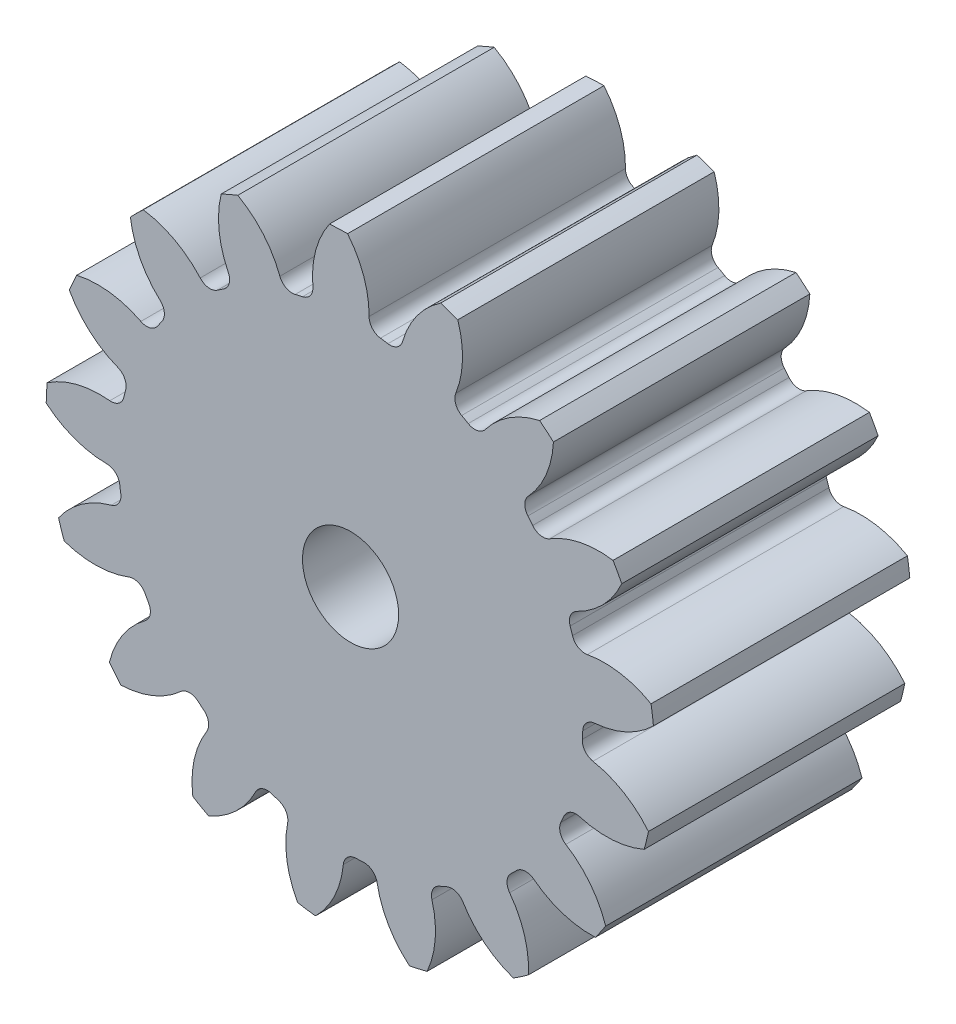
ISO-10303-21;
HEADER;
FILE_DESCRIPTION(('STEP AP214'),'2;1');
FILE_NAME('part.step','',(''),(''),'','','');
FILE_SCHEMA(('AUTOMOTIVE_DESIGN { 1 0 10303 214 1 1 1 1 }'));
ENDSEC;
DATA;
#1=APPLICATION_CONTEXT('core data for automotive mechanical design processes');
#2=APPLICATION_PROTOCOL_DEFINITION('international standard','automotive_design',2000,#1);
#3=PRODUCT_CONTEXT('',#1,'mechanical');
#4=PRODUCT('Part','Part','',(#3));
#5=PRODUCT_RELATED_PRODUCT_CATEGORY('part','',(#4));
#6=PRODUCT_DEFINITION_FORMATION('','',#4);
#7=PRODUCT_DEFINITION_CONTEXT('part definition',#1,'design');
#8=PRODUCT_DEFINITION('design','',#6,#7);
#9=PRODUCT_DEFINITION_SHAPE('','',#8);
#10=(LENGTH_UNIT() NAMED_UNIT(*) SI_UNIT(.MILLI.,.METRE.));
#11=(NAMED_UNIT(*) PLANE_ANGLE_UNIT() SI_UNIT($,.RADIAN.));
#12=(NAMED_UNIT(*) SI_UNIT($,.STERADIAN.) SOLID_ANGLE_UNIT());
#13=UNCERTAINTY_MEASURE_WITH_UNIT(LENGTH_MEASURE(1.E-05),#10,'distance_accuracy_value','');
#14=(GEOMETRIC_REPRESENTATION_CONTEXT(3) GLOBAL_UNCERTAINTY_ASSIGNED_CONTEXT((#13)) GLOBAL_UNIT_ASSIGNED_CONTEXT((#10,
#11,#12)) REPRESENTATION_CONTEXT('',''));
#15=CARTESIAN_POINT('',(0.,0.,0.));
#16=DIRECTION('',(0.,0.,1.));
#17=DIRECTION('',(1.,0.,0.));
#18=AXIS2_PLACEMENT_3D('',#15,#16,#17);
#19=CARTESIAN_POINT('',(0.,0.,101.6));
#20=DIRECTION('',(0.,0.,-1.));
#21=DIRECTION('',(-1.,0.,0.));
#22=AXIS2_PLACEMENT_3D('',#19,#20,#21);
#23=CYLINDRICAL_SURFACE('',#22,120.65);
#24=DIRECTION('',(0.,0.,-1.));
#25=VECTOR('',#24,1.);
#26=CARTESIAN_POINT('',(119.07557887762,19.4275323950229,50.8));
#27=LINE('',#26,#25);
#28=CARTESIAN_POINT('',(119.07557887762,19.4275323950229,101.6));
#29=VERTEX_POINT('',#28);
#30=CARTESIAN_POINT('',(119.07557887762,19.4275323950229,0.));
#31=VERTEX_POINT('',#30);
#32=EDGE_CURVE('E708',#29,#31,#27,.T.);
#33=ORIENTED_EDGE('',*,*,#32,.F.);
#34=CARTESIAN_POINT('',(0.,0.,101.6));
#35=DIRECTION('',(0.,0.,1.));
#36=DIRECTION('',(1.,0.,0.));
#37=AXIS2_PLACEMENT_3D('',#34,#35,#36);
#38=CIRCLE('',#37,120.65);
#39=CARTESIAN_POINT('',(120.020897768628,12.3047388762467,101.6));
#40=VERTEX_POINT('',#39);
#41=EDGE_CURVE('E1315',#40,#29,#38,.T.);
#42=ORIENTED_EDGE('',*,*,#41,.F.);
#43=DIRECTION('',(0.,0.,-1.));
#44=VECTOR('',#43,1.);
#45=CARTESIAN_POINT('',(120.020897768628,12.3047388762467,50.8));
#46=LINE('',#45,#44);
#47=CARTESIAN_POINT('',(120.020897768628,12.3047388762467,0.));
#48=VERTEX_POINT('',#47);
#49=EDGE_CURVE('E1309',#48,#40,#46,.F.);
#50=ORIENTED_EDGE('',*,*,#49,.F.);
#51=CARTESIAN_POINT('',(0.,0.,0.));
#52=DIRECTION('',(0.,0.,1.));
#53=DIRECTION('',(1.,0.,0.));
#54=AXIS2_PLACEMENT_3D('',#51,#52,#53);
#55=CIRCLE('',#54,120.65);
#56=EDGE_CURVE('E1320',#48,#31,#55,.T.);
#57=ORIENTED_EDGE('',*,*,#56,.T.);
#58=EDGE_LOOP('',(#33,#42,#50,#57));
#59=FACE_BOUND('',#58,.T.);
#60=ADVANCED_FACE('F33',(#59),#23,.T.);
#61=DIRECTION('',(0.,0.,-1.));
#62=VECTOR('',#61,1.);
#63=CARTESIAN_POINT('',(107.471169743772,54.8303763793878,50.8));
#64=LINE('',#63,#62);
#65=CARTESIAN_POINT('',(107.471169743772,54.8303763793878,0.));
#66=VERTEX_POINT('',#65);
#67=CARTESIAN_POINT('',(107.471169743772,54.8303763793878,101.6));
#68=VERTEX_POINT('',#67);
#69=EDGE_CURVE('E679',#66,#68,#64,.F.);
#70=ORIENTED_EDGE('',*,*,#69,.F.);
#71=CARTESIAN_POINT('',(104.016636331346,61.1306949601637,0.));
#72=VERTEX_POINT('',#71);
#73=EDGE_CURVE('E1323',#66,#72,#55,.T.);
#74=ORIENTED_EDGE('',*,*,#73,.T.);
#75=DIRECTION('',(0.,0.,-1.));
#76=VECTOR('',#75,1.);
#77=CARTESIAN_POINT('',(104.016636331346,61.1306949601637,50.8));
#78=LINE('',#77,#76);
#79=CARTESIAN_POINT('',(104.016636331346,61.1306949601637,101.6));
#80=VERTEX_POINT('',#79);
#81=EDGE_CURVE('E741',#80,#72,#78,.T.);
#82=ORIENTED_EDGE('',*,*,#81,.F.);
#83=EDGE_CURVE('E1318',#68,#80,#38,.T.);
#84=ORIENTED_EDGE('',*,*,#83,.F.);
#85=EDGE_LOOP('',(#70,#74,#82,#84));
#86=FACE_BOUND('',#85,.T.);
#87=ADVANCED_FACE('F1516',(#86),#23,.T.);
#88=CARTESIAN_POINT('',(0.,0.,101.6));
#89=DIRECTION('',(0.,0.,1.));
#90=DIRECTION('',(1.,0.,0.));
#91=AXIS2_PLACEMENT_3D('',#88,#89,#90);
#92=PLANE('',#91);
#93=CARTESIAN_POINT('',(0.,0.,101.599999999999));
#94=DIRECTION('',(0.,0.,1.));
#95=DIRECTION('',(1.,0.,0.));
#96=AXIS2_PLACEMENT_3D('',#93,#94,#95);
#97=CIRCLE('',#96,19.05);
#98=CARTESIAN_POINT('',(19.05,0.,101.599999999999));
#99=VERTEX_POINT('',#98);
#100=EDGE_CURVE('E696',#99,#99,#97,.T.);
#101=ORIENTED_EDGE('',*,*,#100,.F.);
#102=EDGE_LOOP('',(#101));
#103=FACE_BOUND('',#102,.T.);
#104=ORIENTED_EDGE('',*,*,#41,.T.);
#105=CARTESIAN_POINT('',(100.599482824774,-13.0299967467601,101.6));
#106=DIRECTION('',(0.,0.,-1.));
#107=DIRECTION('',(0.932472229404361,0.361241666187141,0.));
#108=AXIS2_PLACEMENT_3D('',#105,#106,#107);
#109=CIRCLE('',#108,37.3477887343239);
#110=CARTESIAN_POINT('',(93.8247081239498,23.6981906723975,101.6));
#111=VERTEX_POINT('',#110);
#112=EDGE_CURVE('E688',#111,#29,#109,.T.);
#113=ORIENTED_EDGE('',*,*,#112,.F.);
#114=CARTESIAN_POINT('',(92.8870854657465,28.78133841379,101.6));
#115=DIRECTION('',(0.,0.,1.));
#116=DIRECTION('',(-0.932472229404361,-0.361241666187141,0.));
#117=AXIS2_PLACEMENT_3D('',#114,#115,#116);
#118=CIRCLE('',#117,5.16890000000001);
#119=CARTESIAN_POINT('',(87.9497674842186,27.2514958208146,101.6));
#120=VERTEX_POINT('',#119);
#121=EDGE_CURVE('E686',#120,#111,#118,.T.);
#122=ORIENTED_EDGE('',*,*,#121,.F.);
#123=CARTESIAN_POINT('',(0.,0.,101.6));
#124=DIRECTION('',(0.,0.,-1.));
#125=DIRECTION('',(0.932472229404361,0.361241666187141,0.));
#126=AXIS2_PLACEMENT_3D('',#123,#124,#125);
#127=CIRCLE('',#126,92.075);
#128=CARTESIAN_POINT('',(87.0163369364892,30.0992147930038,101.6));
#129=VERTEX_POINT('',#128);
#130=EDGE_CURVE('E671',#129,#120,#127,.T.);
#131=ORIENTED_EDGE('',*,*,#130,.F.);
#132=CARTESIAN_POINT('',(91.9012540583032,31.7889224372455,101.6));
#133=DIRECTION('',(0.,0.,1.));
#134=DIRECTION('',(-0.932472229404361,-0.361241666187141,0.));
#135=AXIS2_PLACEMENT_3D('',#132,#133,#134);
#136=CIRCLE('',#135,5.1689);
#137=CARTESIAN_POINT('',(89.6479118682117,36.4408012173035,101.6));
#138=VERTEX_POINT('',#137);
#139=EDGE_CURVE('E663',#138,#129,#136,.T.);
#140=ORIENTED_EDGE('',*,*,#139,.F.);
#141=CARTESIAN_POINT('',(73.3664306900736,70.0528629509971,101.6));
#142=DIRECTION('',(0.,0.,-1.));
#143=DIRECTION('',(-0.932472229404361,-0.361241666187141,0.));
#144=AXIS2_PLACEMENT_3D('',#141,#142,#143);
#145=CIRCLE('',#144,37.3477887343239);
#146=EDGE_CURVE('E693',#68,#138,#145,.T.);
#147=ORIENTED_EDGE('',*,*,#146,.F.);
#148=ORIENTED_EDGE('',*,*,#83,.T.);
#149=CARTESIAN_POINT('',(98.5132017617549,24.1906146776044,101.6));
#150=DIRECTION('',(0.,0.,-1.));
#151=DIRECTION('',(0.739008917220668,0.673695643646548,0.));
#152=AXIS2_PLACEMENT_3D('',#149,#150,#151);
#153=CIRCLE('',#152,37.3477887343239);
#154=CARTESIAN_POINT('',(78.9281608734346,55.991298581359,101.6));
#155=VERTEX_POINT('',#154);
#156=EDGE_CURVE('E717',#155,#80,#153,.T.);
#157=ORIENTED_EDGE('',*,*,#156,.F.);
#158=CARTESIAN_POINT('',(76.2176090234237,60.3924843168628,101.6));
#159=DIRECTION('',(0.,0.,1.));
#160=DIRECTION('',(-0.739008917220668,-0.673695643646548,0.));
#161=AXIS2_PLACEMENT_3D('',#158,#159,#160);
#162=CIRCLE('',#161,5.16890000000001);
#163=CARTESIAN_POINT('',(72.1663400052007,57.1823836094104,101.6));
#164=VERTEX_POINT('',#163);
#165=EDGE_CURVE('E715',#164,#155,#162,.T.);
#166=ORIENTED_EDGE('',*,*,#165,.F.);
#167=CARTESIAN_POINT('',(0.,0.,101.6));
#168=DIRECTION('',(0.,0.,-1.));
#169=DIRECTION('',(0.739008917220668,0.673695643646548,0.));
#170=AXIS2_PLACEMENT_3D('',#167,#168,#169);
#171=CIRCLE('',#170,92.075);
#172=CARTESIAN_POINT('',(70.267227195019,59.500608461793,101.6));
#173=VERTEX_POINT('',#172);
#174=EDGE_CURVE('E712',#173,#164,#171,.T.);
#175=ORIENTED_EDGE('',*,*,#174,.F.);
#176=CARTESIAN_POINT('',(74.2118839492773,62.8408495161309,101.6));
#177=DIRECTION('',(0.,0.,1.));
#178=DIRECTION('',(-0.739008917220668,-0.673695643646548,0.));
#179=AXIS2_PLACEMENT_3D('',#176,#177,#178);
#180=CIRCLE('',#179,5.1689);
#181=CARTESIAN_POINT('',(70.4302524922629,66.3645962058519,101.6));
#182=VERTEX_POINT('',#181);
#183=EDGE_CURVE('E710',#182,#173,#180,.T.);
#184=ORIENTED_EDGE('',*,*,#183,.F.);
#185=CARTESIAN_POINT('',(43.1061462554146,91.8253609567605,101.6));
#186=DIRECTION('',(0.,0.,-1.));
#187=DIRECTION('',(-0.739008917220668,-0.673695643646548,0.));
#188=AXIS2_PLACEMENT_3D('',#185,#186,#187);
#189=CIRCLE('',#188,37.3477887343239);
#190=CARTESIAN_POINT('',(80.4068647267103,89.9508677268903,101.6));
#191=VERTEX_POINT('',#190);
#192=EDGE_CURVE('E720',#191,#182,#189,.T.);
#193=ORIENTED_EDGE('',*,*,#192,.F.);
#194=CARTESIAN_POINT('',(74.9096706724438,94.57781843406,101.6));
#195=VERTEX_POINT('',#194);
#196=EDGE_CURVE('E1365',#191,#195,#38,.T.);
#197=ORIENTED_EDGE('',*,*,#196,.T.);
#198=CARTESIAN_POINT('',(83.1221669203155,58.1441495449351,101.6));
#199=DIRECTION('',(0.,0.,-1.));
#200=DIRECTION('',(0.445738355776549,0.895163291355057,0.));
#201=AXIS2_PLACEMENT_3D('',#198,#199,#200);
#202=CIRCLE('',#201,37.3477887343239);
#203=CARTESIAN_POINT('',(53.3719281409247,80.722471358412,101.6));
#204=VERTEX_POINT('',#203);
#205=EDGE_CURVE('E752',#204,#195,#202,.T.);
#206=ORIENTED_EDGE('',*,*,#205,.F.);
#207=CARTESIAN_POINT('',(49.2545221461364,83.8472905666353,101.6));
#208=DIRECTION('',(0.,0.,1.));
#209=DIRECTION('',(-0.445738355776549,-0.895163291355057,0.));
#210=AXIS2_PLACEMENT_3D('',#207,#208,#209);
#211=CIRCLE('',#210,5.16890000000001);
#212=CARTESIAN_POINT('',(46.6364484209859,79.3904736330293,101.6));
#213=VERTEX_POINT('',#212);
#214=EDGE_CURVE('E750',#213,#204,#211,.T.);
#215=ORIENTED_EDGE('',*,*,#214,.F.);
#216=CARTESIAN_POINT('',(0.,0.,101.6));
#217=DIRECTION('',(0.,0.,-1.));
#218=DIRECTION('',(0.445738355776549,0.895163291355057,0.));
#219=AXIS2_PLACEMENT_3D('',#216,#217,#218);
#220=CIRCLE('',#219,92.075);
#221=CARTESIAN_POINT('',(44.0281390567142,80.8661152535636,101.6));
#222=VERTEX_POINT('',#221);
#223=EDGE_CURVE('E747',#222,#213,#220,.T.);
#224=ORIENTED_EDGE('',*,*,#223,.F.);
#225=CARTESIAN_POINT('',(46.4997876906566,85.4057716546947,101.6));
#226=DIRECTION('',(0.,0.,1.));
#227=DIRECTION('',(-0.445738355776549,-0.895163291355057,0.));
#228=AXIS2_PLACEMENT_3D('',#225,#226,#227);
#229=CIRCLE('',#228,5.1689);
#230=CARTESIAN_POINT('',(41.7005972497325,87.3254847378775,101.6));
#231=VERTEX_POINT('',#230);
#232=EDGE_CURVE('E745',#231,#222,#229,.T.);
#233=ORIENTED_EDGE('',*,*,#232,.F.);
#234=CARTESIAN_POINT('',(7.02413790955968,101.196335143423,101.6));
#235=DIRECTION('',(0.,0.,-1.));
#236=DIRECTION('',(-0.445738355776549,-0.895163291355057,0.));
#237=AXIS2_PLACEMENT_3D('',#234,#235,#236);
#238=CIRCLE('',#237,37.3477887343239);
#239=CARTESIAN_POINT('',(42.4831670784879,112.922995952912,101.6));
#240=VERTEX_POINT('',#239);
#241=EDGE_CURVE('E755',#240,#231,#238,.T.);
#242=ORIENTED_EDGE('',*,*,#241,.F.);
#243=CARTESIAN_POINT('',(35.6857389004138,115.251683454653,101.6));
#244=VERTEX_POINT('',#243);
#245=EDGE_CURVE('E1498',#240,#244,#38,.T.);
#246=ORIENTED_EDGE('',*,*,#245,.T.);
#247=CARTESIAN_POINT('',(56.5050228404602,84.2449948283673,101.6));
#248=DIRECTION('',(0.,0.,-1.));
#249=DIRECTION('',(0.092268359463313,0.995734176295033,0.));
#250=AXIS2_PLACEMENT_3D('',#247,#248,#249);
#251=CIRCLE('',#250,37.3477887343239);
#252=CARTESIAN_POINT('',(20.6075207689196,94.5516270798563,101.6));
#253=VERTEX_POINT('',#252);
#254=EDGE_CURVE('E790',#253,#244,#251,.T.);
#255=ORIENTED_EDGE('',*,*,#254,.F.);
#256=CARTESIAN_POINT('',(15.6393391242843,95.9780556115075,101.6));
#257=DIRECTION('',(0.,0.,1.));
#258=DIRECTION('',(-0.092268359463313,-0.995734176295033,0.));
#259=AXIS2_PLACEMENT_3D('',#256,#257,#258);
#260=CIRCLE('',#259,5.16890000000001);
#261=CARTESIAN_POINT('',(14.8080460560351,90.8764402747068,101.6));
#262=VERTEX_POINT('',#261);
#263=EDGE_CURVE('E788',#262,#253,#260,.T.);
#264=ORIENTED_EDGE('',*,*,#263,.F.);
#265=CARTESIAN_POINT('',(0.,0.,101.6));
#266=DIRECTION('',(0.,0.,-1.));
#267=DIRECTION('',(0.092268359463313,0.995734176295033,0.));
#268=AXIS2_PLACEMENT_3D('',#265,#266,#267);
#269=CIRCLE('',#268,92.075);
#270=CARTESIAN_POINT('',(11.8428067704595,91.3102050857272,101.6));
#271=VERTEX_POINT('',#270);
#272=EDGE_CURVE('E785',#271,#262,#269,.T.);
#273=ORIENTED_EDGE('',*,*,#272,.F.);
#274=CARTESIAN_POINT('',(12.5076374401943,96.4361710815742,101.6));
#275=DIRECTION('',(0.,0.,1.));
#276=DIRECTION('',(-0.092268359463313,-0.995734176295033,0.));
#277=AXIS2_PLACEMENT_3D('',#274,#275,#276);
#278=CIRCLE('',#277,5.1689);
#279=CARTESIAN_POINT('',(7.33904527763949,96.4925826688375,101.6));
#280=VERTEX_POINT('',#279);
#281=EDGE_CURVE('E783',#280,#271,#278,.T.);
#282=ORIENTED_EDGE('',*,*,#281,.F.);
#283=CARTESIAN_POINT('',(-30.0065191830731,96.9001835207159,101.6));
#284=DIRECTION('',(0.,0.,-1.));
#285=DIRECTION('',(-0.092268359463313,-0.995734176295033,0.));
#286=AXIS2_PLACEMENT_3D('',#283,#284,#285);
#287=CIRCLE('',#286,37.3477887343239);
#288=CARTESIAN_POINT('',(-1.17811769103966,120.644247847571,101.6));
#289=VERTEX_POINT('',#288);
#290=EDGE_CURVE('E793',#289,#280,#287,.T.);
#291=ORIENTED_EDGE('',*,*,#290,.F.);
#292=CARTESIAN_POINT('',(-8.35774965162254,120.36016999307,101.6));
#293=VERTEX_POINT('',#292);
#294=EDGE_CURVE('E1494',#289,#293,#38,.T.);
#295=ORIENTED_EDGE('',*,*,#294,.T.);
#296=CARTESIAN_POINT('',(22.2565623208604,98.9680867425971,101.6));
#297=DIRECTION('',(0.,0.,-1.));
#298=DIRECTION('',(-0.273662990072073,0.961825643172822,0.));
#299=AXIS2_PLACEMENT_3D('',#296,#297,#298);
#300=CIRCLE('',#299,37.3477887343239);
#301=CARTESIAN_POINT('',(-14.9400464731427,95.6110616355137,101.6));
#302=VERTEX_POINT('',#301);
#303=EDGE_CURVE('E828',#302,#293,#300,.T.);
#304=ORIENTED_EDGE('',*,*,#303,.F.);
#305=CARTESIAN_POINT('',(-20.0880233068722,95.1464524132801,101.6));
#306=DIRECTION('',(0.,0.,1.));
#307=DIRECTION('',(0.273662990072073,-0.961825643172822,0.));
#308=AXIS2_PLACEMENT_3D('',#305,#306,#307);
#309=CIRCLE('',#308,5.16890000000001);
#310=CARTESIAN_POINT('',(-19.020264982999,90.0890400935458,101.6));
#311=VERTEX_POINT('',#310);
#312=EDGE_CURVE('E826',#311,#302,#309,.T.);
#313=ORIENTED_EDGE('',*,*,#312,.F.);
#314=CARTESIAN_POINT('',(0.,0.,101.6));
#315=DIRECTION('',(0.,0.,-1.));
#316=DIRECTION('',(-0.273662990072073,0.961825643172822,0.));
#317=AXIS2_PLACEMENT_3D('',#314,#315,#316);
#318=CIRCLE('',#317,92.075);
#319=CARTESIAN_POINT('',(-21.9419621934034,89.4223457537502,101.6));
#320=VERTEX_POINT('',#319);
#321=EDGE_CURVE('E823',#320,#311,#318,.T.);
#322=ORIENTED_EDGE('',*,*,#321,.F.);
#323=CARTESIAN_POINT('',(-23.173738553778,94.442331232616,101.6));
#324=DIRECTION('',(0.,0.,1.));
#325=DIRECTION('',(0.273662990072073,-0.961825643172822,0.));
#326=AXIS2_PLACEMENT_3D('',#323,#324,#325);
#327=CIRCLE('',#326,5.1689);
#328=CARTESIAN_POINT('',(-28.0136854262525,92.6278226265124,101.6));
#329=VERTEX_POINT('',#328);
#330=EDGE_CURVE('E821',#329,#320,#327,.T.);
#331=ORIENTED_EDGE('',*,*,#330,.F.);
#332=CARTESIAN_POINT('',(-62.9846295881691,79.5171251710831,101.6));
#333=DIRECTION('',(0.,0.,-1.));
#334=DIRECTION('',(0.273662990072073,-0.961825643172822,0.));
#335=AXIS2_PLACEMENT_3D('',#332,#333,#334);
#336=CIRCLE('',#335,37.3477887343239);
#337=CARTESIAN_POINT('',(-44.6802911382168,112.07182555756,101.6));
#338=VERTEX_POINT('',#337);
#339=EDGE_CURVE('E831',#338,#329,#336,.T.);
#340=ORIENTED_EDGE('',*,*,#339,.F.);
#341=CARTESIAN_POINT('',(-51.2724778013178,109.213348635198,101.6));
#342=VERTEX_POINT('',#341);
#343=EDGE_CURVE('E1490',#338,#342,#38,.T.);
#344=ORIENTED_EDGE('',*,*,#343,.T.);
#345=CARTESIAN_POINT('',(-14.997770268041,100.324990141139,101.6));
#346=DIRECTION('',(0.,0.,-1.));
#347=DIRECTION('',(-0.602634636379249,0.798017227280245,0.));
#348=AXIS2_PLACEMENT_3D('',#345,#346,#347);
#349=CIRCLE('',#348,37.3477887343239);
#350=CARTESIAN_POINT('',(-48.4698776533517,83.7576925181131,101.6));
#351=VERTEX_POINT('',#350);
#352=EDGE_CURVE('E866',#351,#342,#349,.T.);
#353=ORIENTED_EDGE('',*,*,#352,.F.);
#354=CARTESIAN_POINT('',(-53.1023868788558,81.4647935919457,101.6));
#355=DIRECTION('',(0.,0.,1.));
#356=DIRECTION('',(0.602634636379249,-0.798017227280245,0.));
#357=AXIS2_PLACEMENT_3D('',#354,#355,#356);
#358=CIRCLE('',#357,5.16890000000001);
#359=CARTESIAN_POINT('',(-50.2797838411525,77.1346158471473,101.6));
#360=VERTEX_POINT('',#359);
#361=EDGE_CURVE('E864',#360,#351,#358,.T.);
#362=ORIENTED_EDGE('',*,*,#361,.F.);
#363=CARTESIAN_POINT('',(0.,0.,101.6));
#364=DIRECTION('',(0.,0.,-1.));
#365=DIRECTION('',(-0.602634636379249,0.798017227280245,0.));
#366=AXIS2_PLACEMENT_3D('',#363,#364,#365);
#367=CIRCLE('',#366,92.075);
#368=CARTESIAN_POINT('',(-52.7633475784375,75.4575031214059,101.6));
#369=VERTEX_POINT('',#368);
#370=EDGE_CURVE('E861',#369,#360,#367,.T.);
#371=ORIENTED_EDGE('',*,*,#370,.F.);
#372=CARTESIAN_POINT('',(-55.7253727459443,79.6935312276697,101.6));
#373=DIRECTION('',(0.,0.,1.));
#374=DIRECTION('',(0.602634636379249,-0.798017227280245,0.));
#375=AXIS2_PLACEMENT_3D('',#372,#373,#374);
#376=CIRCLE('',#375,5.1689);
#377=CARTESIAN_POINT('',(-59.5830126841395,76.2531618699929,101.6));
#378=VERTEX_POINT('',#377);
#379=EDGE_CURVE('E859',#378,#369,#376,.T.);
#380=ORIENTED_EDGE('',*,*,#379,.F.);
#381=CARTESIAN_POINT('',(-87.4563167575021,51.3948384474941,101.6));
#382=DIRECTION('',(0.,0.,-1.));
#383=DIRECTION('',(0.602634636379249,-0.798017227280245,0.));
#384=AXIS2_PLACEMENT_3D('',#381,#382,#383);
#385=CIRCLE('',#384,37.3477887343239);
#386=CARTESIAN_POINT('',(-82.1481436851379,88.3634822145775,101.6));
#387=VERTEX_POINT('',#386);
#388=EDGE_CURVE('E869',#387,#378,#385,.T.);
#389=ORIENTED_EDGE('',*,*,#388,.F.);
#390=CARTESIAN_POINT('',(-87.2625737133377,83.3166593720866,101.6));
#391=VERTEX_POINT('',#390);
#392=EDGE_CURVE('E1486',#387,#391,#38,.T.);
#393=ORIENTED_EDGE('',*,*,#392,.T.);
#394=CARTESIAN_POINT('',(-50.2265708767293,88.1324477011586,101.6));
#395=DIRECTION('',(0.,0.,-1.));
#396=DIRECTION('',(-0.85021713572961,0.526432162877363,0.));
#397=AXIS2_PLACEMENT_3D('',#394,#395,#396);
#398=CIRCLE('',#397,37.3477887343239);
#399=CARTESIAN_POINT('',(-75.4535832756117,60.5923829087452,101.6));
#400=VERTEX_POINT('',#399);
#401=EDGE_CURVE('E904',#400,#391,#398,.T.);
#402=ORIENTED_EDGE('',*,*,#401,.F.);
#403=CARTESIAN_POINT('',(-78.9449788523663,56.7808629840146,101.6));
#404=DIRECTION('',(0.,0.,1.));
#405=DIRECTION('',(0.85021713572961,-0.526432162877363,0.));
#406=AXIS2_PLACEMENT_3D('',#403,#404,#405);
#407=CIRCLE('',#406,5.16890000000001);
#408=CARTESIAN_POINT('',(-74.7487392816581,53.7627343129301,101.6));
#409=VERTEX_POINT('',#408);
#410=EDGE_CURVE('E902',#409,#400,#407,.T.);
#411=ORIENTED_EDGE('',*,*,#410,.F.);
#412=CARTESIAN_POINT('',(0.,0.,101.6));
#413=DIRECTION('',(0.,0.,-1.));
#414=DIRECTION('',(-0.85021713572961,0.526432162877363,0.));
#415=AXIS2_PLACEMENT_3D('',#412,#413,#414);
#416=CIRCLE('',#415,92.075);
#417=CARTESIAN_POINT('',(-76.4587505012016,51.3017065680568,101.6));
#418=VERTEX_POINT('',#417);
#419=EDGE_CURVE('E899',#418,#409,#416,.T.);
#420=ORIENTED_EDGE('',*,*,#419,.F.);
#421=CARTESIAN_POINT('',(-80.7509865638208,54.1816782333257,101.6));
#422=DIRECTION('',(0.,0.,1.));
#423=DIRECTION('',(0.85021713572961,-0.526432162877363,0.));
#424=AXIS2_PLACEMENT_3D('',#421,#422,#423);
#425=CIRCLE('',#424,5.1689);
#426=CARTESIAN_POINT('',(-83.1053239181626,49.5800890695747,101.6));
#427=VERTEX_POINT('',#426);
#428=EDGE_CURVE('E897',#427,#418,#425,.T.);
#429=ORIENTED_EDGE('',*,*,#428,.F.);
#430=CARTESIAN_POINT('',(-100.116543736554,16.3313940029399,101.6));
#431=DIRECTION('',(0.,0.,-1.));
#432=DIRECTION('',(0.85021713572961,-0.526432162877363,0.));
#433=AXIS2_PLACEMENT_3D('',#430,#431,#432);
#434=CIRCLE('',#433,37.3477887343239);
#435=CARTESIAN_POINT('',(-108.521434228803,52.7211609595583,101.6));
#436=VERTEX_POINT('',#435);
#437=EDGE_CURVE('E907',#436,#427,#434,.T.);
#438=ORIENTED_EDGE('',*,*,#437,.F.);
#439=CARTESIAN_POINT('',(-111.467375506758,46.1675935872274,101.6));
#440=VERTEX_POINT('',#439);
#441=EDGE_CURVE('E1482',#436,#440,#38,.T.);
#442=ORIENTED_EDGE('',*,*,#441,.T.);
#443=CARTESIAN_POINT('',(-78.6719947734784,64.0371298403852,101.6));
#444=DIRECTION('',(0.,0.,-1.));
#445=DIRECTION('',(-0.9829730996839,0.183749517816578,0.));
#446=AXIS2_PLACEMENT_3D('',#443,#444,#445);
#447=CIRCLE('',#446,37.3477887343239);
#448=CARTESIAN_POINT('',(-92.246864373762,29.2437362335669,101.6));
#449=VERTEX_POINT('',#448);
#450=EDGE_CURVE('E942',#449,#440,#447,.T.);
#451=ORIENTED_EDGE('',*,*,#450,.F.);
#452=CARTESIAN_POINT('',(-94.1256139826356,24.4283621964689,101.6));
#453=DIRECTION('',(0.,0.,1.));
#454=DIRECTION('',(0.9829730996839,-0.183749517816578,0.));
#455=AXIS2_PLACEMENT_3D('',#452,#453,#454);
#456=CIRCLE('',#455,5.16890000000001);
#457=CARTESIAN_POINT('',(-89.1224632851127,23.1298976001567,101.6));
#458=VERTEX_POINT('',#457);
#459=EDGE_CURVE('E940',#458,#449,#456,.T.);
#460=ORIENTED_EDGE('',*,*,#459,.F.);
#461=CARTESIAN_POINT('',(0.,0.,101.6));
#462=DIRECTION('',(0.,0.,-1.));
#463=DIRECTION('',(-0.9829730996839,0.183749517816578,0.));
#464=AXIS2_PLACEMENT_3D('',#461,#462,#463);
#465=CIRCLE('',#464,92.075);
#466=CARTESIAN_POINT('',(-89.8279754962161,20.2173302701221,101.6));
#467=VERTEX_POINT('',#466);
#468=EDGE_CURVE('E937',#467,#458,#465,.T.);
#469=ORIENTED_EDGE('',*,*,#468,.F.);
#470=CARTESIAN_POINT('',(-94.8707321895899,21.3522893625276,101.6));
#471=DIRECTION('',(0.,0.,1.));
#472=DIRECTION('',(0.9829730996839,-0.183749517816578,0.));
#473=AXIS2_PLACEMENT_3D('',#470,#471,#472);
#474=CIRCLE('',#473,5.1689);
#475=CARTESIAN_POINT('',(-95.4038006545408,16.2109505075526,101.6));
#476=VERTEX_POINT('',#475);
#477=EDGE_CURVE('E935',#476,#467,#474,.T.);
#478=ORIENTED_EDGE('',*,*,#477,.F.);
#479=CARTESIAN_POINT('',(-99.2554767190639,-20.9376956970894,101.6));
#480=DIRECTION('',(0.,0.,-1.));
#481=DIRECTION('',(0.9829730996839,-0.183749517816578,0.));
#482=AXIS2_PLACEMENT_3D('',#479,#480,#481);
#483=CIRCLE('',#482,37.3477887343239);
#484=CARTESIAN_POINT('',(-120.238303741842,9.95855477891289,101.6));
#485=VERTEX_POINT('',#484);
#486=EDGE_CURVE('E945',#485,#476,#483,.T.);
#487=ORIENTED_EDGE('',*,*,#486,.F.);
#488=CARTESIAN_POINT('',(-120.61789057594,2.78333846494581,101.6));
#489=VERTEX_POINT('',#488);
#490=EDGE_CURVE('E1478',#485,#489,#38,.T.);
#491=ORIENTED_EDGE('',*,*,#490,.T.);
#492=CARTESIAN_POINT('',(-96.492329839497,31.2932427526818,101.6));
#493=DIRECTION('',(0.,0.,-1.));
#494=DIRECTION('',(-0.982973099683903,-0.183749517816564,0.));
#495=AXIS2_PLACEMENT_3D('',#492,#493,#494);
#496=CIRCLE('',#495,37.3477887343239);
#497=CARTESIAN_POINT('',(-96.5816952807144,-6.05443906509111,101.6));
#498=VERTEX_POINT('',#497);
#499=EDGE_CURVE('E980',#498,#489,#496,.T.);
#500=ORIENTED_EDGE('',*,*,#499,.F.);
#501=CARTESIAN_POINT('',(-96.5940633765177,-11.2233242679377,101.6));
#502=DIRECTION('',(0.,0.,1.));
#503=DIRECTION('',(0.982973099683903,0.183749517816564,0.));
#504=AXIS2_PLACEMENT_3D('',#501,#502,#503);
#505=CIRCLE('',#504,5.16890000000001);
#506=CARTESIAN_POINT('',(-91.4597047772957,-10.626759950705,101.6));
#507=VERTEX_POINT('',#506);
#508=EDGE_CURVE('E978',#507,#498,#505,.T.);
#509=ORIENTED_EDGE('',*,*,#508,.F.);
#510=CARTESIAN_POINT('',(0.,0.,101.6));
#511=DIRECTION('',(0.,0.,-1.));
#512=DIRECTION('',(-0.982973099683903,-0.183749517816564,0.));
#513=AXIS2_PLACEMENT_3D('',#510,#511,#512);
#514=CIRCLE('',#513,92.075);
#515=CARTESIAN_POINT('',(-91.0654346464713,-13.597508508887,101.6));
#516=VERTEX_POINT('',#515);
#517=EDGE_CURVE('E975',#516,#507,#514,.T.);
#518=ORIENTED_EDGE('',*,*,#517,.F.);
#519=CARTESIAN_POINT('',(-96.1776597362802,-14.3608445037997,101.6));
#520=DIRECTION('',(0.,0.,1.));
#521=DIRECTION('',(0.982973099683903,0.183749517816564,0.));
#522=AXIS2_PLACEMENT_3D('',#519,#520,#521);
#523=CIRCLE('',#522,5.1689);
#524=CARTESIAN_POINT('',(-94.8174654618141,-19.3475667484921,101.6));
#525=VERTEX_POINT('',#524);
#526=EDGE_CURVE('E973',#525,#516,#523,.T.);
#527=ORIENTED_EDGE('',*,*,#526,.F.);
#528=CARTESIAN_POINT('',(-84.9894075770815,-55.3790335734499,101.6));
#529=DIRECTION('',(0.,0.,-1.));
#530=DIRECTION('',(0.982973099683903,0.183749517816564,0.));
#531=AXIS2_PLACEMENT_3D('',#528,#529,#530);
#532=CIRCLE('',#531,37.3477887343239);
#533=CARTESIAN_POINT('',(-115.716324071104,-34.1490094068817,101.6));
#534=VERTEX_POINT('',#533);
#535=EDGE_CURVE('E983',#534,#525,#532,.T.);
#536=ORIENTED_EDGE('',*,*,#535,.F.);
#537=CARTESIAN_POINT('',(-113.478291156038,-40.9768219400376,101.6));
#538=VERTEX_POINT('',#537);
#539=EDGE_CURVE('E1474',#534,#538,#38,.T.);
#540=ORIENTED_EDGE('',*,*,#539,.T.);
#541=CARTESIAN_POINT('',(-101.280841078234,-5.67697017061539,101.6));
#542=DIRECTION('',(0.,0.,-1.));
#543=DIRECTION('',(-0.850217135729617,-0.526432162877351,0.));
#544=AXIS2_PLACEMENT_3D('',#541,#542,#543);
#545=CIRCLE('',#544,37.3477887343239);
#546=CARTESIAN_POINT('',(-87.8726330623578,-40.5349288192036,101.6));
#547=VERTEX_POINT('',#546);
#548=EDGE_CURVE('E1018',#547,#538,#545,.T.);
#549=ORIENTED_EDGE('',*,*,#548,.F.);
#550=CARTESIAN_POINT('',(-86.0169492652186,-45.3592385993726,101.6));
#551=DIRECTION('',(0.,0.,1.));
#552=DIRECTION('',(0.850217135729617,0.526432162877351,0.));
#553=AXIS2_PLACEMENT_3D('',#550,#551,#552);
#554=CIRCLE('',#553,5.16890000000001);
#555=CARTESIAN_POINT('',(-81.4448063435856,-42.9482146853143,101.6));
#556=VERTEX_POINT('',#555);
#557=EDGE_CURVE('E1016',#556,#547,#554,.T.);
#558=ORIENTED_EDGE('',*,*,#557,.F.);
#559=CARTESIAN_POINT('',(0.,0.,101.6));
#560=DIRECTION('',(0.,0.,-1.));
#561=DIRECTION('',(-0.850217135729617,-0.526432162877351,0.));
#562=AXIS2_PLACEMENT_3D('',#559,#560,#561);
#563=CIRCLE('',#562,92.075);
#564=CARTESIAN_POINT('',(-80.0040022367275,-45.5759284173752,101.6));
#565=VERTEX_POINT('',#564);
#566=EDGE_CURVE('E1013',#565,#556,#563,.T.);
#567=ORIENTED_EDGE('',*,*,#566,.F.);
#568=CARTESIAN_POINT('',(-84.4952613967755,-48.1344667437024,101.6));
#569=DIRECTION('',(0.,0.,1.));
#570=DIRECTION('',(0.850217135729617,0.526432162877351,0.));
#571=AXIS2_PLACEMENT_3D('',#568,#569,#570);
#572=CIRCLE('',#571,5.1689);
#573=CARTESIAN_POINT('',(-81.4255061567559,-52.2930879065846,101.6));
#574=VERTEX_POINT('',#573);
#575=EDGE_CURVE('E1011',#574,#565,#572,.T.);
#576=ORIENTED_EDGE('',*,*,#575,.F.);
#577=CARTESIAN_POINT('',(-59.2450479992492,-82.3411260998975,101.6));
#578=DIRECTION('',(0.,0.,-1.));
#579=DIRECTION('',(0.850217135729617,0.526432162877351,0.));
#580=AXIS2_PLACEMENT_3D('',#577,#578,#579);
#581=CIRCLE('',#580,37.3477887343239);
#582=CARTESIAN_POINT('',(-95.5662136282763,-73.6445606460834,101.6));
#583=VERTEX_POINT('',#582);
#584=EDGE_CURVE('E1021',#583,#574,#581,.T.);
#585=ORIENTED_EDGE('',*,*,#584,.F.);
#586=CARTESIAN_POINT('',(-91.0128197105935,-79.2028354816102,101.6));
#587=VERTEX_POINT('',#586);
#588=EDGE_CURVE('E1470',#583,#587,#38,.T.);
#589=ORIENTED_EDGE('',*,*,#588,.T.);
#590=CARTESIAN_POINT('',(-92.3908135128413,-41.8804768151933,101.6));
#591=DIRECTION('',(0.,0.,-1.));
#592=DIRECTION('',(-0.602634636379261,-0.798017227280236,0.));
#593=AXIS2_PLACEMENT_3D('',#590,#591,#592);
#594=CIRCLE('',#593,37.3477887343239);
#595=CARTESIAN_POINT('',(-67.2958848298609,-69.5409518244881,101.6));
#596=VERTEX_POINT('',#595);
#597=EDGE_CURVE('E1056',#596,#587,#594,.T.);
#598=ORIENTED_EDGE('',*,*,#597,.F.);
#599=CARTESIAN_POINT('',(-63.8227695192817,-73.3691364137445,101.6));
#600=DIRECTION('',(0.,0.,1.));
#601=DIRECTION('',(0.602634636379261,0.798017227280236,0.));
#602=AXIS2_PLACEMENT_3D('',#599,#600,#601);
#603=CIRCLE('',#602,5.16890000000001);
#604=CARTESIAN_POINT('',(-60.4303355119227,-69.4692750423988,101.6));
#605=VERTEX_POINT('',#604);
#606=EDGE_CURVE('E1054',#605,#596,#603,.T.);
#607=ORIENTED_EDGE('',*,*,#606,.F.);
#608=CARTESIAN_POINT('',(0.,0.,101.6));
#609=DIRECTION('',(0.,0.,-1.));
#610=DIRECTION('',(-0.602634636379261,-0.798017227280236,0.));
#611=AXIS2_PLACEMENT_3D('',#608,#609,#610);
#612=CIRCLE('',#611,92.075);
#613=CARTESIAN_POINT('',(-58.1375860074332,-71.3990666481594,101.6));
#614=VERTEX_POINT('',#613);
#615=EDGE_CURVE('E1051',#614,#605,#612,.T.);
#616=ORIENTED_EDGE('',*,*,#615,.F.);
#617=CARTESIAN_POINT('',(-61.4013098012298,-75.4072625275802,101.6));
#618=DIRECTION('',(0.,0.,1.));
#619=DIRECTION('',(0.602634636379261,0.798017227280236,0.));
#620=AXIS2_PLACEMENT_3D('',#617,#618,#619);
#621=CIRCLE('',#620,5.1689);
#622=CARTESIAN_POINT('',(-57.0365810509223,-78.1761377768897,101.6));
#623=VERTEX_POINT('',#622);
#624=EDGE_CURVE('E1049',#623,#614,#621,.T.);
#625=ORIENTED_EDGE('',*,*,#624,.F.);
#626=CARTESIAN_POINT('',(-25.4993164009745,-98.1825932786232,101.6));
#627=DIRECTION('',(0.,0.,-1.));
#628=DIRECTION('',(0.602634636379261,0.798017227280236,0.));
#629=AXIS2_PLACEMENT_3D('',#626,#627,#628);
#630=CIRCLE('',#629,37.3477887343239);
#631=CARTESIAN_POINT('',(-62.5093564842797,-103.194005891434,101.6));
#632=VERTEX_POINT('',#631);
#633=EDGE_CURVE('E1059',#632,#623,#630,.T.);
#634=ORIENTED_EDGE('',*,*,#633,.F.);
#635=CARTESIAN_POINT('',(-56.2555626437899,-106.732067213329,101.6));
#636=VERTEX_POINT('',#635);
#637=EDGE_CURVE('E1466',#632,#636,#38,.T.);
#638=ORIENTED_EDGE('',*,*,#637,.T.);
#639=CARTESIAN_POINT('',(-71.0228946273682,-72.4277929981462,101.6));
#640=DIRECTION('',(0.,0.,-1.));
#641=DIRECTION('',(-0.273662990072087,-0.961825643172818,0.));
#642=AXIS2_PLACEMENT_3D('',#639,#640,#641);
#643=CIRCLE('',#642,37.3477887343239);
#644=CARTESIAN_POINT('',(-37.6304544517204,-89.1550839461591,101.6));
#645=VERTEX_POINT('',#644);
#646=EDGE_CURVE('E1094',#645,#636,#643,.T.);
#647=ORIENTED_EDGE('',*,*,#646,.F.);
#648=CARTESIAN_POINT('',(-33.0089710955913,-91.4701258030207,101.6));
#649=DIRECTION('',(0.,0.,1.));
#650=DIRECTION('',(0.273662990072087,0.961825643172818,0.));
#651=AXIS2_PLACEMENT_3D('',#648,#649,#650);
#652=CIRCLE('',#651,5.16890000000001);
#653=CARTESIAN_POINT('',(-31.2544130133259,-86.6081248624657,101.6));
#654=VERTEX_POINT('',#653);
#655=EDGE_CURVE('E1092',#654,#645,#652,.T.);
#656=ORIENTED_EDGE('',*,*,#655,.F.);
#657=CARTESIAN_POINT('',(0.,0.,101.6));
#658=DIRECTION('',(0.,0.,-1.));
#659=DIRECTION('',(-0.273662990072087,-0.961825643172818,0.));
#660=AXIS2_PLACEMENT_3D('',#657,#658,#659);
#661=CIRCLE('',#660,92.075);
#662=CARTESIAN_POINT('',(-28.41936663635,-87.5793652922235,101.6));
#663=VERTEX_POINT('',#662);
#664=EDGE_CURVE('E1089',#663,#654,#661,.T.);
#665=ORIENTED_EDGE('',*,*,#664,.F.);
#666=CARTESIAN_POINT('',(-30.0147710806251,-92.4958896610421,101.6));
#667=DIRECTION('',(0.,0.,1.));
#668=DIRECTION('',(0.273662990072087,0.961825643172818,0.));
#669=AXIS2_PLACEMENT_3D('',#666,#667,#668);
#670=CIRCLE('',#669,5.1689);
#671=CARTESIAN_POINT('',(-24.9445496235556,-93.5010670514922,101.6));
#672=VERTEX_POINT('',#671);
#673=EDGE_CURVE('E1087',#672,#663,#670,.T.);
#674=ORIENTED_EDGE('',*,*,#673,.F.);
#675=CARTESIAN_POINT('',(11.6902391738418,-100.76395718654,101.6));
#676=DIRECTION('',(0.,0.,-1.));
#677=DIRECTION('',(0.273662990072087,0.961825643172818,0.));
#678=AXIS2_PLACEMENT_3D('',#675,#676,#677);
#679=CIRCLE('',#678,37.3477887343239);
#680=CARTESIAN_POINT('',(-21.0102643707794,-118.806528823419,101.6));
#681=VERTEX_POINT('',#680);
#682=EDGE_CURVE('E1097',#681,#672,#679,.T.);
#683=ORIENTED_EDGE('',*,*,#682,.F.);
#684=CARTESIAN_POINT('',(-13.9006801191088,-119.846541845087,101.6));
#685=VERTEX_POINT('',#684);
#686=EDGE_CURVE('E1462',#681,#685,#38,.T.);
#687=ORIENTED_EDGE('',*,*,#686,.T.);
#688=CARTESIAN_POINT('',(-40.0629402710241,-93.1933344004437,101.6));
#689=DIRECTION('',(0.,0.,-1.));
#690=DIRECTION('',(0.0922683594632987,-0.995734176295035,0.));
#691=AXIS2_PLACEMENT_3D('',#688,#689,#690);
#692=CIRCLE('',#691,37.3477887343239);
#693=CARTESIAN_POINT('',(-2.88282268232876,-96.7283279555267,101.6));
#694=VERTEX_POINT('',#693);
#695=EDGE_CURVE('E1132',#694,#685,#692,.T.);
#696=ORIENTED_EDGE('',*,*,#695,.F.);
#697=CARTESIAN_POINT('',(2.26287178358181,-97.2175678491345,101.6));
#698=DIRECTION('',(0.,0.,1.));
#699=DIRECTION('',(-0.0922683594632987,0.995734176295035,0.));
#700=AXIS2_PLACEMENT_3D('',#697,#698,#699);
#701=CIRCLE('',#700,5.16890000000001);
#702=CARTESIAN_POINT('',(2.14259114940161,-92.0500675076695,101.6));
#703=VERTEX_POINT('',#702);
#704=EDGE_CURVE('E1130',#703,#694,#701,.T.);
#705=ORIENTED_EDGE('',*,*,#704,.F.);
#706=CARTESIAN_POINT('',(0.,0.,101.6));
#707=DIRECTION('',(0.,0.,-1.));
#708=DIRECTION('',(0.0922683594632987,-0.995734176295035,0.));
#709=AXIS2_PLACEMENT_3D('',#706,#707,#708);
#710=CIRCLE('',#709,92.075);
#711=CARTESIAN_POINT('',(5.13704567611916,-91.9315853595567,101.6));
#712=VERTEX_POINT('',#711);
#713=EDGE_CURVE('E1127',#712,#703,#710,.T.);
#714=ORIENTED_EDGE('',*,*,#713,.F.);
#715=CARTESIAN_POINT('',(5.42542879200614,-97.0924343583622,101.6));
#716=DIRECTION('',(0.,0.,1.));
#717=DIRECTION('',(-0.0922683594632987,0.995734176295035,0.));
#718=AXIS2_PLACEMENT_3D('',#715,#716,#717);
#719=CIRCLE('',#718,5.1689);
#720=CARTESIAN_POINT('',(10.5163814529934,-96.1981591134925,101.6));
#721=VERTEX_POINT('',#720);
#722=EDGE_CURVE('E1125',#721,#712,#719,.T.);
#723=ORIENTED_EDGE('',*,*,#722,.F.);
#724=CARTESIAN_POINT('',(47.3009631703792,-89.7365903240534,101.6));
#725=DIRECTION('',(0.,0.,-1.));
#726=DIRECTION('',(-0.0922683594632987,0.995734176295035,0.));
#727=AXIS2_PLACEMENT_3D('',#724,#725,#726);
#728=CIRCLE('',#727,37.3477887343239);
#729=CARTESIAN_POINT('',(23.3263803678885,-118.3735717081,101.6));
#730=VERTEX_POINT('',#729);
#731=EDGE_CURVE('E1135',#730,#721,#728,.T.);
#732=ORIENTED_EDGE('',*,*,#731,.F.);
#733=CARTESIAN_POINT('',(30.3315662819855,-116.775076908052,101.6));
#734=VERTEX_POINT('',#733);
#735=EDGE_CURVE('E1458',#730,#734,#38,.T.);
#736=ORIENTED_EDGE('',*,*,#735,.T.);
#737=CARTESIAN_POINT('',(-3.69226383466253,-101.372599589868,101.6));
#738=DIRECTION('',(0.,0.,-1.));
#739=DIRECTION('',(0.445738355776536,-0.895163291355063,0.));
#740=AXIS2_PLACEMENT_3D('',#737,#738,#739);
#741=CIRCLE('',#740,37.3477887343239);
#742=CARTESIAN_POINT('',(32.2541502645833,-91.2378752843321,101.6));
#743=VERTEX_POINT('',#742);
#744=EDGE_CURVE('E1170',#743,#734,#741,.T.);
#745=ORIENTED_EDGE('',*,*,#744,.F.);
#746=CARTESIAN_POINT('',(37.2291012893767,-89.8352386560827,101.6));
#747=DIRECTION('',(0.,0.,1.));
#748=DIRECTION('',(-0.445738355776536,0.895163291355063,0.));
#749=AXIS2_PLACEMENT_3D('',#746,#747,#748);
#750=CIRCLE('',#749,5.16890000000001);
#751=CARTESIAN_POINT('',(35.2502265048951,-85.0601384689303,101.6));
#752=VERTEX_POINT('',#751);
#753=EDGE_CURVE('E1168',#752,#743,#750,.T.);
#754=ORIENTED_EDGE('',*,*,#753,.F.);
#755=CARTESIAN_POINT('',(0.,0.,101.6));
#756=DIRECTION('',(0.,0.,-1.));
#757=DIRECTION('',(0.445738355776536,-0.895163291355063,0.));
#758=AXIS2_PLACEMENT_3D('',#755,#756,#757);
#759=CIRCLE('',#758,92.075);
#760=CARTESIAN_POINT('',(37.9996715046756,-83.8679354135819,101.6));
#761=VERTEX_POINT('',#760);
#762=EDGE_CURVE('E1165',#761,#752,#759,.T.);
#763=ORIENTED_EDGE('',*,*,#762,.F.);
#764=CARTESIAN_POINT('',(40.1328944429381,-88.576107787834,101.6));
#765=DIRECTION('',(0.,0.,1.));
#766=DIRECTION('',(-0.445738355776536,0.895163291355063,0.));
#767=AXIS2_PLACEMENT_3D('',#764,#765,#766);
#768=CIRCLE('',#767,5.1689);
#769=CARTESIAN_POINT('',(44.5570169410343,-85.9031567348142,101.6));
#770=VERTEX_POINT('',#769);
#771=EDGE_CURVE('E1163',#770,#761,#768,.T.);
#772=ORIENTED_EDGE('',*,*,#771,.F.);
#773=CARTESIAN_POINT('',(76.5234299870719,-66.5897996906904,101.6));
#774=DIRECTION('',(0.,0.,-1.));
#775=DIRECTION('',(-0.445738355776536,0.895163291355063,0.));
#776=AXIS2_PLACEMENT_3D('',#773,#774,#775);
#777=CIRCLE('',#776,37.3477887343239);
#778=CARTESIAN_POINT('',(64.5126681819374,-101.953607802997,101.6));
#779=VERTEX_POINT('',#778);
#780=EDGE_CURVE('E1173',#779,#770,#777,.T.);
#781=ORIENTED_EDGE('',*,*,#780,.F.);
#782=CARTESIAN_POINT('',(70.4673665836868,-97.932490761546,101.6));
#783=VERTEX_POINT('',#782);
#784=EDGE_CURVE('E1454',#779,#783,#38,.T.);
#785=ORIENTED_EDGE('',*,*,#784,.T.);
#786=CARTESIAN_POINT('',(33.1770732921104,-95.8609334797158,101.6));
#787=DIRECTION('',(0.,0.,-1.));
#788=DIRECTION('',(0.739008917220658,-0.673695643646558,0.));
#789=AXIS2_PLACEMENT_3D('',#786,#787,#788);
#790=CIRCLE('',#789,37.3477887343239);
#791=CARTESIAN_POINT('',(63.035021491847,-73.4252419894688,101.6));
#792=VERTEX_POINT('',#791);
#793=EDGE_CURVE('E1208',#792,#783,#790,.T.);
#794=ORIENTED_EDGE('',*,*,#793,.F.);
#795=CARTESIAN_POINT('',(67.1673343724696,-70.320162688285,101.6));
#796=DIRECTION('',(0.,0.,1.));
#797=DIRECTION('',(-0.739008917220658,0.673695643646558,0.));
#798=AXIS2_PLACEMENT_3D('',#795,#796,#797);
#799=CIRCLE('',#798,5.16890000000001);
#800=CARTESIAN_POINT('',(63.5971234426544,-66.5823663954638,101.6));
#801=VERTEX_POINT('',#800);
#802=EDGE_CURVE('E1206',#801,#792,#799,.T.);
#803=ORIENTED_EDGE('',*,*,#802,.F.);
#804=CARTESIAN_POINT('',(0.,0.,101.6));
#805=DIRECTION('',(0.,0.,-1.));
#806=DIRECTION('',(0.739008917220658,-0.673695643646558,0.));
#807=AXIS2_PLACEMENT_3D('',#804,#805,#806);
#808=CIRCLE('',#807,92.075);
#809=CARTESIAN_POINT('',(65.730231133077,-64.4774560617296,101.6));
#810=VERTEX_POINT('',#809);
#811=EDGE_CURVE('E1203',#810,#801,#808,.T.);
#812=ORIENTED_EDGE('',*,*,#811,.F.);
#813=CARTESIAN_POINT('',(69.4201903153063,-68.0970870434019,101.6));
#814=DIRECTION('',(0.,0.,1.));
#815=DIRECTION('',(-0.739008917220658,0.673695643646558,0.));
#816=AXIS2_PLACEMENT_3D('',#813,#814,#815);
#817=CIRCLE('',#816,5.1689);
#818=CARTESIAN_POINT('',(72.5799803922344,-64.0064570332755,101.6));
#819=VERTEX_POINT('',#818);
#820=EDGE_CURVE('E1201',#819,#810,#817,.T.);
#821=ORIENTED_EDGE('',*,*,#820,.F.);
#822=CARTESIAN_POINT('',(95.4109835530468,-34.4496876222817,101.6));
#823=DIRECTION('',(0.,0.,-1.));
#824=DIRECTION('',(-0.739008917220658,0.673695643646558,0.));
#825=AXIS2_PLACEMENT_3D('',#822,#823,#824);
#826=CIRCLE('',#825,37.3477887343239);
#827=CARTESIAN_POINT('',(96.9861626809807,-71.7642442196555,101.6));
#828=VERTEX_POINT('',#827);
#829=EDGE_CURVE('E1211',#828,#819,#826,.T.);
#830=ORIENTED_EDGE('',*,*,#829,.F.);
#831=CARTESIAN_POINT('',(101.086158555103,-65.8635790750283,101.6));
#832=VERTEX_POINT('',#831);
#833=EDGE_CURVE('E1453',#828,#832,#38,.T.);
#834=ORIENTED_EDGE('',*,*,#833,.T.);
#835=CARTESIAN_POINT('',(65.5656628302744,-77.4027171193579,101.6));
#836=DIRECTION('',(0.,0.,-1.));
#837=DIRECTION('',(0.932472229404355,-0.361241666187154,0.));
#838=AXIS2_PLACEMENT_3D('',#835,#836,#837);
#839=CIRCLE('',#838,37.3477887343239);
#840=CARTESIAN_POINT('',(85.3026637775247,-45.6961229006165,101.6));
#841=VERTEX_POINT('',#840);
#842=EDGE_CURVE('E1246',#841,#832,#839,.T.);
#843=ORIENTED_EDGE('',*,*,#842,.F.);
#844=CARTESIAN_POINT('',(88.0342467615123,-41.3079590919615,101.6));
#845=DIRECTION('',(0.,0.,1.));
#846=DIRECTION('',(-0.932472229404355,0.361241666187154,0.));
#847=AXIS2_PLACEMENT_3D('',#844,#845,#846);
#848=CIRCLE('',#847,5.16890000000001);
#849=CARTESIAN_POINT('',(83.3548764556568,-39.1122767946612,101.6));
#850=VERTEX_POINT('',#849);
#851=EDGE_CURVE('E1244',#850,#841,#848,.T.);
#852=ORIENTED_EDGE('',*,*,#851,.F.);
#853=CARTESIAN_POINT('',(0.,0.,101.6));
#854=DIRECTION('',(0.,0.,-1.));
#855=DIRECTION('',(0.932472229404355,-0.361241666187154,0.));
#856=AXIS2_PLACEMENT_3D('',#853,#854,#855);
#857=CIRCLE('',#856,92.075);
#858=CARTESIAN_POINT('',(84.5835588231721,-36.378938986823,101.6));
#859=VERTEX_POINT('',#858);
#860=EDGE_CURVE('E1241',#859,#850,#857,.T.);
#861=ORIENTED_EDGE('',*,*,#860,.F.);
#862=CARTESIAN_POINT('',(89.3319048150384,-38.4211773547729,101.6));
#863=DIRECTION('',(0.,0.,1.));
#864=DIRECTION('',(-0.932472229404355,0.361241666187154,0.));
#865=AXIS2_PLACEMENT_3D('',#862,#863,#864);
#866=CIRCLE('',#865,5.1689);
#867=CARTESIAN_POINT('',(90.8006153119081,-33.4653306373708,101.6));
#868=VERTEX_POINT('',#867);
#869=EDGE_CURVE('E1239',#868,#859,#866,.T.);
#870=ORIENTED_EDGE('',*,*,#869,.F.);
#871=CARTESIAN_POINT('',(101.412755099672,2.34304565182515,101.6));
#872=DIRECTION('',(0.,0.,-1.));
#873=DIRECTION('',(-0.932472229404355,0.361241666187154,0.));
#874=AXIS2_PLACEMENT_3D('',#871,#872,#873);
#875=CIRCLE('',#874,37.3477887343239);
#876=CARTESIAN_POINT('',(116.361138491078,-31.8827217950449,101.6));
#877=VERTEX_POINT('',#876);
#878=EDGE_CURVE('E1249',#877,#868,#875,.T.);
#879=ORIENTED_EDGE('',*,*,#878,.F.);
#880=CARTESIAN_POINT('',(118.052704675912,-24.8994260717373,101.6));
#881=VERTEX_POINT('',#880);
#882=EDGE_CURVE('E1319',#877,#881,#38,.T.);
#883=ORIENTED_EDGE('',*,*,#882,.T.);
#884=CARTESIAN_POINT('',(89.09924629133,-48.4908349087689,101.6));
#885=DIRECTION('',(0.,0.,-1.));
#886=DIRECTION('',(1.,0.,0.));
#887=AXIS2_PLACEMENT_3D('',#884,#885,#886);
#888=CIRCLE('',#887,37.3477887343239);
#889=CARTESIAN_POINT('',(96.0497086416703,-11.7954892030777,101.6));
#890=VERTEX_POINT('',#889);
#891=EDGE_CURVE('E1284',#890,#881,#888,.T.);
#892=ORIENTED_EDGE('',*,*,#891,.F.);
#893=CARTESIAN_POINT('',(97.0116463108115,-6.71688672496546,101.6));
#894=DIRECTION('',(0.,0.,1.));
#895=DIRECTION('',(-1.,0.,0.));
#896=AXIS2_PLACEMENT_3D('',#893,#894,#895);
#897=CIRCLE('',#896,5.16890000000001);
#898=CARTESIAN_POINT('',(91.8550915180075,-6.35985748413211,101.6));
#899=VERTEX_POINT('',#898);
#900=EDGE_CURVE('E1282',#899,#890,#897,.T.);
#901=ORIENTED_EDGE('',*,*,#900,.F.);
#902=CARTESIAN_POINT('',(0.,0.,101.6));
#903=DIRECTION('',(0.,0.,-1.));
#904=DIRECTION('',(1.,0.,0.));
#905=AXIS2_PLACEMENT_3D('',#902,#903,#904);
#906=CIRCLE('',#905,92.075);
#907=CARTESIAN_POINT('',(92.0134082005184,-3.36724461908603,101.6));
#908=VERTEX_POINT('',#907);
#909=EDGE_CURVE('E1279',#908,#899,#906,.T.);
#910=ORIENTED_EDGE('',*,*,#909,.F.);
#911=CARTESIAN_POINT('',(97.1788505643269,-3.5562747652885,101.6));
#912=DIRECTION('',(0.,0.,1.));
#913=DIRECTION('',(-1.,0.,0.));
#914=AXIS2_PLACEMENT_3D('',#911,#912,#913);
#915=CIRCLE('',#914,5.1689);
#916=CARTESIAN_POINT('',(96.7581239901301,1.59547409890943,101.6));
#917=VERTEX_POINT('',#916);
#918=EDGE_CURVE('E1277',#917,#908,#915,.T.);
#919=ORIENTED_EDGE('',*,*,#918,.F.);
#920=CARTESIAN_POINT('',(93.7181721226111,38.8193376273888,101.6));
#921=DIRECTION('',(0.,0.,-1.));
#922=DIRECTION('',(-1.,0.,0.));
#923=AXIS2_PLACEMENT_3D('',#920,#921,#922);
#924=CIRCLE('',#923,37.3477887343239);
#925=EDGE_CURVE('E1287',#40,#917,#924,.T.);
#926=ORIENTED_EDGE('',*,*,#925,.F.);
#927=EDGE_LOOP('',(#104,#113,#122,#131,#140,#147,#148,#157,#166,#175,#184,#193,#197,#206,#215,
#224,#233,#242,#246,#255,#264,#273,#282,#291,#295,#304,#313,#322,#331,#340,#344,#353,#362,#371,
#380,#389,#393,#402,#411,#420,#429,#438,#442,#451,#460,#469,#478,#487,#491,#500,#509,#518,#527,
#536,#540,#549,#558,#567,#576,#585,#589,#598,#607,#616,#625,#634,#638,#647,#656,#665,#674,#683,
#687,#696,#705,#714,#723,#732,#736,#745,#754,#763,#772,#781,#785,#794,#803,#812,#821,#830,#834,
#843,#852,#861,#870,#879,#883,#892,#901,#910,#919,#926));
#928=FACE_BOUND('',#927,.T.);
#929=ADVANCED_FACE('F684',(#103,#928),#92,.T.);
#930=CARTESIAN_POINT('',(0.,0.,0.));
#931=DIRECTION('',(0.,0.,1.));
#932=DIRECTION('',(1.,0.,0.));
#933=AXIS2_PLACEMENT_3D('',#930,#931,#932);
#934=PLANE('',#933);
#935=CARTESIAN_POINT('',(0.,0.,0.));
#936=DIRECTION('',(0.,0.,1.));
#937=DIRECTION('',(1.,0.,0.));
#938=AXIS2_PLACEMENT_3D('',#935,#936,#937);
#939=CIRCLE('',#938,19.05);
#940=CARTESIAN_POINT('',(19.05,0.,-1.77635683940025E-12));
#941=VERTEX_POINT('',#940);
#942=EDGE_CURVE('E36',#941,#941,#939,.T.);
#943=ORIENTED_EDGE('',*,*,#942,.T.);
#944=EDGE_LOOP('',(#943));
#945=FACE_BOUND('',#944,.T.);
#946=CARTESIAN_POINT('',(100.599482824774,-13.0299967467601,0.));
#947=DIRECTION('',(0.,0.,-1.));
#948=DIRECTION('',(0.932472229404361,0.361241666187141,0.));
#949=AXIS2_PLACEMENT_3D('',#946,#947,#948);
#950=CIRCLE('',#949,37.3477887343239);
#951=CARTESIAN_POINT('',(93.8247081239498,23.6981906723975,0.));
#952=VERTEX_POINT('',#951);
#953=EDGE_CURVE('E672',#952,#31,#950,.T.);
#954=ORIENTED_EDGE('',*,*,#953,.T.);
#955=ORIENTED_EDGE('',*,*,#56,.F.);
#956=CARTESIAN_POINT('',(93.7181721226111,38.8193376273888,0.));
#957=DIRECTION('',(0.,0.,1.));
#958=DIRECTION('',(1.,0.,0.));
#959=AXIS2_PLACEMENT_3D('',#956,#957,#958);
#960=CIRCLE('',#959,37.3477887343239);
#961=CARTESIAN_POINT('',(96.7581239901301,1.59547409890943,0.));
#962=VERTEX_POINT('',#961);
#963=EDGE_CURVE('E1317',#962,#48,#960,.T.);
#964=ORIENTED_EDGE('',*,*,#963,.F.);
#965=CARTESIAN_POINT('',(97.1788505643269,-3.5562747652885,0.));
#966=DIRECTION('',(0.,0.,1.));
#967=DIRECTION('',(-1.,0.,0.));
#968=AXIS2_PLACEMENT_3D('',#965,#966,#967);
#969=CIRCLE('',#968,5.1689);
#970=CARTESIAN_POINT('',(92.0134082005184,-3.36724461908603,0.));
#971=VERTEX_POINT('',#970);
#972=EDGE_CURVE('E1276',#962,#971,#969,.T.);
#973=ORIENTED_EDGE('',*,*,#972,.T.);
#974=CARTESIAN_POINT('',(0.,0.,0.));
#975=DIRECTION('',(0.,0.,-1.));
#976=DIRECTION('',(1.,0.,0.));
#977=AXIS2_PLACEMENT_3D('',#974,#975,#976);
#978=CIRCLE('',#977,92.075);
#979=CARTESIAN_POINT('',(91.8550915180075,-6.35985748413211,0.));
#980=VERTEX_POINT('',#979);
#981=EDGE_CURVE('E1292',#971,#980,#978,.T.);
#982=ORIENTED_EDGE('',*,*,#981,.T.);
#983=CARTESIAN_POINT('',(97.0116463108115,-6.71688672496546,0.));
#984=DIRECTION('',(0.,0.,1.));
#985=DIRECTION('',(-1.,0.,0.));
#986=AXIS2_PLACEMENT_3D('',#983,#984,#985);
#987=CIRCLE('',#986,5.16890000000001);
#988=CARTESIAN_POINT('',(96.0497086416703,-11.7954892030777,0.));
#989=VERTEX_POINT('',#988);
#990=EDGE_CURVE('E1295',#980,#989,#987,.T.);
#991=ORIENTED_EDGE('',*,*,#990,.T.);
#992=CARTESIAN_POINT('',(89.09924629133,-48.4908349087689,0.));
#993=DIRECTION('',(0.,0.,-1.));
#994=DIRECTION('',(1.,0.,0.));
#995=AXIS2_PLACEMENT_3D('',#992,#993,#994);
#996=CIRCLE('',#995,37.3477887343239);
#997=CARTESIAN_POINT('',(118.052704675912,-24.8994260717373,0.));
#998=VERTEX_POINT('',#997);
#999=EDGE_CURVE('E1280',#989,#998,#996,.T.);
#1000=ORIENTED_EDGE('',*,*,#999,.T.);
#1001=CARTESIAN_POINT('',(116.361138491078,-31.8827217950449,0.));
#1002=VERTEX_POINT('',#1001);
#1003=EDGE_CURVE('E1314',#1002,#998,#55,.T.);
#1004=ORIENTED_EDGE('',*,*,#1003,.F.);
#1005=CARTESIAN_POINT('',(101.412755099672,2.34304565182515,0.));
#1006=DIRECTION('',(0.,0.,1.));
#1007=DIRECTION('',(1.,0.,0.));
#1008=AXIS2_PLACEMENT_3D('',#1005,#1006,#1007);
#1009=CIRCLE('',#1008,37.3477887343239);
#1010=CARTESIAN_POINT('',(90.8006153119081,-33.4653306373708,0.));
#1011=VERTEX_POINT('',#1010);
#1012=EDGE_CURVE('E1325',#1011,#1002,#1009,.T.);
#1013=ORIENTED_EDGE('',*,*,#1012,.F.);
#1014=CARTESIAN_POINT('',(89.3319048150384,-38.4211773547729,0.));
#1015=DIRECTION('',(0.,0.,1.));
#1016=DIRECTION('',(-0.932472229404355,0.361241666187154,0.));
#1017=AXIS2_PLACEMENT_3D('',#1014,#1015,#1016);
#1018=CIRCLE('',#1017,5.1689);
#1019=CARTESIAN_POINT('',(84.5835588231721,-36.378938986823,0.));
#1020=VERTEX_POINT('',#1019);
#1021=EDGE_CURVE('E1238',#1011,#1020,#1018,.T.);
#1022=ORIENTED_EDGE('',*,*,#1021,.T.);
#1023=CARTESIAN_POINT('',(0.,0.,0.));
#1024=DIRECTION('',(0.,0.,-1.));
#1025=DIRECTION('',(0.932472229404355,-0.361241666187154,0.));
#1026=AXIS2_PLACEMENT_3D('',#1023,#1024,#1025);
#1027=CIRCLE('',#1026,92.075);
#1028=CARTESIAN_POINT('',(83.3548764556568,-39.1122767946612,0.));
#1029=VERTEX_POINT('',#1028);
#1030=EDGE_CURVE('E1254',#1020,#1029,#1027,.T.);
#1031=ORIENTED_EDGE('',*,*,#1030,.T.);
#1032=CARTESIAN_POINT('',(88.0342467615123,-41.3079590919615,0.));
#1033=DIRECTION('',(0.,0.,1.));
#1034=DIRECTION('',(-0.932472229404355,0.361241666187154,0.));
#1035=AXIS2_PLACEMENT_3D('',#1032,#1033,#1034);
#1036=CIRCLE('',#1035,5.16890000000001);
#1037=CARTESIAN_POINT('',(85.3026637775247,-45.6961229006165,0.));
#1038=VERTEX_POINT('',#1037);
#1039=EDGE_CURVE('E1257',#1029,#1038,#1036,.T.);
#1040=ORIENTED_EDGE('',*,*,#1039,.T.);
#1041=CARTESIAN_POINT('',(65.5656628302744,-77.4027171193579,0.));
#1042=DIRECTION('',(0.,0.,-1.));
#1043=DIRECTION('',(0.932472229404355,-0.361241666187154,0.));
#1044=AXIS2_PLACEMENT_3D('',#1041,#1042,#1043);
#1045=CIRCLE('',#1044,37.3477887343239);
#1046=CARTESIAN_POINT('',(101.086158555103,-65.8635790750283,0.));
#1047=VERTEX_POINT('',#1046);
#1048=EDGE_CURVE('E1242',#1038,#1047,#1045,.T.);
#1049=ORIENTED_EDGE('',*,*,#1048,.T.);
#1050=CARTESIAN_POINT('',(96.9861626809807,-71.7642442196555,0.));
#1051=VERTEX_POINT('',#1050);
#1052=EDGE_CURVE('E1424',#1051,#1047,#55,.T.);
#1053=ORIENTED_EDGE('',*,*,#1052,.F.);
#1054=CARTESIAN_POINT('',(95.4109835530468,-34.4496876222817,0.));
#1055=DIRECTION('',(0.,0.,1.));
#1056=DIRECTION('',(1.,0.,0.));
#1057=AXIS2_PLACEMENT_3D('',#1054,#1055,#1056);
#1058=CIRCLE('',#1057,37.3477887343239);
#1059=CARTESIAN_POINT('',(72.5799803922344,-64.0064570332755,0.));
#1060=VERTEX_POINT('',#1059);
#1061=EDGE_CURVE('E1327',#1060,#1051,#1058,.T.);
#1062=ORIENTED_EDGE('',*,*,#1061,.F.);
#1063=CARTESIAN_POINT('',(69.4201903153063,-68.0970870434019,0.));
#1064=DIRECTION('',(0.,0.,1.));
#1065=DIRECTION('',(-0.739008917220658,0.673695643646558,0.));
#1066=AXIS2_PLACEMENT_3D('',#1063,#1064,#1065);
#1067=CIRCLE('',#1066,5.1689);
#1068=CARTESIAN_POINT('',(65.730231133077,-64.4774560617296,0.));
#1069=VERTEX_POINT('',#1068);
#1070=EDGE_CURVE('E1200',#1060,#1069,#1067,.T.);
#1071=ORIENTED_EDGE('',*,*,#1070,.T.);
#1072=CARTESIAN_POINT('',(0.,0.,0.));
#1073=DIRECTION('',(0.,0.,-1.));
#1074=DIRECTION('',(0.739008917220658,-0.673695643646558,0.));
#1075=AXIS2_PLACEMENT_3D('',#1072,#1073,#1074);
#1076=CIRCLE('',#1075,92.075);
#1077=CARTESIAN_POINT('',(63.5971234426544,-66.5823663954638,0.));
#1078=VERTEX_POINT('',#1077);
#1079=EDGE_CURVE('E1216',#1069,#1078,#1076,.T.);
#1080=ORIENTED_EDGE('',*,*,#1079,.T.);
#1081=CARTESIAN_POINT('',(67.1673343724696,-70.320162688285,0.));
#1082=DIRECTION('',(0.,0.,1.));
#1083=DIRECTION('',(-0.739008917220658,0.673695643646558,0.));
#1084=AXIS2_PLACEMENT_3D('',#1081,#1082,#1083);
#1085=CIRCLE('',#1084,5.16890000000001);
#1086=CARTESIAN_POINT('',(63.035021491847,-73.4252419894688,0.));
#1087=VERTEX_POINT('',#1086);
#1088=EDGE_CURVE('E1219',#1078,#1087,#1085,.T.);
#1089=ORIENTED_EDGE('',*,*,#1088,.T.);
#1090=CARTESIAN_POINT('',(33.1770732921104,-95.8609334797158,0.));
#1091=DIRECTION('',(0.,0.,-1.));
#1092=DIRECTION('',(0.739008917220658,-0.673695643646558,0.));
#1093=AXIS2_PLACEMENT_3D('',#1090,#1091,#1092);
#1094=CIRCLE('',#1093,37.3477887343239);
#1095=CARTESIAN_POINT('',(70.4673665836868,-97.932490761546,0.));
#1096=VERTEX_POINT('',#1095);
#1097=EDGE_CURVE('E1204',#1087,#1096,#1094,.T.);
#1098=ORIENTED_EDGE('',*,*,#1097,.T.);
#1099=CARTESIAN_POINT('',(64.5126681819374,-101.953607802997,0.));
#1100=VERTEX_POINT('',#1099);
#1101=EDGE_CURVE('E1419',#1100,#1096,#55,.T.);
#1102=ORIENTED_EDGE('',*,*,#1101,.F.);
#1103=CARTESIAN_POINT('',(76.5234299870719,-66.5897996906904,0.));
#1104=DIRECTION('',(0.,0.,1.));
#1105=DIRECTION('',(1.,0.,0.));
#1106=AXIS2_PLACEMENT_3D('',#1103,#1104,#1105);
#1107=CIRCLE('',#1106,37.3477887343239);
#1108=CARTESIAN_POINT('',(44.5570169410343,-85.9031567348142,0.));
#1109=VERTEX_POINT('',#1108);
#1110=EDGE_CURVE('E1329',#1109,#1100,#1107,.T.);
#1111=ORIENTED_EDGE('',*,*,#1110,.F.);
#1112=CARTESIAN_POINT('',(40.1328944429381,-88.576107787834,0.));
#1113=DIRECTION('',(0.,0.,1.));
#1114=DIRECTION('',(-0.445738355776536,0.895163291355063,0.));
#1115=AXIS2_PLACEMENT_3D('',#1112,#1113,#1114);
#1116=CIRCLE('',#1115,5.1689);
#1117=CARTESIAN_POINT('',(37.9996715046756,-83.8679354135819,0.));
#1118=VERTEX_POINT('',#1117);
#1119=EDGE_CURVE('E1162',#1109,#1118,#1116,.T.);
#1120=ORIENTED_EDGE('',*,*,#1119,.T.);
#1121=CARTESIAN_POINT('',(0.,0.,0.));
#1122=DIRECTION('',(0.,0.,-1.));
#1123=DIRECTION('',(0.445738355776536,-0.895163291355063,0.));
#1124=AXIS2_PLACEMENT_3D('',#1121,#1122,#1123);
#1125=CIRCLE('',#1124,92.075);
#1126=CARTESIAN_POINT('',(35.2502265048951,-85.0601384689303,0.));
#1127=VERTEX_POINT('',#1126);
#1128=EDGE_CURVE('E1178',#1118,#1127,#1125,.T.);
#1129=ORIENTED_EDGE('',*,*,#1128,.T.);
#1130=CARTESIAN_POINT('',(37.2291012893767,-89.8352386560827,0.));
#1131=DIRECTION('',(0.,0.,1.));
#1132=DIRECTION('',(-0.445738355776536,0.895163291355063,0.));
#1133=AXIS2_PLACEMENT_3D('',#1130,#1131,#1132);
#1134=CIRCLE('',#1133,5.16890000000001);
#1135=CARTESIAN_POINT('',(32.2541502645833,-91.2378752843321,0.));
#1136=VERTEX_POINT('',#1135);
#1137=EDGE_CURVE('E1181',#1127,#1136,#1134,.T.);
#1138=ORIENTED_EDGE('',*,*,#1137,.T.);
#1139=CARTESIAN_POINT('',(-3.69226383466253,-101.372599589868,0.));
#1140=DIRECTION('',(0.,0.,-1.));
#1141=DIRECTION('',(0.445738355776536,-0.895163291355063,0.));
#1142=AXIS2_PLACEMENT_3D('',#1139,#1140,#1141);
#1143=CIRCLE('',#1142,37.3477887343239);
#1144=CARTESIAN_POINT('',(30.3315662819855,-116.775076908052,0.));
#1145=VERTEX_POINT('',#1144);
#1146=EDGE_CURVE('E1166',#1136,#1145,#1143,.T.);
#1147=ORIENTED_EDGE('',*,*,#1146,.T.);
#1148=CARTESIAN_POINT('',(23.3263803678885,-118.3735717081,0.));
#1149=VERTEX_POINT('',#1148);
#1150=EDGE_CURVE('E1414',#1149,#1145,#55,.T.);
#1151=ORIENTED_EDGE('',*,*,#1150,.F.);
#1152=CARTESIAN_POINT('',(47.3009631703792,-89.7365903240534,0.));
#1153=DIRECTION('',(0.,0.,1.));
#1154=DIRECTION('',(1.,0.,0.));
#1155=AXIS2_PLACEMENT_3D('',#1152,#1153,#1154);
#1156=CIRCLE('',#1155,37.3477887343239);
#1157=CARTESIAN_POINT('',(10.5163814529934,-96.1981591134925,0.));
#1158=VERTEX_POINT('',#1157);
#1159=EDGE_CURVE('E1331',#1158,#1149,#1156,.T.);
#1160=ORIENTED_EDGE('',*,*,#1159,.F.);
#1161=CARTESIAN_POINT('',(5.42542879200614,-97.0924343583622,0.));
#1162=DIRECTION('',(0.,0.,1.));
#1163=DIRECTION('',(-0.0922683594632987,0.995734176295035,0.));
#1164=AXIS2_PLACEMENT_3D('',#1161,#1162,#1163);
#1165=CIRCLE('',#1164,5.1689);
#1166=CARTESIAN_POINT('',(5.13704567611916,-91.9315853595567,0.));
#1167=VERTEX_POINT('',#1166);
#1168=EDGE_CURVE('E1124',#1158,#1167,#1165,.T.);
#1169=ORIENTED_EDGE('',*,*,#1168,.T.);
#1170=CARTESIAN_POINT('',(0.,0.,0.));
#1171=DIRECTION('',(0.,0.,-1.));
#1172=DIRECTION('',(0.0922683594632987,-0.995734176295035,0.));
#1173=AXIS2_PLACEMENT_3D('',#1170,#1171,#1172);
#1174=CIRCLE('',#1173,92.075);
#1175=CARTESIAN_POINT('',(2.14259114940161,-92.0500675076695,0.));
#1176=VERTEX_POINT('',#1175);
#1177=EDGE_CURVE('E1140',#1167,#1176,#1174,.T.);
#1178=ORIENTED_EDGE('',*,*,#1177,.T.);
#1179=CARTESIAN_POINT('',(2.26287178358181,-97.2175678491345,0.));
#1180=DIRECTION('',(0.,0.,1.));
#1181=DIRECTION('',(-0.0922683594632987,0.995734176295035,0.));
#1182=AXIS2_PLACEMENT_3D('',#1179,#1180,#1181);
#1183=CIRCLE('',#1182,5.16890000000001);
#1184=CARTESIAN_POINT('',(-2.88282268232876,-96.7283279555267,0.));
#1185=VERTEX_POINT('',#1184);
#1186=EDGE_CURVE('E1143',#1176,#1185,#1183,.T.);
#1187=ORIENTED_EDGE('',*,*,#1186,.T.);
#1188=CARTESIAN_POINT('',(-40.0629402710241,-93.1933344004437,0.));
#1189=DIRECTION('',(0.,0.,-1.));
#1190=DIRECTION('',(0.0922683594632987,-0.995734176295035,0.));
#1191=AXIS2_PLACEMENT_3D('',#1188,#1189,#1190);
#1192=CIRCLE('',#1191,37.3477887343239);
#1193=CARTESIAN_POINT('',(-13.9006801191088,-119.846541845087,0.));
#1194=VERTEX_POINT('',#1193);
#1195=EDGE_CURVE('E1128',#1185,#1194,#1192,.T.);
#1196=ORIENTED_EDGE('',*,*,#1195,.T.);
#1197=CARTESIAN_POINT('',(-21.0102643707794,-118.806528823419,0.));
#1198=VERTEX_POINT('',#1197);
#1199=EDGE_CURVE('E1409',#1198,#1194,#55,.T.);
#1200=ORIENTED_EDGE('',*,*,#1199,.F.);
#1201=CARTESIAN_POINT('',(11.6902391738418,-100.76395718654,0.));
#1202=DIRECTION('',(0.,0.,1.));
#1203=DIRECTION('',(1.,0.,0.));
#1204=AXIS2_PLACEMENT_3D('',#1201,#1202,#1203);
#1205=CIRCLE('',#1204,37.3477887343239);
#1206=CARTESIAN_POINT('',(-24.9445496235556,-93.5010670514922,0.));
#1207=VERTEX_POINT('',#1206);
#1208=EDGE_CURVE('E1333',#1207,#1198,#1205,.T.);
#1209=ORIENTED_EDGE('',*,*,#1208,.F.);
#1210=CARTESIAN_POINT('',(-30.0147710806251,-92.4958896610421,0.));
#1211=DIRECTION('',(0.,0.,1.));
#1212=DIRECTION('',(0.273662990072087,0.961825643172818,0.));
#1213=AXIS2_PLACEMENT_3D('',#1210,#1211,#1212);
#1214=CIRCLE('',#1213,5.1689);
#1215=CARTESIAN_POINT('',(-28.41936663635,-87.5793652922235,0.));
#1216=VERTEX_POINT('',#1215);
#1217=EDGE_CURVE('E1086',#1207,#1216,#1214,.T.);
#1218=ORIENTED_EDGE('',*,*,#1217,.T.);
#1219=CARTESIAN_POINT('',(0.,0.,0.));
#1220=DIRECTION('',(0.,0.,-1.));
#1221=DIRECTION('',(-0.273662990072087,-0.961825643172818,0.));
#1222=AXIS2_PLACEMENT_3D('',#1219,#1220,#1221);
#1223=CIRCLE('',#1222,92.075);
#1224=CARTESIAN_POINT('',(-31.2544130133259,-86.6081248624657,0.));
#1225=VERTEX_POINT('',#1224);
#1226=EDGE_CURVE('E1102',#1216,#1225,#1223,.T.);
#1227=ORIENTED_EDGE('',*,*,#1226,.T.);
#1228=CARTESIAN_POINT('',(-33.0089710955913,-91.4701258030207,0.));
#1229=DIRECTION('',(0.,0.,1.));
#1230=DIRECTION('',(0.273662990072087,0.961825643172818,0.));
#1231=AXIS2_PLACEMENT_3D('',#1228,#1229,#1230);
#1232=CIRCLE('',#1231,5.16890000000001);
#1233=CARTESIAN_POINT('',(-37.6304544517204,-89.1550839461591,0.));
#1234=VERTEX_POINT('',#1233);
#1235=EDGE_CURVE('E1105',#1225,#1234,#1232,.T.);
#1236=ORIENTED_EDGE('',*,*,#1235,.T.);
#1237=CARTESIAN_POINT('',(-71.0228946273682,-72.4277929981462,0.));
#1238=DIRECTION('',(0.,0.,-1.));
#1239=DIRECTION('',(-0.273662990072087,-0.961825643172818,0.));
#1240=AXIS2_PLACEMENT_3D('',#1237,#1238,#1239);
#1241=CIRCLE('',#1240,37.3477887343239);
#1242=CARTESIAN_POINT('',(-56.2555626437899,-106.732067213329,0.));
#1243=VERTEX_POINT('',#1242);
#1244=EDGE_CURVE('E1090',#1234,#1243,#1241,.T.);
#1245=ORIENTED_EDGE('',*,*,#1244,.T.);
#1246=CARTESIAN_POINT('',(-62.5093564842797,-103.194005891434,0.));
#1247=VERTEX_POINT('',#1246);
#1248=EDGE_CURVE('E1404',#1247,#1243,#55,.T.);
#1249=ORIENTED_EDGE('',*,*,#1248,.F.);
#1250=CARTESIAN_POINT('',(-25.4993164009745,-98.1825932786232,0.));
#1251=DIRECTION('',(0.,0.,1.));
#1252=DIRECTION('',(1.,0.,0.));
#1253=AXIS2_PLACEMENT_3D('',#1250,#1251,#1252);
#1254=CIRCLE('',#1253,37.3477887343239);
#1255=CARTESIAN_POINT('',(-57.0365810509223,-78.1761377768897,0.));
#1256=VERTEX_POINT('',#1255);
#1257=EDGE_CURVE('E1335',#1256,#1247,#1254,.T.);
#1258=ORIENTED_EDGE('',*,*,#1257,.F.);
#1259=CARTESIAN_POINT('',(-61.4013098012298,-75.4072625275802,0.));
#1260=DIRECTION('',(0.,0.,1.));
#1261=DIRECTION('',(0.602634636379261,0.798017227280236,0.));
#1262=AXIS2_PLACEMENT_3D('',#1259,#1260,#1261);
#1263=CIRCLE('',#1262,5.1689);
#1264=CARTESIAN_POINT('',(-58.1375860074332,-71.3990666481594,0.));
#1265=VERTEX_POINT('',#1264);
#1266=EDGE_CURVE('E1048',#1256,#1265,#1263,.T.);
#1267=ORIENTED_EDGE('',*,*,#1266,.T.);
#1268=CARTESIAN_POINT('',(0.,0.,0.));
#1269=DIRECTION('',(0.,0.,-1.));
#1270=DIRECTION('',(-0.602634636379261,-0.798017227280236,0.));
#1271=AXIS2_PLACEMENT_3D('',#1268,#1269,#1270);
#1272=CIRCLE('',#1271,92.075);
#1273=CARTESIAN_POINT('',(-60.4303355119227,-69.4692750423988,0.));
#1274=VERTEX_POINT('',#1273);
#1275=EDGE_CURVE('E1064',#1265,#1274,#1272,.T.);
#1276=ORIENTED_EDGE('',*,*,#1275,.T.);
#1277=CARTESIAN_POINT('',(-63.8227695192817,-73.3691364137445,0.));
#1278=DIRECTION('',(0.,0.,1.));
#1279=DIRECTION('',(0.602634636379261,0.798017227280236,0.));
#1280=AXIS2_PLACEMENT_3D('',#1277,#1278,#1279);
#1281=CIRCLE('',#1280,5.16890000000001);
#1282=CARTESIAN_POINT('',(-67.2958848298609,-69.5409518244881,0.));
#1283=VERTEX_POINT('',#1282);
#1284=EDGE_CURVE('E1067',#1274,#1283,#1281,.T.);
#1285=ORIENTED_EDGE('',*,*,#1284,.T.);
#1286=CARTESIAN_POINT('',(-92.3908135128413,-41.8804768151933,0.));
#1287=DIRECTION('',(0.,0.,-1.));
#1288=DIRECTION('',(-0.602634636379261,-0.798017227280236,0.));
#1289=AXIS2_PLACEMENT_3D('',#1286,#1287,#1288);
#1290=CIRCLE('',#1289,37.3477887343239);
#1291=CARTESIAN_POINT('',(-91.0128197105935,-79.2028354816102,0.));
#1292=VERTEX_POINT('',#1291);
#1293=EDGE_CURVE('E1052',#1283,#1292,#1290,.T.);
#1294=ORIENTED_EDGE('',*,*,#1293,.T.);
#1295=CARTESIAN_POINT('',(-95.5662136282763,-73.6445606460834,0.));
#1296=VERTEX_POINT('',#1295);
#1297=EDGE_CURVE('E1399',#1296,#1292,#55,.T.);
#1298=ORIENTED_EDGE('',*,*,#1297,.F.);
#1299=CARTESIAN_POINT('',(-59.2450479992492,-82.3411260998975,0.));
#1300=DIRECTION('',(0.,0.,1.));
#1301=DIRECTION('',(1.,0.,0.));
#1302=AXIS2_PLACEMENT_3D('',#1299,#1300,#1301);
#1303=CIRCLE('',#1302,37.3477887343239);
#1304=CARTESIAN_POINT('',(-81.4255061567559,-52.2930879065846,0.));
#1305=VERTEX_POINT('',#1304);
#1306=EDGE_CURVE('E1337',#1305,#1296,#1303,.T.);
#1307=ORIENTED_EDGE('',*,*,#1306,.F.);
#1308=CARTESIAN_POINT('',(-84.4952613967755,-48.1344667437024,0.));
#1309=DIRECTION('',(0.,0.,1.));
#1310=DIRECTION('',(0.850217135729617,0.526432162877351,0.));
#1311=AXIS2_PLACEMENT_3D('',#1308,#1309,#1310);
#1312=CIRCLE('',#1311,5.1689);
#1313=CARTESIAN_POINT('',(-80.0040022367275,-45.5759284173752,0.));
#1314=VERTEX_POINT('',#1313);
#1315=EDGE_CURVE('E1010',#1305,#1314,#1312,.T.);
#1316=ORIENTED_EDGE('',*,*,#1315,.T.);
#1317=CARTESIAN_POINT('',(0.,0.,0.));
#1318=DIRECTION('',(0.,0.,-1.));
#1319=DIRECTION('',(-0.850217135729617,-0.526432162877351,0.));
#1320=AXIS2_PLACEMENT_3D('',#1317,#1318,#1319);
#1321=CIRCLE('',#1320,92.075);
#1322=CARTESIAN_POINT('',(-81.4448063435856,-42.9482146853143,0.));
#1323=VERTEX_POINT('',#1322);
#1324=EDGE_CURVE('E1026',#1314,#1323,#1321,.T.);
#1325=ORIENTED_EDGE('',*,*,#1324,.T.);
#1326=CARTESIAN_POINT('',(-86.0169492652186,-45.3592385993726,0.));
#1327=DIRECTION('',(0.,0.,1.));
#1328=DIRECTION('',(0.850217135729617,0.526432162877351,0.));
#1329=AXIS2_PLACEMENT_3D('',#1326,#1327,#1328);
#1330=CIRCLE('',#1329,5.16890000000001);
#1331=CARTESIAN_POINT('',(-87.8726330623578,-40.5349288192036,0.));
#1332=VERTEX_POINT('',#1331);
#1333=EDGE_CURVE('E1029',#1323,#1332,#1330,.T.);
#1334=ORIENTED_EDGE('',*,*,#1333,.T.);
#1335=CARTESIAN_POINT('',(-101.280841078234,-5.67697017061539,0.));
#1336=DIRECTION('',(0.,0.,-1.));
#1337=DIRECTION('',(-0.850217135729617,-0.526432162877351,0.));
#1338=AXIS2_PLACEMENT_3D('',#1335,#1336,#1337);
#1339=CIRCLE('',#1338,37.3477887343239);
#1340=CARTESIAN_POINT('',(-113.478291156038,-40.9768219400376,0.));
#1341=VERTEX_POINT('',#1340);
#1342=EDGE_CURVE('E1014',#1332,#1341,#1339,.T.);
#1343=ORIENTED_EDGE('',*,*,#1342,.T.);
#1344=CARTESIAN_POINT('',(-115.716324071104,-34.1490094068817,0.));
#1345=VERTEX_POINT('',#1344);
#1346=EDGE_CURVE('E1394',#1345,#1341,#55,.T.);
#1347=ORIENTED_EDGE('',*,*,#1346,.F.);
#1348=CARTESIAN_POINT('',(-84.9894075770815,-55.3790335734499,0.));
#1349=DIRECTION('',(0.,0.,1.));
#1350=DIRECTION('',(1.,0.,0.));
#1351=AXIS2_PLACEMENT_3D('',#1348,#1349,#1350);
#1352=CIRCLE('',#1351,37.3477887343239);
#1353=CARTESIAN_POINT('',(-94.8174654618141,-19.3475667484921,0.));
#1354=VERTEX_POINT('',#1353);
#1355=EDGE_CURVE('E1339',#1354,#1345,#1352,.T.);
#1356=ORIENTED_EDGE('',*,*,#1355,.F.);
#1357=CARTESIAN_POINT('',(-96.1776597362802,-14.3608445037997,0.));
#1358=DIRECTION('',(0.,0.,1.));
#1359=DIRECTION('',(0.982973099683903,0.183749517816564,0.));
#1360=AXIS2_PLACEMENT_3D('',#1357,#1358,#1359);
#1361=CIRCLE('',#1360,5.1689);
#1362=CARTESIAN_POINT('',(-91.0654346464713,-13.597508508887,0.));
#1363=VERTEX_POINT('',#1362);
#1364=EDGE_CURVE('E972',#1354,#1363,#1361,.T.);
#1365=ORIENTED_EDGE('',*,*,#1364,.T.);
#1366=CARTESIAN_POINT('',(0.,0.,0.));
#1367=DIRECTION('',(0.,0.,-1.));
#1368=DIRECTION('',(-0.982973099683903,-0.183749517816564,0.));
#1369=AXIS2_PLACEMENT_3D('',#1366,#1367,#1368);
#1370=CIRCLE('',#1369,92.075);
#1371=CARTESIAN_POINT('',(-91.4597047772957,-10.626759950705,0.));
#1372=VERTEX_POINT('',#1371);
#1373=EDGE_CURVE('E988',#1363,#1372,#1370,.T.);
#1374=ORIENTED_EDGE('',*,*,#1373,.T.);
#1375=CARTESIAN_POINT('',(-96.5940633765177,-11.2233242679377,0.));
#1376=DIRECTION('',(0.,0.,1.));
#1377=DIRECTION('',(0.982973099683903,0.183749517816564,0.));
#1378=AXIS2_PLACEMENT_3D('',#1375,#1376,#1377);
#1379=CIRCLE('',#1378,5.16890000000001);
#1380=CARTESIAN_POINT('',(-96.5816952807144,-6.05443906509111,0.));
#1381=VERTEX_POINT('',#1380);
#1382=EDGE_CURVE('E991',#1372,#1381,#1379,.T.);
#1383=ORIENTED_EDGE('',*,*,#1382,.T.);
#1384=CARTESIAN_POINT('',(-96.492329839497,31.2932427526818,0.));
#1385=DIRECTION('',(0.,0.,-1.));
#1386=DIRECTION('',(-0.982973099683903,-0.183749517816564,0.));
#1387=AXIS2_PLACEMENT_3D('',#1384,#1385,#1386);
#1388=CIRCLE('',#1387,37.3477887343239);
#1389=CARTESIAN_POINT('',(-120.61789057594,2.78333846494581,0.));
#1390=VERTEX_POINT('',#1389);
#1391=EDGE_CURVE('E976',#1381,#1390,#1388,.T.);
#1392=ORIENTED_EDGE('',*,*,#1391,.T.);
#1393=CARTESIAN_POINT('',(-120.238303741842,9.95855477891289,0.));
#1394=VERTEX_POINT('',#1393);
#1395=EDGE_CURVE('E1389',#1394,#1390,#55,.T.);
#1396=ORIENTED_EDGE('',*,*,#1395,.F.);
#1397=CARTESIAN_POINT('',(-99.2554767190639,-20.9376956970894,0.));
#1398=DIRECTION('',(0.,0.,1.));
#1399=DIRECTION('',(1.,0.,0.));
#1400=AXIS2_PLACEMENT_3D('',#1397,#1398,#1399);
#1401=CIRCLE('',#1400,37.3477887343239);
#1402=CARTESIAN_POINT('',(-95.4038006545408,16.2109505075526,0.));
#1403=VERTEX_POINT('',#1402);
#1404=EDGE_CURVE('E1341',#1403,#1394,#1401,.T.);
#1405=ORIENTED_EDGE('',*,*,#1404,.F.);
#1406=CARTESIAN_POINT('',(-94.8707321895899,21.3522893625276,0.));
#1407=DIRECTION('',(0.,0.,1.));
#1408=DIRECTION('',(0.9829730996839,-0.183749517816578,0.));
#1409=AXIS2_PLACEMENT_3D('',#1406,#1407,#1408);
#1410=CIRCLE('',#1409,5.1689);
#1411=CARTESIAN_POINT('',(-89.8279754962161,20.2173302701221,0.));
#1412=VERTEX_POINT('',#1411);
#1413=EDGE_CURVE('E934',#1403,#1412,#1410,.T.);
#1414=ORIENTED_EDGE('',*,*,#1413,.T.);
#1415=CARTESIAN_POINT('',(0.,0.,0.));
#1416=DIRECTION('',(0.,0.,-1.));
#1417=DIRECTION('',(-0.9829730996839,0.183749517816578,0.));
#1418=AXIS2_PLACEMENT_3D('',#1415,#1416,#1417);
#1419=CIRCLE('',#1418,92.075);
#1420=CARTESIAN_POINT('',(-89.1224632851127,23.1298976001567,0.));
#1421=VERTEX_POINT('',#1420);
#1422=EDGE_CURVE('E950',#1412,#1421,#1419,.T.);
#1423=ORIENTED_EDGE('',*,*,#1422,.T.);
#1424=CARTESIAN_POINT('',(-94.1256139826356,24.4283621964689,0.));
#1425=DIRECTION('',(0.,0.,1.));
#1426=DIRECTION('',(0.9829730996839,-0.183749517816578,0.));
#1427=AXIS2_PLACEMENT_3D('',#1424,#1425,#1426);
#1428=CIRCLE('',#1427,5.16890000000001);
#1429=CARTESIAN_POINT('',(-92.246864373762,29.2437362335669,0.));
#1430=VERTEX_POINT('',#1429);
#1431=EDGE_CURVE('E953',#1421,#1430,#1428,.T.);
#1432=ORIENTED_EDGE('',*,*,#1431,.T.);
#1433=CARTESIAN_POINT('',(-78.6719947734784,64.0371298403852,0.));
#1434=DIRECTION('',(0.,0.,-1.));
#1435=DIRECTION('',(-0.9829730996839,0.183749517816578,0.));
#1436=AXIS2_PLACEMENT_3D('',#1433,#1434,#1435);
#1437=CIRCLE('',#1436,37.3477887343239);
#1438=CARTESIAN_POINT('',(-111.467375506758,46.1675935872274,0.));
#1439=VERTEX_POINT('',#1438);
#1440=EDGE_CURVE('E938',#1430,#1439,#1437,.T.);
#1441=ORIENTED_EDGE('',*,*,#1440,.T.);
#1442=CARTESIAN_POINT('',(-108.521434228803,52.7211609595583,0.));
#1443=VERTEX_POINT('',#1442);
#1444=EDGE_CURVE('E1384',#1443,#1439,#55,.T.);
#1445=ORIENTED_EDGE('',*,*,#1444,.F.);
#1446=CARTESIAN_POINT('',(-100.116543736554,16.3313940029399,0.));
#1447=DIRECTION('',(0.,0.,1.));
#1448=DIRECTION('',(1.,0.,0.));
#1449=AXIS2_PLACEMENT_3D('',#1446,#1447,#1448);
#1450=CIRCLE('',#1449,37.3477887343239);
#1451=CARTESIAN_POINT('',(-83.1053239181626,49.5800890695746,0.));
#1452=VERTEX_POINT('',#1451);
#1453=EDGE_CURVE('E1343',#1452,#1443,#1450,.T.);
#1454=ORIENTED_EDGE('',*,*,#1453,.F.);
#1455=CARTESIAN_POINT('',(-80.7509865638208,54.1816782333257,0.));
#1456=DIRECTION('',(0.,0.,1.));
#1457=DIRECTION('',(0.85021713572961,-0.526432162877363,0.));
#1458=AXIS2_PLACEMENT_3D('',#1455,#1456,#1457);
#1459=CIRCLE('',#1458,5.1689);
#1460=CARTESIAN_POINT('',(-76.4587505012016,51.3017065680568,0.));
#1461=VERTEX_POINT('',#1460);
#1462=EDGE_CURVE('E896',#1452,#1461,#1459,.T.);
#1463=ORIENTED_EDGE('',*,*,#1462,.T.);
#1464=CARTESIAN_POINT('',(0.,0.,0.));
#1465=DIRECTION('',(0.,0.,-1.));
#1466=DIRECTION('',(-0.85021713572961,0.526432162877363,0.));
#1467=AXIS2_PLACEMENT_3D('',#1464,#1465,#1466);
#1468=CIRCLE('',#1467,92.075);
#1469=CARTESIAN_POINT('',(-74.7487392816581,53.7627343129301,0.));
#1470=VERTEX_POINT('',#1469);
#1471=EDGE_CURVE('E912',#1461,#1470,#1468,.T.);
#1472=ORIENTED_EDGE('',*,*,#1471,.T.);
#1473=CARTESIAN_POINT('',(-78.9449788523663,56.7808629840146,0.));
#1474=DIRECTION('',(0.,0.,1.));
#1475=DIRECTION('',(0.85021713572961,-0.526432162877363,0.));
#1476=AXIS2_PLACEMENT_3D('',#1473,#1474,#1475);
#1477=CIRCLE('',#1476,5.16890000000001);
#1478=CARTESIAN_POINT('',(-75.4535832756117,60.5923829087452,0.));
#1479=VERTEX_POINT('',#1478);
#1480=EDGE_CURVE('E915',#1470,#1479,#1477,.T.);
#1481=ORIENTED_EDGE('',*,*,#1480,.T.);
#1482=CARTESIAN_POINT('',(-50.2265708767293,88.1324477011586,0.));
#1483=DIRECTION('',(0.,0.,-1.));
#1484=DIRECTION('',(-0.85021713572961,0.526432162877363,0.));
#1485=AXIS2_PLACEMENT_3D('',#1482,#1483,#1484);
#1486=CIRCLE('',#1485,37.3477887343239);
#1487=CARTESIAN_POINT('',(-87.2625737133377,83.3166593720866,0.));
#1488=VERTEX_POINT('',#1487);
#1489=EDGE_CURVE('E900',#1479,#1488,#1486,.T.);
#1490=ORIENTED_EDGE('',*,*,#1489,.T.);
#1491=CARTESIAN_POINT('',(-82.1481436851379,88.3634822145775,0.));
#1492=VERTEX_POINT('',#1491);
#1493=EDGE_CURVE('E1379',#1492,#1488,#55,.T.);
#1494=ORIENTED_EDGE('',*,*,#1493,.F.);
#1495=CARTESIAN_POINT('',(-87.4563167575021,51.3948384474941,0.));
#1496=DIRECTION('',(0.,0.,1.));
#1497=DIRECTION('',(1.,0.,0.));
#1498=AXIS2_PLACEMENT_3D('',#1495,#1496,#1497);
#1499=CIRCLE('',#1498,37.3477887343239);
#1500=CARTESIAN_POINT('',(-59.5830126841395,76.2531618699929,0.));
#1501=VERTEX_POINT('',#1500);
#1502=EDGE_CURVE('E1345',#1501,#1492,#1499,.T.);
#1503=ORIENTED_EDGE('',*,*,#1502,.F.);
#1504=CARTESIAN_POINT('',(-55.7253727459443,79.6935312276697,0.));
#1505=DIRECTION('',(0.,0.,1.));
#1506=DIRECTION('',(0.602634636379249,-0.798017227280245,0.));
#1507=AXIS2_PLACEMENT_3D('',#1504,#1505,#1506);
#1508=CIRCLE('',#1507,5.1689);
#1509=CARTESIAN_POINT('',(-52.7633475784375,75.4575031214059,0.));
#1510=VERTEX_POINT('',#1509);
#1511=EDGE_CURVE('E858',#1501,#1510,#1508,.T.);
#1512=ORIENTED_EDGE('',*,*,#1511,.T.);
#1513=CARTESIAN_POINT('',(0.,0.,0.));
#1514=DIRECTION('',(0.,0.,-1.));
#1515=DIRECTION('',(-0.602634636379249,0.798017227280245,0.));
#1516=AXIS2_PLACEMENT_3D('',#1513,#1514,#1515);
#1517=CIRCLE('',#1516,92.075);
#1518=CARTESIAN_POINT('',(-50.2797838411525,77.1346158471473,0.));
#1519=VERTEX_POINT('',#1518);
#1520=EDGE_CURVE('E874',#1510,#1519,#1517,.T.);
#1521=ORIENTED_EDGE('',*,*,#1520,.T.);
#1522=CARTESIAN_POINT('',(-53.1023868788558,81.4647935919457,0.));
#1523=DIRECTION('',(0.,0.,1.));
#1524=DIRECTION('',(0.602634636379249,-0.798017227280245,0.));
#1525=AXIS2_PLACEMENT_3D('',#1522,#1523,#1524);
#1526=CIRCLE('',#1525,5.16890000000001);
#1527=CARTESIAN_POINT('',(-48.4698776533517,83.7576925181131,0.));
#1528=VERTEX_POINT('',#1527);
#1529=EDGE_CURVE('E877',#1519,#1528,#1526,.T.);
#1530=ORIENTED_EDGE('',*,*,#1529,.T.);
#1531=CARTESIAN_POINT('',(-14.997770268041,100.324990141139,0.));
#1532=DIRECTION('',(0.,0.,-1.));
#1533=DIRECTION('',(-0.602634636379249,0.798017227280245,0.));
#1534=AXIS2_PLACEMENT_3D('',#1531,#1532,#1533);
#1535=CIRCLE('',#1534,37.3477887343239);
#1536=CARTESIAN_POINT('',(-51.2724778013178,109.213348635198,0.));
#1537=VERTEX_POINT('',#1536);
#1538=EDGE_CURVE('E862',#1528,#1537,#1535,.T.);
#1539=ORIENTED_EDGE('',*,*,#1538,.T.);
#1540=CARTESIAN_POINT('',(-44.6802911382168,112.07182555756,0.));
#1541=VERTEX_POINT('',#1540);
#1542=EDGE_CURVE('E1374',#1541,#1537,#55,.T.);
#1543=ORIENTED_EDGE('',*,*,#1542,.F.);
#1544=CARTESIAN_POINT('',(-62.9846295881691,79.5171251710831,0.));
#1545=DIRECTION('',(0.,0.,1.));
#1546=DIRECTION('',(1.,0.,0.));
#1547=AXIS2_PLACEMENT_3D('',#1544,#1545,#1546);
#1548=CIRCLE('',#1547,37.3477887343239);
#1549=CARTESIAN_POINT('',(-28.0136854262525,92.6278226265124,0.));
#1550=VERTEX_POINT('',#1549);
#1551=EDGE_CURVE('E1347',#1550,#1541,#1548,.T.);
#1552=ORIENTED_EDGE('',*,*,#1551,.F.);
#1553=CARTESIAN_POINT('',(-23.173738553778,94.442331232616,0.));
#1554=DIRECTION('',(0.,0.,1.));
#1555=DIRECTION('',(0.273662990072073,-0.961825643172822,0.));
#1556=AXIS2_PLACEMENT_3D('',#1553,#1554,#1555);
#1557=CIRCLE('',#1556,5.1689);
#1558=CARTESIAN_POINT('',(-21.9419621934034,89.4223457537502,0.));
#1559=VERTEX_POINT('',#1558);
#1560=EDGE_CURVE('E820',#1550,#1559,#1557,.T.);
#1561=ORIENTED_EDGE('',*,*,#1560,.T.);
#1562=CARTESIAN_POINT('',(0.,0.,0.));
#1563=DIRECTION('',(0.,0.,-1.));
#1564=DIRECTION('',(-0.273662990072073,0.961825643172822,0.));
#1565=AXIS2_PLACEMENT_3D('',#1562,#1563,#1564);
#1566=CIRCLE('',#1565,92.075);
#1567=CARTESIAN_POINT('',(-19.020264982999,90.0890400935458,0.));
#1568=VERTEX_POINT('',#1567);
#1569=EDGE_CURVE('E836',#1559,#1568,#1566,.T.);
#1570=ORIENTED_EDGE('',*,*,#1569,.T.);
#1571=CARTESIAN_POINT('',(-20.0880233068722,95.1464524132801,0.));
#1572=DIRECTION('',(0.,0.,1.));
#1573=DIRECTION('',(0.273662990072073,-0.961825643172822,0.));
#1574=AXIS2_PLACEMENT_3D('',#1571,#1572,#1573);
#1575=CIRCLE('',#1574,5.16890000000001);
#1576=CARTESIAN_POINT('',(-14.9400464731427,95.6110616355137,0.));
#1577=VERTEX_POINT('',#1576);
#1578=EDGE_CURVE('E839',#1568,#1577,#1575,.T.);
#1579=ORIENTED_EDGE('',*,*,#1578,.T.);
#1580=CARTESIAN_POINT('',(22.2565623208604,98.9680867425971,0.));
#1581=DIRECTION('',(0.,0.,-1.));
#1582=DIRECTION('',(-0.273662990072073,0.961825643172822,0.));
#1583=AXIS2_PLACEMENT_3D('',#1580,#1581,#1582);
#1584=CIRCLE('',#1583,37.3477887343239);
#1585=CARTESIAN_POINT('',(-8.35774965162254,120.36016999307,0.));
#1586=VERTEX_POINT('',#1585);
#1587=EDGE_CURVE('E824',#1577,#1586,#1584,.T.);
#1588=ORIENTED_EDGE('',*,*,#1587,.T.);
#1589=CARTESIAN_POINT('',(-1.17811769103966,120.644247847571,0.));
#1590=VERTEX_POINT('',#1589);
#1591=EDGE_CURVE('E1369',#1590,#1586,#55,.T.);
#1592=ORIENTED_EDGE('',*,*,#1591,.F.);
#1593=CARTESIAN_POINT('',(-30.0065191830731,96.9001835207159,0.));
#1594=DIRECTION('',(0.,0.,1.));
#1595=DIRECTION('',(1.,0.,0.));
#1596=AXIS2_PLACEMENT_3D('',#1593,#1594,#1595);
#1597=CIRCLE('',#1596,37.3477887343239);
#1598=CARTESIAN_POINT('',(7.3390452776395,96.4925826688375,0.));
#1599=VERTEX_POINT('',#1598);
#1600=EDGE_CURVE('E1349',#1599,#1590,#1597,.T.);
#1601=ORIENTED_EDGE('',*,*,#1600,.F.);
#1602=CARTESIAN_POINT('',(12.5076374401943,96.4361710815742,0.));
#1603=DIRECTION('',(0.,0.,1.));
#1604=DIRECTION('',(-0.092268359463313,-0.995734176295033,0.));
#1605=AXIS2_PLACEMENT_3D('',#1602,#1603,#1604);
#1606=CIRCLE('',#1605,5.1689);
#1607=CARTESIAN_POINT('',(11.8428067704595,91.3102050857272,0.));
#1608=VERTEX_POINT('',#1607);
#1609=EDGE_CURVE('E782',#1599,#1608,#1606,.T.);
#1610=ORIENTED_EDGE('',*,*,#1609,.T.);
#1611=CARTESIAN_POINT('',(0.,0.,0.));
#1612=DIRECTION('',(0.,0.,-1.));
#1613=DIRECTION('',(0.092268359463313,0.995734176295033,0.));
#1614=AXIS2_PLACEMENT_3D('',#1611,#1612,#1613);
#1615=CIRCLE('',#1614,92.075);
#1616=CARTESIAN_POINT('',(14.8080460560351,90.8764402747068,0.));
#1617=VERTEX_POINT('',#1616);
#1618=EDGE_CURVE('E798',#1608,#1617,#1615,.T.);
#1619=ORIENTED_EDGE('',*,*,#1618,.T.);
#1620=CARTESIAN_POINT('',(15.6393391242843,95.9780556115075,0.));
#1621=DIRECTION('',(0.,0.,1.));
#1622=DIRECTION('',(-0.092268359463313,-0.995734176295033,0.));
#1623=AXIS2_PLACEMENT_3D('',#1620,#1621,#1622);
#1624=CIRCLE('',#1623,5.16890000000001);
#1625=CARTESIAN_POINT('',(20.6075207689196,94.5516270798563,0.));
#1626=VERTEX_POINT('',#1625);
#1627=EDGE_CURVE('E801',#1617,#1626,#1624,.T.);
#1628=ORIENTED_EDGE('',*,*,#1627,.T.);
#1629=CARTESIAN_POINT('',(56.5050228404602,84.2449948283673,0.));
#1630=DIRECTION('',(0.,0.,-1.));
#1631=DIRECTION('',(0.092268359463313,0.995734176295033,0.));
#1632=AXIS2_PLACEMENT_3D('',#1629,#1630,#1631);
#1633=CIRCLE('',#1632,37.3477887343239);
#1634=CARTESIAN_POINT('',(35.6857389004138,115.251683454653,0.));
#1635=VERTEX_POINT('',#1634);
#1636=EDGE_CURVE('E786',#1626,#1635,#1633,.T.);
#1637=ORIENTED_EDGE('',*,*,#1636,.T.);
#1638=CARTESIAN_POINT('',(42.4831670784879,112.922995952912,0.));
#1639=VERTEX_POINT('',#1638);
#1640=EDGE_CURVE('E1368',#1639,#1635,#55,.T.);
#1641=ORIENTED_EDGE('',*,*,#1640,.F.);
#1642=CARTESIAN_POINT('',(7.02413790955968,101.196335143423,0.));
#1643=DIRECTION('',(0.,0.,1.));
#1644=DIRECTION('',(1.,0.,0.));
#1645=AXIS2_PLACEMENT_3D('',#1642,#1643,#1644);
#1646=CIRCLE('',#1645,37.3477887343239);
#1647=CARTESIAN_POINT('',(41.7005972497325,87.3254847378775,0.));
#1648=VERTEX_POINT('',#1647);
#1649=EDGE_CURVE('E1351',#1648,#1639,#1646,.T.);
#1650=ORIENTED_EDGE('',*,*,#1649,.F.);
#1651=CARTESIAN_POINT('',(46.4997876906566,85.4057716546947,0.));
#1652=DIRECTION('',(0.,0.,1.));
#1653=DIRECTION('',(-0.445738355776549,-0.895163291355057,0.));
#1654=AXIS2_PLACEMENT_3D('',#1651,#1652,#1653);
#1655=CIRCLE('',#1654,5.1689);
#1656=CARTESIAN_POINT('',(44.0281390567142,80.8661152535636,0.));
#1657=VERTEX_POINT('',#1656);
#1658=EDGE_CURVE('E744',#1648,#1657,#1655,.T.);
#1659=ORIENTED_EDGE('',*,*,#1658,.T.);
#1660=CARTESIAN_POINT('',(0.,0.,0.));
#1661=DIRECTION('',(0.,0.,-1.));
#1662=DIRECTION('',(0.445738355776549,0.895163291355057,0.));
#1663=AXIS2_PLACEMENT_3D('',#1660,#1661,#1662);
#1664=CIRCLE('',#1663,92.075);
#1665=CARTESIAN_POINT('',(46.6364484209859,79.3904736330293,0.));
#1666=VERTEX_POINT('',#1665);
#1667=EDGE_CURVE('E760',#1657,#1666,#1664,.T.);
#1668=ORIENTED_EDGE('',*,*,#1667,.T.);
#1669=CARTESIAN_POINT('',(49.2545221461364,83.8472905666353,0.));
#1670=DIRECTION('',(0.,0.,1.));
#1671=DIRECTION('',(-0.445738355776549,-0.895163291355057,0.));
#1672=AXIS2_PLACEMENT_3D('',#1669,#1670,#1671);
#1673=CIRCLE('',#1672,5.16890000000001);
#1674=CARTESIAN_POINT('',(53.3719281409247,80.722471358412,0.));
#1675=VERTEX_POINT('',#1674);
#1676=EDGE_CURVE('E763',#1666,#1675,#1673,.T.);
#1677=ORIENTED_EDGE('',*,*,#1676,.T.);
#1678=CARTESIAN_POINT('',(83.1221669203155,58.1441495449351,0.));
#1679=DIRECTION('',(0.,0.,-1.));
#1680=DIRECTION('',(0.445738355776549,0.895163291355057,0.));
#1681=AXIS2_PLACEMENT_3D('',#1678,#1679,#1680);
#1682=CIRCLE('',#1681,37.3477887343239);
#1683=CARTESIAN_POINT('',(74.9096706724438,94.57781843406,0.));
#1684=VERTEX_POINT('',#1683);
#1685=EDGE_CURVE('E748',#1675,#1684,#1682,.T.);
#1686=ORIENTED_EDGE('',*,*,#1685,.T.);
#1687=CARTESIAN_POINT('',(80.4068647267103,89.9508677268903,0.));
#1688=VERTEX_POINT('',#1687);
#1689=EDGE_CURVE('E1364',#1688,#1684,#55,.T.);
#1690=ORIENTED_EDGE('',*,*,#1689,.F.);
#1691=CARTESIAN_POINT('',(43.1061462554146,91.8253609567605,0.));
#1692=DIRECTION('',(0.,0.,1.));
#1693=DIRECTION('',(1.,0.,0.));
#1694=AXIS2_PLACEMENT_3D('',#1691,#1692,#1693);
#1695=CIRCLE('',#1694,37.3477887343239);
#1696=CARTESIAN_POINT('',(70.4302524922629,66.3645962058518,0.));
#1697=VERTEX_POINT('',#1696);
#1698=EDGE_CURVE('E41',#1697,#1688,#1695,.T.);
#1699=ORIENTED_EDGE('',*,*,#1698,.F.);
#1700=CARTESIAN_POINT('',(74.2118839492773,62.8408495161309,0.));
#1701=DIRECTION('',(0.,0.,1.));
#1702=DIRECTION('',(-0.739008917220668,-0.673695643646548,0.));
#1703=AXIS2_PLACEMENT_3D('',#1700,#1701,#1702);
#1704=CIRCLE('',#1703,5.1689);
#1705=CARTESIAN_POINT('',(70.267227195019,59.500608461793,0.));
#1706=VERTEX_POINT('',#1705);
#1707=EDGE_CURVE('E56',#1697,#1706,#1704,.T.);
#1708=ORIENTED_EDGE('',*,*,#1707,.T.);
#1709=CARTESIAN_POINT('',(0.,0.,0.));
#1710=DIRECTION('',(0.,0.,-1.));
#1711=DIRECTION('',(0.739008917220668,0.673695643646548,0.));
#1712=AXIS2_PLACEMENT_3D('',#1709,#1710,#1711);
#1713=CIRCLE('',#1712,92.075);
#1714=CARTESIAN_POINT('',(72.1663400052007,57.1823836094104,0.));
#1715=VERTEX_POINT('',#1714);
#1716=EDGE_CURVE('E724',#1706,#1715,#1713,.T.);
#1717=ORIENTED_EDGE('',*,*,#1716,.T.);
#1718=CARTESIAN_POINT('',(76.2176090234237,60.3924843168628,0.));
#1719=DIRECTION('',(0.,0.,1.));
#1720=DIRECTION('',(-0.739008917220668,-0.673695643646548,0.));
#1721=AXIS2_PLACEMENT_3D('',#1718,#1719,#1720);
#1722=CIRCLE('',#1721,5.16890000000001);
#1723=CARTESIAN_POINT('',(78.9281608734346,55.991298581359,0.));
#1724=VERTEX_POINT('',#1723);
#1725=EDGE_CURVE('E727',#1715,#1724,#1722,.T.);
#1726=ORIENTED_EDGE('',*,*,#1725,.T.);
#1727=CARTESIAN_POINT('',(98.5132017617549,24.1906146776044,0.));
#1728=DIRECTION('',(0.,0.,-1.));
#1729=DIRECTION('',(0.739008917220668,0.673695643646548,0.));
#1730=AXIS2_PLACEMENT_3D('',#1727,#1728,#1729);
#1731=CIRCLE('',#1730,37.3477887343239);
#1732=EDGE_CURVE('E713',#1724,#72,#1731,.T.);
#1733=ORIENTED_EDGE('',*,*,#1732,.T.);
#1734=ORIENTED_EDGE('',*,*,#73,.F.);
#1735=CARTESIAN_POINT('',(73.3664306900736,70.0528629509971,0.));
#1736=DIRECTION('',(0.,0.,1.));
#1737=DIRECTION('',(1.,0.,0.));
#1738=AXIS2_PLACEMENT_3D('',#1735,#1736,#1737);
#1739=CIRCLE('',#1738,37.3477887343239);
#1740=CARTESIAN_POINT('',(89.6479118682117,36.4408012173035,0.));
#1741=VERTEX_POINT('',#1740);
#1742=EDGE_CURVE('E11',#1741,#66,#1739,.T.);
#1743=ORIENTED_EDGE('',*,*,#1742,.F.);
#1744=CARTESIAN_POINT('',(91.9012540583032,31.7889224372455,0.));
#1745=DIRECTION('',(0.,0.,1.));
#1746=DIRECTION('',(-0.932472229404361,-0.361241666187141,0.));
#1747=AXIS2_PLACEMENT_3D('',#1744,#1745,#1746);
#1748=CIRCLE('',#1747,5.1689);
#1749=CARTESIAN_POINT('',(87.0163369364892,30.0992147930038,0.));
#1750=VERTEX_POINT('',#1749);
#1751=EDGE_CURVE('E48',#1741,#1750,#1748,.T.);
#1752=ORIENTED_EDGE('',*,*,#1751,.T.);
#1753=CARTESIAN_POINT('',(0.,0.,0.));
#1754=DIRECTION('',(0.,0.,-1.));
#1755=DIRECTION('',(0.932472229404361,0.361241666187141,0.));
#1756=AXIS2_PLACEMENT_3D('',#1753,#1754,#1755);
#1757=CIRCLE('',#1756,92.075);
#1758=CARTESIAN_POINT('',(87.9497674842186,27.2514958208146,0.));
#1759=VERTEX_POINT('',#1758);
#1760=EDGE_CURVE('E678',#1750,#1759,#1757,.T.);
#1761=ORIENTED_EDGE('',*,*,#1760,.T.);
#1762=CARTESIAN_POINT('',(92.8870854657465,28.78133841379,0.));
#1763=DIRECTION('',(0.,0.,1.));
#1764=DIRECTION('',(-0.932472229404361,-0.361241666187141,0.));
#1765=AXIS2_PLACEMENT_3D('',#1762,#1763,#1764);
#1766=CIRCLE('',#1765,5.16890000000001);
#1767=EDGE_CURVE('E698',#1759,#952,#1766,.T.);
#1768=ORIENTED_EDGE('',*,*,#1767,.T.);
#1769=EDGE_LOOP('',(#954,#955,#964,#973,#982,#991,#1000,#1004,#1013,#1022,#1031,#1040,#1049,
#1053,#1062,#1071,#1080,#1089,#1098,#1102,#1111,#1120,#1129,#1138,#1147,#1151,#1160,#1169,#1178,
#1187,#1196,#1200,#1209,#1218,#1227,#1236,#1245,#1249,#1258,#1267,#1276,#1285,#1294,#1298,#1307,
#1316,#1325,#1334,#1343,#1347,#1356,#1365,#1374,#1383,#1392,#1396,#1405,#1414,#1423,#1432,#1441,
#1445,#1454,#1463,#1472,#1481,#1490,#1494,#1503,#1512,#1521,#1530,#1539,#1543,#1552,#1561,#1570,
#1579,#1588,#1592,#1601,#1610,#1619,#1628,#1637,#1641,#1650,#1659,#1668,#1677,#1686,#1690,#1699,
#1708,#1717,#1726,#1733,#1734,#1743,#1752,#1761,#1768));
#1770=FACE_BOUND('',#1769,.T.);
#1771=ADVANCED_FACE('F1366',(#945,#1770),#934,.F.);
#1772=DIRECTION('',(0.,0.,-1.));
#1773=VECTOR('',#1772,1.);
#1774=CARTESIAN_POINT('',(80.4068647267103,89.9508677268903,50.8));
#1775=LINE('',#1774,#1773);
#1776=EDGE_CURVE('E739',#1688,#191,#1775,.F.);
#1777=ORIENTED_EDGE('',*,*,#1776,.F.);
#1778=ORIENTED_EDGE('',*,*,#1689,.T.);
#1779=DIRECTION('',(0.,0.,-1.));
#1780=VECTOR('',#1779,1.);
#1781=CARTESIAN_POINT('',(74.9096706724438,94.57781843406,50.8));
#1782=LINE('',#1781,#1780);
#1783=EDGE_CURVE('E779',#195,#1684,#1782,.T.);
#1784=ORIENTED_EDGE('',*,*,#1783,.F.);
#1785=ORIENTED_EDGE('',*,*,#196,.F.);
#1786=EDGE_LOOP('',(#1777,#1778,#1784,#1785));
#1787=FACE_BOUND('',#1786,.T.);
#1788=ADVANCED_FACE('F1362',(#1787),#23,.T.);
#1789=DIRECTION('',(0.,0.,-1.));
#1790=VECTOR('',#1789,1.);
#1791=CARTESIAN_POINT('',(42.4831670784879,112.922995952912,50.8));
#1792=LINE('',#1791,#1790);
#1793=EDGE_CURVE('E777',#1639,#240,#1792,.F.);
#1794=ORIENTED_EDGE('',*,*,#1793,.F.);
#1795=ORIENTED_EDGE('',*,*,#1640,.T.);
#1796=DIRECTION('',(0.,0.,-1.));
#1797=VECTOR('',#1796,1.);
#1798=CARTESIAN_POINT('',(35.6857389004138,115.251683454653,50.8));
#1799=LINE('',#1798,#1797);
#1800=EDGE_CURVE('E817',#244,#1635,#1799,.T.);
#1801=ORIENTED_EDGE('',*,*,#1800,.F.);
#1802=ORIENTED_EDGE('',*,*,#245,.F.);
#1803=EDGE_LOOP('',(#1794,#1795,#1801,#1802));
#1804=FACE_BOUND('',#1803,.T.);
#1805=ADVANCED_FACE('F1614',(#1804),#23,.T.);
#1806=DIRECTION('',(0.,0.,-1.));
#1807=VECTOR('',#1806,1.);
#1808=CARTESIAN_POINT('',(-1.17811769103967,120.644247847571,50.8));
#1809=LINE('',#1808,#1807);
#1810=EDGE_CURVE('E815',#1590,#289,#1809,.F.);
#1811=ORIENTED_EDGE('',*,*,#1810,.F.);
#1812=ORIENTED_EDGE('',*,*,#1591,.T.);
#1813=DIRECTION('',(0.,0.,-1.));
#1814=VECTOR('',#1813,1.);
#1815=CARTESIAN_POINT('',(-8.35774965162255,120.36016999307,50.8));
#1816=LINE('',#1815,#1814);
#1817=EDGE_CURVE('E855',#293,#1586,#1816,.T.);
#1818=ORIENTED_EDGE('',*,*,#1817,.F.);
#1819=ORIENTED_EDGE('',*,*,#294,.F.);
#1820=EDGE_LOOP('',(#1811,#1812,#1818,#1819));
#1821=FACE_BOUND('',#1820,.T.);
#1822=ADVANCED_FACE('F1702',(#1821),#23,.T.);
#1823=DIRECTION('',(0.,0.,-1.));
#1824=VECTOR('',#1823,1.);
#1825=CARTESIAN_POINT('',(-44.6802911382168,112.07182555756,50.8));
#1826=LINE('',#1825,#1824);
#1827=EDGE_CURVE('E853',#1541,#338,#1826,.F.);
#1828=ORIENTED_EDGE('',*,*,#1827,.F.);
#1829=ORIENTED_EDGE('',*,*,#1542,.T.);
#1830=DIRECTION('',(0.,0.,-1.));
#1831=VECTOR('',#1830,1.);
#1832=CARTESIAN_POINT('',(-51.2724778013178,109.213348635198,50.8));
#1833=LINE('',#1832,#1831);
#1834=EDGE_CURVE('E893',#342,#1537,#1833,.T.);
#1835=ORIENTED_EDGE('',*,*,#1834,.F.);
#1836=ORIENTED_EDGE('',*,*,#343,.F.);
#1837=EDGE_LOOP('',(#1828,#1829,#1835,#1836));
#1838=FACE_BOUND('',#1837,.T.);
#1839=ADVANCED_FACE('F1709',(#1838),#23,.T.);
#1840=DIRECTION('',(0.,0.,-1.));
#1841=VECTOR('',#1840,1.);
#1842=CARTESIAN_POINT('',(-82.1481436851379,88.3634822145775,50.8));
#1843=LINE('',#1842,#1841);
#1844=EDGE_CURVE('E891',#1492,#387,#1843,.F.);
#1845=ORIENTED_EDGE('',*,*,#1844,.F.);
#1846=ORIENTED_EDGE('',*,*,#1493,.T.);
#1847=DIRECTION('',(0.,0.,-1.));
#1848=VECTOR('',#1847,1.);
#1849=CARTESIAN_POINT('',(-87.2625737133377,83.3166593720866,50.8));
#1850=LINE('',#1849,#1848);
#1851=EDGE_CURVE('E931',#391,#1488,#1850,.T.);
#1852=ORIENTED_EDGE('',*,*,#1851,.F.);
#1853=ORIENTED_EDGE('',*,*,#392,.F.);
#1854=EDGE_LOOP('',(#1845,#1846,#1852,#1853));
#1855=FACE_BOUND('',#1854,.T.);
#1856=ADVANCED_FACE('F1716',(#1855),#23,.T.);
#1857=DIRECTION('',(0.,0.,-1.));
#1858=VECTOR('',#1857,1.);
#1859=CARTESIAN_POINT('',(-108.521434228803,52.7211609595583,50.8));
#1860=LINE('',#1859,#1858);
#1861=EDGE_CURVE('E929',#1443,#436,#1860,.F.);
#1862=ORIENTED_EDGE('',*,*,#1861,.F.);
#1863=ORIENTED_EDGE('',*,*,#1444,.T.);
#1864=DIRECTION('',(0.,0.,-1.));
#1865=VECTOR('',#1864,1.);
#1866=CARTESIAN_POINT('',(-111.467375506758,46.1675935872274,50.8));
#1867=LINE('',#1866,#1865);
#1868=EDGE_CURVE('E969',#440,#1439,#1867,.T.);
#1869=ORIENTED_EDGE('',*,*,#1868,.F.);
#1870=ORIENTED_EDGE('',*,*,#441,.F.);
#1871=EDGE_LOOP('',(#1862,#1863,#1869,#1870));
#1872=FACE_BOUND('',#1871,.T.);
#1873=ADVANCED_FACE('F1723',(#1872),#23,.T.);
#1874=DIRECTION('',(0.,0.,-1.));
#1875=VECTOR('',#1874,1.);
#1876=CARTESIAN_POINT('',(-120.238303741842,9.95855477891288,50.8));
#1877=LINE('',#1876,#1875);
#1878=EDGE_CURVE('E967',#1394,#485,#1877,.F.);
#1879=ORIENTED_EDGE('',*,*,#1878,.F.);
#1880=ORIENTED_EDGE('',*,*,#1395,.T.);
#1881=DIRECTION('',(0.,0.,-1.));
#1882=VECTOR('',#1881,1.);
#1883=CARTESIAN_POINT('',(-120.61789057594,2.78333846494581,50.8));
#1884=LINE('',#1883,#1882);
#1885=EDGE_CURVE('E1007',#489,#1390,#1884,.T.);
#1886=ORIENTED_EDGE('',*,*,#1885,.F.);
#1887=ORIENTED_EDGE('',*,*,#490,.F.);
#1888=EDGE_LOOP('',(#1879,#1880,#1886,#1887));
#1889=FACE_BOUND('',#1888,.T.);
#1890=ADVANCED_FACE('F1730',(#1889),#23,.T.);
#1891=DIRECTION('',(0.,0.,-1.));
#1892=VECTOR('',#1891,1.);
#1893=CARTESIAN_POINT('',(-115.716324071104,-34.1490094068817,50.8));
#1894=LINE('',#1893,#1892);
#1895=EDGE_CURVE('E1005',#1345,#534,#1894,.F.);
#1896=ORIENTED_EDGE('',*,*,#1895,.F.);
#1897=ORIENTED_EDGE('',*,*,#1346,.T.);
#1898=DIRECTION('',(0.,0.,-1.));
#1899=VECTOR('',#1898,1.);
#1900=CARTESIAN_POINT('',(-113.478291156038,-40.9768219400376,50.8));
#1901=LINE('',#1900,#1899);
#1902=EDGE_CURVE('E1045',#538,#1341,#1901,.T.);
#1903=ORIENTED_EDGE('',*,*,#1902,.F.);
#1904=ORIENTED_EDGE('',*,*,#539,.F.);
#1905=EDGE_LOOP('',(#1896,#1897,#1903,#1904));
#1906=FACE_BOUND('',#1905,.T.);
#1907=ADVANCED_FACE('F1737',(#1906),#23,.T.);
#1908=DIRECTION('',(0.,0.,-1.));
#1909=VECTOR('',#1908,1.);
#1910=CARTESIAN_POINT('',(-95.5662136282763,-73.6445606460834,50.8));
#1911=LINE('',#1910,#1909);
#1912=EDGE_CURVE('E1043',#1296,#583,#1911,.F.);
#1913=ORIENTED_EDGE('',*,*,#1912,.F.);
#1914=ORIENTED_EDGE('',*,*,#1297,.T.);
#1915=DIRECTION('',(0.,0.,-1.));
#1916=VECTOR('',#1915,1.);
#1917=CARTESIAN_POINT('',(-91.0128197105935,-79.2028354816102,50.8));
#1918=LINE('',#1917,#1916);
#1919=EDGE_CURVE('E1083',#587,#1292,#1918,.T.);
#1920=ORIENTED_EDGE('',*,*,#1919,.F.);
#1921=ORIENTED_EDGE('',*,*,#588,.F.);
#1922=EDGE_LOOP('',(#1913,#1914,#1920,#1921));
#1923=FACE_BOUND('',#1922,.T.);
#1924=ADVANCED_FACE('F1744',(#1923),#23,.T.);
#1925=DIRECTION('',(0.,0.,-1.));
#1926=VECTOR('',#1925,1.);
#1927=CARTESIAN_POINT('',(-62.5093564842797,-103.194005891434,50.8));
#1928=LINE('',#1927,#1926);
#1929=EDGE_CURVE('E1081',#1247,#632,#1928,.F.);
#1930=ORIENTED_EDGE('',*,*,#1929,.F.);
#1931=ORIENTED_EDGE('',*,*,#1248,.T.);
#1932=DIRECTION('',(0.,0.,-1.));
#1933=VECTOR('',#1932,1.);
#1934=CARTESIAN_POINT('',(-56.2555626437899,-106.732067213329,50.8));
#1935=LINE('',#1934,#1933);
#1936=EDGE_CURVE('E1121',#636,#1243,#1935,.T.);
#1937=ORIENTED_EDGE('',*,*,#1936,.F.);
#1938=ORIENTED_EDGE('',*,*,#637,.F.);
#1939=EDGE_LOOP('',(#1930,#1931,#1937,#1938));
#1940=FACE_BOUND('',#1939,.T.);
#1941=ADVANCED_FACE('F1751',(#1940),#23,.T.);
#1942=DIRECTION('',(0.,0.,-1.));
#1943=VECTOR('',#1942,1.);
#1944=CARTESIAN_POINT('',(-21.0102643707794,-118.806528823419,50.8));
#1945=LINE('',#1944,#1943);
#1946=EDGE_CURVE('E1119',#1198,#681,#1945,.F.);
#1947=ORIENTED_EDGE('',*,*,#1946,.F.);
#1948=ORIENTED_EDGE('',*,*,#1199,.T.);
#1949=DIRECTION('',(0.,0.,-1.));
#1950=VECTOR('',#1949,1.);
#1951=CARTESIAN_POINT('',(-13.9006801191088,-119.846541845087,50.8));
#1952=LINE('',#1951,#1950);
#1953=EDGE_CURVE('E1159',#685,#1194,#1952,.T.);
#1954=ORIENTED_EDGE('',*,*,#1953,.F.);
#1955=ORIENTED_EDGE('',*,*,#686,.F.);
#1956=EDGE_LOOP('',(#1947,#1948,#1954,#1955));
#1957=FACE_BOUND('',#1956,.T.);
#1958=ADVANCED_FACE('F1758',(#1957),#23,.T.);
#1959=DIRECTION('',(0.,0.,-1.));
#1960=VECTOR('',#1959,1.);
#1961=CARTESIAN_POINT('',(23.3263803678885,-118.3735717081,50.8));
#1962=LINE('',#1961,#1960);
#1963=EDGE_CURVE('E1157',#1149,#730,#1962,.F.);
#1964=ORIENTED_EDGE('',*,*,#1963,.F.);
#1965=ORIENTED_EDGE('',*,*,#1150,.T.);
#1966=DIRECTION('',(0.,0.,-1.));
#1967=VECTOR('',#1966,1.);
#1968=CARTESIAN_POINT('',(30.3315662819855,-116.775076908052,50.8));
#1969=LINE('',#1968,#1967);
#1970=EDGE_CURVE('E1197',#734,#1145,#1969,.T.);
#1971=ORIENTED_EDGE('',*,*,#1970,.F.);
#1972=ORIENTED_EDGE('',*,*,#735,.F.);
#1973=EDGE_LOOP('',(#1964,#1965,#1971,#1972));
#1974=FACE_BOUND('',#1973,.T.);
#1975=ADVANCED_FACE('F1556',(#1974),#23,.T.);
#1976=DIRECTION('',(0.,0.,-1.));
#1977=VECTOR('',#1976,1.);
#1978=CARTESIAN_POINT('',(64.5126681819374,-101.953607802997,50.8));
#1979=LINE('',#1978,#1977);
#1980=EDGE_CURVE('E1195',#1100,#779,#1979,.F.);
#1981=ORIENTED_EDGE('',*,*,#1980,.F.);
#1982=ORIENTED_EDGE('',*,*,#1101,.T.);
#1983=DIRECTION('',(0.,0.,-1.));
#1984=VECTOR('',#1983,1.);
#1985=CARTESIAN_POINT('',(70.4673665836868,-97.932490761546,50.8));
#1986=LINE('',#1985,#1984);
#1987=EDGE_CURVE('E1235',#783,#1096,#1986,.T.);
#1988=ORIENTED_EDGE('',*,*,#1987,.F.);
#1989=ORIENTED_EDGE('',*,*,#784,.F.);
#1990=EDGE_LOOP('',(#1981,#1982,#1988,#1989));
#1991=FACE_BOUND('',#1990,.T.);
#1992=ADVANCED_FACE('F1552',(#1991),#23,.T.);
#1993=DIRECTION('',(0.,0.,-1.));
#1994=VECTOR('',#1993,1.);
#1995=CARTESIAN_POINT('',(96.9861626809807,-71.7642442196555,50.8));
#1996=LINE('',#1995,#1994);
#1997=EDGE_CURVE('E1233',#1051,#828,#1996,.F.);
#1998=ORIENTED_EDGE('',*,*,#1997,.F.);
#1999=ORIENTED_EDGE('',*,*,#1052,.T.);
#2000=DIRECTION('',(0.,0.,-1.));
#2001=VECTOR('',#2000,1.);
#2002=CARTESIAN_POINT('',(101.086158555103,-65.8635790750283,50.8));
#2003=LINE('',#2002,#2001);
#2004=EDGE_CURVE('E1273',#832,#1047,#2003,.T.);
#2005=ORIENTED_EDGE('',*,*,#2004,.F.);
#2006=ORIENTED_EDGE('',*,*,#833,.F.);
#2007=EDGE_LOOP('',(#1998,#1999,#2005,#2006));
#2008=FACE_BOUND('',#2007,.T.);
#2009=ADVANCED_FACE('F1545',(#2008),#23,.T.);
#2010=DIRECTION('',(0.,0.,-1.));
#2011=VECTOR('',#2010,1.);
#2012=CARTESIAN_POINT('',(116.361138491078,-31.8827217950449,50.8));
#2013=LINE('',#2012,#2011);
#2014=EDGE_CURVE('E1271',#1002,#877,#2013,.F.);
#2015=ORIENTED_EDGE('',*,*,#2014,.F.);
#2016=ORIENTED_EDGE('',*,*,#1003,.T.);
#2017=DIRECTION('',(0.,0.,-1.));
#2018=VECTOR('',#2017,1.);
#2019=CARTESIAN_POINT('',(118.052704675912,-24.8994260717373,50.8));
#2020=LINE('',#2019,#2018);
#2021=EDGE_CURVE('E1311',#881,#998,#2020,.T.);
#2022=ORIENTED_EDGE('',*,*,#2021,.F.);
#2023=ORIENTED_EDGE('',*,*,#882,.F.);
#2024=EDGE_LOOP('',(#2015,#2016,#2022,#2023));
#2025=FACE_BOUND('',#2024,.T.);
#2026=ADVANCED_FACE('F1437',(#2025),#23,.T.);
#2027=CARTESIAN_POINT('',(89.09924629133,-48.4908349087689,101.6));
#2028=DIRECTION('',(0.,0.,-1.));
#2029=DIRECTION('',(-1.,0.,0.));
#2030=AXIS2_PLACEMENT_3D('',#2027,#2028,#2029);
#2031=CYLINDRICAL_SURFACE('',#2030,37.3477887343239);
#2032=ORIENTED_EDGE('',*,*,#2021,.T.);
#2033=ORIENTED_EDGE('',*,*,#999,.F.);
#2034=DIRECTION('',(0.,0.,-1.));
#2035=VECTOR('',#2034,1.);
#2036=CARTESIAN_POINT('',(96.0497086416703,-11.7954892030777,101.6));
#2037=LINE('',#2036,#2035);
#2038=EDGE_CURVE('E1302',#890,#989,#2037,.T.);
#2039=ORIENTED_EDGE('',*,*,#2038,.F.);
#2040=ORIENTED_EDGE('',*,*,#891,.T.);
#2041=EDGE_LOOP('',(#2032,#2033,#2039,#2040));
#2042=FACE_BOUND('',#2041,.T.);
#2043=ADVANCED_FACE('F1442',(#2042),#2031,.T.);
#2044=CARTESIAN_POINT('',(93.7181721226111,38.8193376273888,101.6));
#2045=DIRECTION('',(0.,0.,-1.));
#2046=DIRECTION('',(-1.,0.,0.));
#2047=AXIS2_PLACEMENT_3D('',#2044,#2045,#2046);
#2048=CYLINDRICAL_SURFACE('',#2047,37.3477887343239);
#2049=ORIENTED_EDGE('',*,*,#49,.T.);
#2050=ORIENTED_EDGE('',*,*,#925,.T.);
#2051=DIRECTION('',(0.,0.,-1.));
#2052=VECTOR('',#2051,1.);
#2053=CARTESIAN_POINT('',(96.7581239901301,1.59547409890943,101.6));
#2054=LINE('',#2053,#2052);
#2055=EDGE_CURVE('E1289',#917,#962,#2054,.T.);
#2056=ORIENTED_EDGE('',*,*,#2055,.T.);
#2057=ORIENTED_EDGE('',*,*,#963,.T.);
#2058=EDGE_LOOP('',(#2049,#2050,#2056,#2057));
#2059=FACE_BOUND('',#2058,.T.);
#2060=ADVANCED_FACE('F1550',(#2059),#2048,.T.);
#2061=CARTESIAN_POINT('',(97.1788505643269,-3.5562747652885,101.6));
#2062=DIRECTION('',(0.,0.,-1.));
#2063=DIRECTION('',(-1.,0.,0.));
#2064=AXIS2_PLACEMENT_3D('',#2061,#2062,#2063);
#2065=CYLINDRICAL_SURFACE('',#2064,5.1689);
#2066=ORIENTED_EDGE('',*,*,#972,.F.);
#2067=ORIENTED_EDGE('',*,*,#2055,.F.);
#2068=ORIENTED_EDGE('',*,*,#918,.T.);
#2069=DIRECTION('',(0.,0.,-1.));
#2070=VECTOR('',#2069,1.);
#2071=CARTESIAN_POINT('',(92.0134082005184,-3.36724461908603,101.6));
#2072=LINE('',#2071,#2070);
#2073=EDGE_CURVE('E1306',#908,#971,#2072,.T.);
#2074=ORIENTED_EDGE('',*,*,#2073,.T.);
#2075=EDGE_LOOP('',(#2066,#2067,#2068,#2074));
#2076=FACE_BOUND('',#2075,.T.);
#2077=ADVANCED_FACE('F1595',(#2076),#2065,.F.);
#2078=CARTESIAN_POINT('',(0.,0.,101.6));
#2079=DIRECTION('',(0.,0.,-1.));
#2080=DIRECTION('',(-1.,0.,0.));
#2081=AXIS2_PLACEMENT_3D('',#2078,#2079,#2080);
#2082=CYLINDRICAL_SURFACE('',#2081,92.075);
#2083=ORIENTED_EDGE('',*,*,#981,.F.);
#2084=ORIENTED_EDGE('',*,*,#2073,.F.);
#2085=ORIENTED_EDGE('',*,*,#909,.T.);
#2086=DIRECTION('',(0.,0.,-1.));
#2087=VECTOR('',#2086,1.);
#2088=CARTESIAN_POINT('',(91.8550915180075,-6.35985748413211,101.6));
#2089=LINE('',#2088,#2087);
#2090=EDGE_CURVE('E1304',#899,#980,#2089,.T.);
#2091=ORIENTED_EDGE('',*,*,#2090,.T.);
#2092=EDGE_LOOP('',(#2083,#2084,#2085,#2091));
#2093=FACE_BOUND('',#2092,.T.);
#2094=ADVANCED_FACE('F1600',(#2093),#2082,.T.);
#2095=CARTESIAN_POINT('',(97.0116463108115,-6.71688672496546,101.6));
#2096=DIRECTION('',(0.,0.,-1.));
#2097=DIRECTION('',(-1.,0.,0.));
#2098=AXIS2_PLACEMENT_3D('',#2095,#2096,#2097);
#2099=CYLINDRICAL_SURFACE('',#2098,5.16890000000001);
#2100=ORIENTED_EDGE('',*,*,#990,.F.);
#2101=ORIENTED_EDGE('',*,*,#2090,.F.);
#2102=ORIENTED_EDGE('',*,*,#900,.T.);
#2103=ORIENTED_EDGE('',*,*,#2038,.T.);
#2104=EDGE_LOOP('',(#2100,#2101,#2102,#2103));
#2105=FACE_BOUND('',#2104,.T.);
#2106=ADVANCED_FACE('F1448',(#2105),#2099,.F.);
#2107=CARTESIAN_POINT('',(65.5656628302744,-77.4027171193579,101.6));
#2108=DIRECTION('',(0.,0.,-1.));
#2109=DIRECTION('',(-1.,0.,0.));
#2110=AXIS2_PLACEMENT_3D('',#2107,#2108,#2109);
#2111=CYLINDRICAL_SURFACE('',#2110,37.3477887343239);
#2112=ORIENTED_EDGE('',*,*,#2004,.T.);
#2113=ORIENTED_EDGE('',*,*,#1048,.F.);
#2114=DIRECTION('',(0.,0.,-1.));
#2115=VECTOR('',#2114,1.);
#2116=CARTESIAN_POINT('',(85.3026637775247,-45.6961229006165,101.6));
#2117=LINE('',#2116,#2115);
#2118=EDGE_CURVE('E1264',#841,#1038,#2117,.T.);
#2119=ORIENTED_EDGE('',*,*,#2118,.F.);
#2120=ORIENTED_EDGE('',*,*,#842,.T.);
#2121=EDGE_LOOP('',(#2112,#2113,#2119,#2120));
#2122=FACE_BOUND('',#2121,.T.);
#2123=ADVANCED_FACE('F1563',(#2122),#2111,.T.);
#2124=CARTESIAN_POINT('',(101.412755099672,2.34304565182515,101.6));
#2125=DIRECTION('',(0.,0.,-1.));
#2126=DIRECTION('',(-1.,0.,0.));
#2127=AXIS2_PLACEMENT_3D('',#2124,#2125,#2126);
#2128=CYLINDRICAL_SURFACE('',#2127,37.3477887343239);
#2129=ORIENTED_EDGE('',*,*,#2014,.T.);
#2130=ORIENTED_EDGE('',*,*,#878,.T.);
#2131=DIRECTION('',(0.,0.,-1.));
#2132=VECTOR('',#2131,1.);
#2133=CARTESIAN_POINT('',(90.8006153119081,-33.4653306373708,101.6));
#2134=LINE('',#2133,#2132);
#2135=EDGE_CURVE('E1251',#868,#1011,#2134,.T.);
#2136=ORIENTED_EDGE('',*,*,#2135,.T.);
#2137=ORIENTED_EDGE('',*,*,#1012,.T.);
#2138=EDGE_LOOP('',(#2129,#2130,#2136,#2137));
#2139=FACE_BOUND('',#2138,.T.);
#2140=ADVANCED_FACE('F1576',(#2139),#2128,.T.);
#2141=CARTESIAN_POINT('',(89.3319048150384,-38.4211773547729,101.6));
#2142=DIRECTION('',(0.,0.,-1.));
#2143=DIRECTION('',(-1.,0.,0.));
#2144=AXIS2_PLACEMENT_3D('',#2141,#2142,#2143);
#2145=CYLINDRICAL_SURFACE('',#2144,5.1689);
#2146=ORIENTED_EDGE('',*,*,#1021,.F.);
#2147=ORIENTED_EDGE('',*,*,#2135,.F.);
#2148=ORIENTED_EDGE('',*,*,#869,.T.);
#2149=DIRECTION('',(0.,0.,-1.));
#2150=VECTOR('',#2149,1.);
#2151=CARTESIAN_POINT('',(84.5835588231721,-36.378938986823,101.6));
#2152=LINE('',#2151,#2150);
#2153=EDGE_CURVE('E1268',#859,#1020,#2152,.T.);
#2154=ORIENTED_EDGE('',*,*,#2153,.T.);
#2155=EDGE_LOOP('',(#2146,#2147,#2148,#2154));
#2156=FACE_BOUND('',#2155,.T.);
#2157=ADVANCED_FACE('F1573',(#2156),#2145,.F.);
#2158=CARTESIAN_POINT('',(0.,0.,101.6));
#2159=DIRECTION('',(0.,0.,-1.));
#2160=DIRECTION('',(-1.,0.,0.));
#2161=AXIS2_PLACEMENT_3D('',#2158,#2159,#2160);
#2162=CYLINDRICAL_SURFACE('',#2161,92.075);
#2163=ORIENTED_EDGE('',*,*,#1030,.F.);
#2164=ORIENTED_EDGE('',*,*,#2153,.F.);
#2165=ORIENTED_EDGE('',*,*,#860,.T.);
#2166=DIRECTION('',(0.,0.,-1.));
#2167=VECTOR('',#2166,1.);
#2168=CARTESIAN_POINT('',(83.3548764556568,-39.1122767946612,101.6));
#2169=LINE('',#2168,#2167);
#2170=EDGE_CURVE('E1266',#850,#1029,#2169,.T.);
#2171=ORIENTED_EDGE('',*,*,#2170,.T.);
#2172=EDGE_LOOP('',(#2163,#2164,#2165,#2171));
#2173=FACE_BOUND('',#2172,.T.);
#2174=ADVANCED_FACE('F1570',(#2173),#2162,.T.);
#2175=CARTESIAN_POINT('',(88.0342467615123,-41.3079590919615,101.6));
#2176=DIRECTION('',(0.,0.,-1.));
#2177=DIRECTION('',(-1.,0.,0.));
#2178=AXIS2_PLACEMENT_3D('',#2175,#2176,#2177);
#2179=CYLINDRICAL_SURFACE('',#2178,5.16890000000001);
#2180=ORIENTED_EDGE('',*,*,#1039,.F.);
#2181=ORIENTED_EDGE('',*,*,#2170,.F.);
#2182=ORIENTED_EDGE('',*,*,#851,.T.);
#2183=ORIENTED_EDGE('',*,*,#2118,.T.);
#2184=EDGE_LOOP('',(#2180,#2181,#2182,#2183));
#2185=FACE_BOUND('',#2184,.T.);
#2186=ADVANCED_FACE('F1568',(#2185),#2179,.F.);
#2187=CARTESIAN_POINT('',(33.1770732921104,-95.8609334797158,101.6));
#2188=DIRECTION('',(0.,0.,-1.));
#2189=DIRECTION('',(-1.,0.,0.));
#2190=AXIS2_PLACEMENT_3D('',#2187,#2188,#2189);
#2191=CYLINDRICAL_SURFACE('',#2190,37.3477887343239);
#2192=ORIENTED_EDGE('',*,*,#1987,.T.);
#2193=ORIENTED_EDGE('',*,*,#1097,.F.);
#2194=DIRECTION('',(0.,0.,-1.));
#2195=VECTOR('',#2194,1.);
#2196=CARTESIAN_POINT('',(63.035021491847,-73.4252419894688,101.6));
#2197=LINE('',#2196,#2195);
#2198=EDGE_CURVE('E1226',#792,#1087,#2197,.T.);
#2199=ORIENTED_EDGE('',*,*,#2198,.F.);
#2200=ORIENTED_EDGE('',*,*,#793,.T.);
#2201=EDGE_LOOP('',(#2192,#2193,#2199,#2200));
#2202=FACE_BOUND('',#2201,.T.);
#2203=ADVANCED_FACE('F1591',(#2202),#2191,.T.);
#2204=CARTESIAN_POINT('',(95.4109835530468,-34.4496876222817,101.6));
#2205=DIRECTION('',(0.,0.,-1.));
#2206=DIRECTION('',(-1.,0.,0.));
#2207=AXIS2_PLACEMENT_3D('',#2204,#2205,#2206);
#2208=CYLINDRICAL_SURFACE('',#2207,37.3477887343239);
#2209=ORIENTED_EDGE('',*,*,#1997,.T.);
#2210=ORIENTED_EDGE('',*,*,#829,.T.);
#2211=DIRECTION('',(0.,0.,-1.));
#2212=VECTOR('',#2211,1.);
#2213=CARTESIAN_POINT('',(72.5799803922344,-64.0064570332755,101.6));
#2214=LINE('',#2213,#2212);
#2215=EDGE_CURVE('E1213',#819,#1060,#2214,.T.);
#2216=ORIENTED_EDGE('',*,*,#2215,.T.);
#2217=ORIENTED_EDGE('',*,*,#1061,.T.);
#2218=EDGE_LOOP('',(#2209,#2210,#2216,#2217));
#2219=FACE_BOUND('',#2218,.T.);
#2220=ADVANCED_FACE('F1848',(#2219),#2208,.T.);
#2221=CARTESIAN_POINT('',(69.4201903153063,-68.0970870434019,101.6));
#2222=DIRECTION('',(0.,0.,-1.));
#2223=DIRECTION('',(-1.,0.,0.));
#2224=AXIS2_PLACEMENT_3D('',#2221,#2222,#2223);
#2225=CYLINDRICAL_SURFACE('',#2224,5.1689);
#2226=ORIENTED_EDGE('',*,*,#1070,.F.);
#2227=ORIENTED_EDGE('',*,*,#2215,.F.);
#2228=ORIENTED_EDGE('',*,*,#820,.T.);
#2229=DIRECTION('',(0.,0.,-1.));
#2230=VECTOR('',#2229,1.);
#2231=CARTESIAN_POINT('',(65.730231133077,-64.4774560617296,101.6));
#2232=LINE('',#2231,#2230);
#2233=EDGE_CURVE('E1230',#810,#1069,#2232,.T.);
#2234=ORIENTED_EDGE('',*,*,#2233,.T.);
#2235=EDGE_LOOP('',(#2226,#2227,#2228,#2234));
#2236=FACE_BOUND('',#2235,.T.);
#2237=ADVANCED_FACE('F1586',(#2236),#2225,.F.);
#2238=CARTESIAN_POINT('',(0.,0.,101.6));
#2239=DIRECTION('',(0.,0.,-1.));
#2240=DIRECTION('',(-1.,0.,0.));
#2241=AXIS2_PLACEMENT_3D('',#2238,#2239,#2240);
#2242=CYLINDRICAL_SURFACE('',#2241,92.075);
#2243=ORIENTED_EDGE('',*,*,#1079,.F.);
#2244=ORIENTED_EDGE('',*,*,#2233,.F.);
#2245=ORIENTED_EDGE('',*,*,#811,.T.);
#2246=DIRECTION('',(0.,0.,-1.));
#2247=VECTOR('',#2246,1.);
#2248=CARTESIAN_POINT('',(63.5971234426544,-66.5823663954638,101.6));
#2249=LINE('',#2248,#2247);
#2250=EDGE_CURVE('E1228',#801,#1078,#2249,.T.);
#2251=ORIENTED_EDGE('',*,*,#2250,.T.);
#2252=EDGE_LOOP('',(#2243,#2244,#2245,#2251));
#2253=FACE_BOUND('',#2252,.T.);
#2254=ADVANCED_FACE('F1866',(#2253),#2242,.T.);
#2255=CARTESIAN_POINT('',(67.1673343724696,-70.320162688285,101.6));
#2256=DIRECTION('',(0.,0.,-1.));
#2257=DIRECTION('',(-1.,0.,0.));
#2258=AXIS2_PLACEMENT_3D('',#2255,#2256,#2257);
#2259=CYLINDRICAL_SURFACE('',#2258,5.16890000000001);
#2260=ORIENTED_EDGE('',*,*,#1088,.F.);
#2261=ORIENTED_EDGE('',*,*,#2250,.F.);
#2262=ORIENTED_EDGE('',*,*,#802,.T.);
#2263=ORIENTED_EDGE('',*,*,#2198,.T.);
#2264=EDGE_LOOP('',(#2260,#2261,#2262,#2263));
#2265=FACE_BOUND('',#2264,.T.);
#2266=ADVANCED_FACE('F1875',(#2265),#2259,.F.);
#2267=CARTESIAN_POINT('',(-3.69226383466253,-101.372599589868,101.6));
#2268=DIRECTION('',(0.,0.,-1.));
#2269=DIRECTION('',(-1.,0.,0.));
#2270=AXIS2_PLACEMENT_3D('',#2267,#2268,#2269);
#2271=CYLINDRICAL_SURFACE('',#2270,37.3477887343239);
#2272=ORIENTED_EDGE('',*,*,#1970,.T.);
#2273=ORIENTED_EDGE('',*,*,#1146,.F.);
#2274=DIRECTION('',(0.,0.,-1.));
#2275=VECTOR('',#2274,1.);
#2276=CARTESIAN_POINT('',(32.2541502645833,-91.2378752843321,101.6));
#2277=LINE('',#2276,#2275);
#2278=EDGE_CURVE('E1188',#743,#1136,#2277,.T.);
#2279=ORIENTED_EDGE('',*,*,#2278,.F.);
#2280=ORIENTED_EDGE('',*,*,#744,.T.);
#2281=EDGE_LOOP('',(#2272,#2273,#2279,#2280));
#2282=FACE_BOUND('',#2281,.T.);
#2283=ADVANCED_FACE('F1884',(#2282),#2271,.T.);
#2284=CARTESIAN_POINT('',(76.5234299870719,-66.5897996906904,101.6));
#2285=DIRECTION('',(0.,0.,-1.));
#2286=DIRECTION('',(-1.,0.,0.));
#2287=AXIS2_PLACEMENT_3D('',#2284,#2285,#2286);
#2288=CYLINDRICAL_SURFACE('',#2287,37.3477887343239);
#2289=ORIENTED_EDGE('',*,*,#1980,.T.);
#2290=ORIENTED_EDGE('',*,*,#780,.T.);
#2291=DIRECTION('',(0.,0.,-1.));
#2292=VECTOR('',#2291,1.);
#2293=CARTESIAN_POINT('',(44.5570169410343,-85.9031567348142,101.6));
#2294=LINE('',#2293,#2292);
#2295=EDGE_CURVE('E1175',#770,#1109,#2294,.T.);
#2296=ORIENTED_EDGE('',*,*,#2295,.T.);
#2297=ORIENTED_EDGE('',*,*,#1110,.T.);
#2298=EDGE_LOOP('',(#2289,#2290,#2296,#2297));
#2299=FACE_BOUND('',#2298,.T.);
#2300=ADVANCED_FACE('F1894',(#2299),#2288,.T.);
#2301=CARTESIAN_POINT('',(40.1328944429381,-88.576107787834,101.6));
#2302=DIRECTION('',(0.,0.,-1.));
#2303=DIRECTION('',(-1.,0.,0.));
#2304=AXIS2_PLACEMENT_3D('',#2301,#2302,#2303);
#2305=CYLINDRICAL_SURFACE('',#2304,5.1689);
#2306=ORIENTED_EDGE('',*,*,#1119,.F.);
#2307=ORIENTED_EDGE('',*,*,#2295,.F.);
#2308=ORIENTED_EDGE('',*,*,#771,.T.);
#2309=DIRECTION('',(0.,0.,-1.));
#2310=VECTOR('',#2309,1.);
#2311=CARTESIAN_POINT('',(37.9996715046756,-83.8679354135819,101.6));
#2312=LINE('',#2311,#2310);
#2313=EDGE_CURVE('E1192',#761,#1118,#2312,.T.);
#2314=ORIENTED_EDGE('',*,*,#2313,.T.);
#2315=EDGE_LOOP('',(#2306,#2307,#2308,#2314));
#2316=FACE_BOUND('',#2315,.T.);
#2317=ADVANCED_FACE('F1904',(#2316),#2305,.F.);
#2318=CARTESIAN_POINT('',(0.,0.,101.6));
#2319=DIRECTION('',(0.,0.,-1.));
#2320=DIRECTION('',(-1.,0.,0.));
#2321=AXIS2_PLACEMENT_3D('',#2318,#2319,#2320);
#2322=CYLINDRICAL_SURFACE('',#2321,92.075);
#2323=ORIENTED_EDGE('',*,*,#1128,.F.);
#2324=ORIENTED_EDGE('',*,*,#2313,.F.);
#2325=ORIENTED_EDGE('',*,*,#762,.T.);
#2326=DIRECTION('',(0.,0.,-1.));
#2327=VECTOR('',#2326,1.);
#2328=CARTESIAN_POINT('',(35.2502265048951,-85.0601384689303,101.6));
#2329=LINE('',#2328,#2327);
#2330=EDGE_CURVE('E1190',#752,#1127,#2329,.T.);
#2331=ORIENTED_EDGE('',*,*,#2330,.T.);
#2332=EDGE_LOOP('',(#2323,#2324,#2325,#2331));
#2333=FACE_BOUND('',#2332,.T.);
#2334=ADVANCED_FACE('F1914',(#2333),#2322,.T.);
#2335=CARTESIAN_POINT('',(37.2291012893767,-89.8352386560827,101.6));
#2336=DIRECTION('',(0.,0.,-1.));
#2337=DIRECTION('',(-1.,0.,0.));
#2338=AXIS2_PLACEMENT_3D('',#2335,#2336,#2337);
#2339=CYLINDRICAL_SURFACE('',#2338,5.16890000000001);
#2340=ORIENTED_EDGE('',*,*,#1137,.F.);
#2341=ORIENTED_EDGE('',*,*,#2330,.F.);
#2342=ORIENTED_EDGE('',*,*,#753,.T.);
#2343=ORIENTED_EDGE('',*,*,#2278,.T.);
#2344=EDGE_LOOP('',(#2340,#2341,#2342,#2343));
#2345=FACE_BOUND('',#2344,.T.);
#2346=ADVANCED_FACE('F1924',(#2345),#2339,.F.);
#2347=CARTESIAN_POINT('',(-40.0629402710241,-93.1933344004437,101.6));
#2348=DIRECTION('',(0.,0.,-1.));
#2349=DIRECTION('',(-1.,0.,0.));
#2350=AXIS2_PLACEMENT_3D('',#2347,#2348,#2349);
#2351=CYLINDRICAL_SURFACE('',#2350,37.3477887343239);
#2352=ORIENTED_EDGE('',*,*,#1953,.T.);
#2353=ORIENTED_EDGE('',*,*,#1195,.F.);
#2354=DIRECTION('',(0.,0.,-1.));
#2355=VECTOR('',#2354,1.);
#2356=CARTESIAN_POINT('',(-2.88282268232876,-96.7283279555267,101.6));
#2357=LINE('',#2356,#2355);
#2358=EDGE_CURVE('E1150',#694,#1185,#2357,.T.);
#2359=ORIENTED_EDGE('',*,*,#2358,.F.);
#2360=ORIENTED_EDGE('',*,*,#695,.T.);
#2361=EDGE_LOOP('',(#2352,#2353,#2359,#2360));
#2362=FACE_BOUND('',#2361,.T.);
#2363=ADVANCED_FACE('F1934',(#2362),#2351,.T.);
#2364=CARTESIAN_POINT('',(47.3009631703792,-89.7365903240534,101.6));
#2365=DIRECTION('',(0.,0.,-1.));
#2366=DIRECTION('',(-1.,0.,0.));
#2367=AXIS2_PLACEMENT_3D('',#2364,#2365,#2366);
#2368=CYLINDRICAL_SURFACE('',#2367,37.3477887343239);
#2369=ORIENTED_EDGE('',*,*,#1963,.T.);
#2370=ORIENTED_EDGE('',*,*,#731,.T.);
#2371=DIRECTION('',(0.,0.,-1.));
#2372=VECTOR('',#2371,1.);
#2373=CARTESIAN_POINT('',(10.5163814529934,-96.1981591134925,101.6));
#2374=LINE('',#2373,#2372);
#2375=EDGE_CURVE('E1137',#721,#1158,#2374,.T.);
#2376=ORIENTED_EDGE('',*,*,#2375,.T.);
#2377=ORIENTED_EDGE('',*,*,#1159,.T.);
#2378=EDGE_LOOP('',(#2369,#2370,#2376,#2377));
#2379=FACE_BOUND('',#2378,.T.);
#2380=ADVANCED_FACE('F1944',(#2379),#2368,.T.);
#2381=CARTESIAN_POINT('',(5.42542879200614,-97.0924343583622,101.6));
#2382=DIRECTION('',(0.,0.,-1.));
#2383=DIRECTION('',(-1.,0.,0.));
#2384=AXIS2_PLACEMENT_3D('',#2381,#2382,#2383);
#2385=CYLINDRICAL_SURFACE('',#2384,5.1689);
#2386=ORIENTED_EDGE('',*,*,#1168,.F.);
#2387=ORIENTED_EDGE('',*,*,#2375,.F.);
#2388=ORIENTED_EDGE('',*,*,#722,.T.);
#2389=DIRECTION('',(0.,0.,-1.));
#2390=VECTOR('',#2389,1.);
#2391=CARTESIAN_POINT('',(5.13704567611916,-91.9315853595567,101.6));
#2392=LINE('',#2391,#2390);
#2393=EDGE_CURVE('E1154',#712,#1167,#2392,.T.);
#2394=ORIENTED_EDGE('',*,*,#2393,.T.);
#2395=EDGE_LOOP('',(#2386,#2387,#2388,#2394));
#2396=FACE_BOUND('',#2395,.T.);
#2397=ADVANCED_FACE('F1954',(#2396),#2385,.F.);
#2398=CARTESIAN_POINT('',(0.,0.,101.6));
#2399=DIRECTION('',(0.,0.,-1.));
#2400=DIRECTION('',(-1.,0.,0.));
#2401=AXIS2_PLACEMENT_3D('',#2398,#2399,#2400);
#2402=CYLINDRICAL_SURFACE('',#2401,92.075);
#2403=ORIENTED_EDGE('',*,*,#1177,.F.);
#2404=ORIENTED_EDGE('',*,*,#2393,.F.);
#2405=ORIENTED_EDGE('',*,*,#713,.T.);
#2406=DIRECTION('',(0.,0.,-1.));
#2407=VECTOR('',#2406,1.);
#2408=CARTESIAN_POINT('',(2.14259114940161,-92.0500675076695,101.6));
#2409=LINE('',#2408,#2407);
#2410=EDGE_CURVE('E1152',#703,#1176,#2409,.T.);
#2411=ORIENTED_EDGE('',*,*,#2410,.T.);
#2412=EDGE_LOOP('',(#2403,#2404,#2405,#2411));
#2413=FACE_BOUND('',#2412,.T.);
#2414=ADVANCED_FACE('F1964',(#2413),#2402,.T.);
#2415=CARTESIAN_POINT('',(2.26287178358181,-97.2175678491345,101.6));
#2416=DIRECTION('',(0.,0.,-1.));
#2417=DIRECTION('',(-1.,0.,0.));
#2418=AXIS2_PLACEMENT_3D('',#2415,#2416,#2417);
#2419=CYLINDRICAL_SURFACE('',#2418,5.16890000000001);
#2420=ORIENTED_EDGE('',*,*,#1186,.F.);
#2421=ORIENTED_EDGE('',*,*,#2410,.F.);
#2422=ORIENTED_EDGE('',*,*,#704,.T.);
#2423=ORIENTED_EDGE('',*,*,#2358,.T.);
#2424=EDGE_LOOP('',(#2420,#2421,#2422,#2423));
#2425=FACE_BOUND('',#2424,.T.);
#2426=ADVANCED_FACE('F1974',(#2425),#2419,.F.);
#2427=CARTESIAN_POINT('',(-71.0228946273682,-72.4277929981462,101.6));
#2428=DIRECTION('',(0.,0.,-1.));
#2429=DIRECTION('',(-1.,0.,0.));
#2430=AXIS2_PLACEMENT_3D('',#2427,#2428,#2429);
#2431=CYLINDRICAL_SURFACE('',#2430,37.3477887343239);
#2432=ORIENTED_EDGE('',*,*,#1936,.T.);
#2433=ORIENTED_EDGE('',*,*,#1244,.F.);
#2434=DIRECTION('',(0.,0.,-1.));
#2435=VECTOR('',#2434,1.);
#2436=CARTESIAN_POINT('',(-37.6304544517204,-89.1550839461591,101.6));
#2437=LINE('',#2436,#2435);
#2438=EDGE_CURVE('E1112',#645,#1234,#2437,.T.);
#2439=ORIENTED_EDGE('',*,*,#2438,.F.);
#2440=ORIENTED_EDGE('',*,*,#646,.T.);
#2441=EDGE_LOOP('',(#2432,#2433,#2439,#2440));
#2442=FACE_BOUND('',#2441,.T.);
#2443=ADVANCED_FACE('F1984',(#2442),#2431,.T.);
#2444=CARTESIAN_POINT('',(11.6902391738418,-100.76395718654,101.6));
#2445=DIRECTION('',(0.,0.,-1.));
#2446=DIRECTION('',(-1.,0.,0.));
#2447=AXIS2_PLACEMENT_3D('',#2444,#2445,#2446);
#2448=CYLINDRICAL_SURFACE('',#2447,37.3477887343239);
#2449=ORIENTED_EDGE('',*,*,#1946,.T.);
#2450=ORIENTED_EDGE('',*,*,#682,.T.);
#2451=DIRECTION('',(0.,0.,-1.));
#2452=VECTOR('',#2451,1.);
#2453=CARTESIAN_POINT('',(-24.9445496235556,-93.5010670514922,101.6));
#2454=LINE('',#2453,#2452);
#2455=EDGE_CURVE('E1099',#672,#1207,#2454,.T.);
#2456=ORIENTED_EDGE('',*,*,#2455,.T.);
#2457=ORIENTED_EDGE('',*,*,#1208,.T.);
#2458=EDGE_LOOP('',(#2449,#2450,#2456,#2457));
#2459=FACE_BOUND('',#2458,.T.);
#2460=ADVANCED_FACE('F1994',(#2459),#2448,.T.);
#2461=CARTESIAN_POINT('',(-30.0147710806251,-92.4958896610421,101.6));
#2462=DIRECTION('',(0.,0.,-1.));
#2463=DIRECTION('',(-1.,0.,0.));
#2464=AXIS2_PLACEMENT_3D('',#2461,#2462,#2463);
#2465=CYLINDRICAL_SURFACE('',#2464,5.1689);
#2466=ORIENTED_EDGE('',*,*,#1217,.F.);
#2467=ORIENTED_EDGE('',*,*,#2455,.F.);
#2468=ORIENTED_EDGE('',*,*,#673,.T.);
#2469=DIRECTION('',(0.,0.,-1.));
#2470=VECTOR('',#2469,1.);
#2471=CARTESIAN_POINT('',(-28.41936663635,-87.5793652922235,101.6));
#2472=LINE('',#2471,#2470);
#2473=EDGE_CURVE('E1116',#663,#1216,#2472,.T.);
#2474=ORIENTED_EDGE('',*,*,#2473,.T.);
#2475=EDGE_LOOP('',(#2466,#2467,#2468,#2474));
#2476=FACE_BOUND('',#2475,.T.);
#2477=ADVANCED_FACE('F2004',(#2476),#2465,.F.);
#2478=CARTESIAN_POINT('',(0.,0.,101.6));
#2479=DIRECTION('',(0.,0.,-1.));
#2480=DIRECTION('',(-1.,0.,0.));
#2481=AXIS2_PLACEMENT_3D('',#2478,#2479,#2480);
#2482=CYLINDRICAL_SURFACE('',#2481,92.075);
#2483=ORIENTED_EDGE('',*,*,#1226,.F.);
#2484=ORIENTED_EDGE('',*,*,#2473,.F.);
#2485=ORIENTED_EDGE('',*,*,#664,.T.);
#2486=DIRECTION('',(0.,0.,-1.));
#2487=VECTOR('',#2486,1.);
#2488=CARTESIAN_POINT('',(-31.2544130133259,-86.6081248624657,101.6));
#2489=LINE('',#2488,#2487);
#2490=EDGE_CURVE('E1114',#654,#1225,#2489,.T.);
#2491=ORIENTED_EDGE('',*,*,#2490,.T.);
#2492=EDGE_LOOP('',(#2483,#2484,#2485,#2491));
#2493=FACE_BOUND('',#2492,.T.);
#2494=ADVANCED_FACE('F2014',(#2493),#2482,.T.);
#2495=CARTESIAN_POINT('',(-33.0089710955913,-91.4701258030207,101.6));
#2496=DIRECTION('',(0.,0.,-1.));
#2497=DIRECTION('',(-1.,0.,0.));
#2498=AXIS2_PLACEMENT_3D('',#2495,#2496,#2497);
#2499=CYLINDRICAL_SURFACE('',#2498,5.16890000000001);
#2500=ORIENTED_EDGE('',*,*,#1235,.F.);
#2501=ORIENTED_EDGE('',*,*,#2490,.F.);
#2502=ORIENTED_EDGE('',*,*,#655,.T.);
#2503=ORIENTED_EDGE('',*,*,#2438,.T.);
#2504=EDGE_LOOP('',(#2500,#2501,#2502,#2503));
#2505=FACE_BOUND('',#2504,.T.);
#2506=ADVANCED_FACE('F2024',(#2505),#2499,.F.);
#2507=CARTESIAN_POINT('',(-92.3908135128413,-41.8804768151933,101.6));
#2508=DIRECTION('',(0.,0.,-1.));
#2509=DIRECTION('',(-1.,0.,0.));
#2510=AXIS2_PLACEMENT_3D('',#2507,#2508,#2509);
#2511=CYLINDRICAL_SURFACE('',#2510,37.3477887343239);
#2512=ORIENTED_EDGE('',*,*,#1919,.T.);
#2513=ORIENTED_EDGE('',*,*,#1293,.F.);
#2514=DIRECTION('',(0.,0.,-1.));
#2515=VECTOR('',#2514,1.);
#2516=CARTESIAN_POINT('',(-67.2958848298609,-69.5409518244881,101.6));
#2517=LINE('',#2516,#2515);
#2518=EDGE_CURVE('E1074',#596,#1283,#2517,.T.);
#2519=ORIENTED_EDGE('',*,*,#2518,.F.);
#2520=ORIENTED_EDGE('',*,*,#597,.T.);
#2521=EDGE_LOOP('',(#2512,#2513,#2519,#2520));
#2522=FACE_BOUND('',#2521,.T.);
#2523=ADVANCED_FACE('F2034',(#2522),#2511,.T.);
#2524=CARTESIAN_POINT('',(-25.4993164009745,-98.1825932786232,101.6));
#2525=DIRECTION('',(0.,0.,-1.));
#2526=DIRECTION('',(-1.,0.,0.));
#2527=AXIS2_PLACEMENT_3D('',#2524,#2525,#2526);
#2528=CYLINDRICAL_SURFACE('',#2527,37.3477887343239);
#2529=ORIENTED_EDGE('',*,*,#1929,.T.);
#2530=ORIENTED_EDGE('',*,*,#633,.T.);
#2531=DIRECTION('',(0.,0.,-1.));
#2532=VECTOR('',#2531,1.);
#2533=CARTESIAN_POINT('',(-57.0365810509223,-78.1761377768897,101.6));
#2534=LINE('',#2533,#2532);
#2535=EDGE_CURVE('E1061',#623,#1256,#2534,.T.);
#2536=ORIENTED_EDGE('',*,*,#2535,.T.);
#2537=ORIENTED_EDGE('',*,*,#1257,.T.);
#2538=EDGE_LOOP('',(#2529,#2530,#2536,#2537));
#2539=FACE_BOUND('',#2538,.T.);
#2540=ADVANCED_FACE('F2044',(#2539),#2528,.T.);
#2541=CARTESIAN_POINT('',(-61.4013098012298,-75.4072625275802,101.6));
#2542=DIRECTION('',(0.,0.,-1.));
#2543=DIRECTION('',(-1.,0.,0.));
#2544=AXIS2_PLACEMENT_3D('',#2541,#2542,#2543);
#2545=CYLINDRICAL_SURFACE('',#2544,5.1689);
#2546=ORIENTED_EDGE('',*,*,#1266,.F.);
#2547=ORIENTED_EDGE('',*,*,#2535,.F.);
#2548=ORIENTED_EDGE('',*,*,#624,.T.);
#2549=DIRECTION('',(0.,0.,-1.));
#2550=VECTOR('',#2549,1.);
#2551=CARTESIAN_POINT('',(-58.1375860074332,-71.3990666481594,101.6));
#2552=LINE('',#2551,#2550);
#2553=EDGE_CURVE('E1078',#614,#1265,#2552,.T.);
#2554=ORIENTED_EDGE('',*,*,#2553,.T.);
#2555=EDGE_LOOP('',(#2546,#2547,#2548,#2554));
#2556=FACE_BOUND('',#2555,.T.);
#2557=ADVANCED_FACE('F2054',(#2556),#2545,.F.);
#2558=CARTESIAN_POINT('',(0.,0.,101.6));
#2559=DIRECTION('',(0.,0.,-1.));
#2560=DIRECTION('',(-1.,0.,0.));
#2561=AXIS2_PLACEMENT_3D('',#2558,#2559,#2560);
#2562=CYLINDRICAL_SURFACE('',#2561,92.075);
#2563=ORIENTED_EDGE('',*,*,#1275,.F.);
#2564=ORIENTED_EDGE('',*,*,#2553,.F.);
#2565=ORIENTED_EDGE('',*,*,#615,.T.);
#2566=DIRECTION('',(0.,0.,-1.));
#2567=VECTOR('',#2566,1.);
#2568=CARTESIAN_POINT('',(-60.4303355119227,-69.4692750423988,101.6));
#2569=LINE('',#2568,#2567);
#2570=EDGE_CURVE('E1076',#605,#1274,#2569,.T.);
#2571=ORIENTED_EDGE('',*,*,#2570,.T.);
#2572=EDGE_LOOP('',(#2563,#2564,#2565,#2571));
#2573=FACE_BOUND('',#2572,.T.);
#2574=ADVANCED_FACE('F2064',(#2573),#2562,.T.);
#2575=CARTESIAN_POINT('',(-63.8227695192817,-73.3691364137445,101.6));
#2576=DIRECTION('',(0.,0.,-1.));
#2577=DIRECTION('',(-1.,0.,0.));
#2578=AXIS2_PLACEMENT_3D('',#2575,#2576,#2577);
#2579=CYLINDRICAL_SURFACE('',#2578,5.16890000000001);
#2580=ORIENTED_EDGE('',*,*,#1284,.F.);
#2581=ORIENTED_EDGE('',*,*,#2570,.F.);
#2582=ORIENTED_EDGE('',*,*,#606,.T.);
#2583=ORIENTED_EDGE('',*,*,#2518,.T.);
#2584=EDGE_LOOP('',(#2580,#2581,#2582,#2583));
#2585=FACE_BOUND('',#2584,.T.);
#2586=ADVANCED_FACE('F2074',(#2585),#2579,.F.);
#2587=CARTESIAN_POINT('',(-101.280841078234,-5.67697017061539,101.6));
#2588=DIRECTION('',(0.,0.,-1.));
#2589=DIRECTION('',(-1.,0.,0.));
#2590=AXIS2_PLACEMENT_3D('',#2587,#2588,#2589);
#2591=CYLINDRICAL_SURFACE('',#2590,37.3477887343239);
#2592=ORIENTED_EDGE('',*,*,#1902,.T.);
#2593=ORIENTED_EDGE('',*,*,#1342,.F.);
#2594=DIRECTION('',(0.,0.,-1.));
#2595=VECTOR('',#2594,1.);
#2596=CARTESIAN_POINT('',(-87.8726330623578,-40.5349288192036,101.6));
#2597=LINE('',#2596,#2595);
#2598=EDGE_CURVE('E1036',#547,#1332,#2597,.T.);
#2599=ORIENTED_EDGE('',*,*,#2598,.F.);
#2600=ORIENTED_EDGE('',*,*,#548,.T.);
#2601=EDGE_LOOP('',(#2592,#2593,#2599,#2600));
#2602=FACE_BOUND('',#2601,.T.);
#2603=ADVANCED_FACE('F2084',(#2602),#2591,.T.);
#2604=CARTESIAN_POINT('',(-59.2450479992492,-82.3411260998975,101.6));
#2605=DIRECTION('',(0.,0.,-1.));
#2606=DIRECTION('',(-1.,0.,0.));
#2607=AXIS2_PLACEMENT_3D('',#2604,#2605,#2606);
#2608=CYLINDRICAL_SURFACE('',#2607,37.3477887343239);
#2609=ORIENTED_EDGE('',*,*,#1912,.T.);
#2610=ORIENTED_EDGE('',*,*,#584,.T.);
#2611=DIRECTION('',(0.,0.,-1.));
#2612=VECTOR('',#2611,1.);
#2613=CARTESIAN_POINT('',(-81.4255061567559,-52.2930879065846,101.6));
#2614=LINE('',#2613,#2612);
#2615=EDGE_CURVE('E1023',#574,#1305,#2614,.T.);
#2616=ORIENTED_EDGE('',*,*,#2615,.T.);
#2617=ORIENTED_EDGE('',*,*,#1306,.T.);
#2618=EDGE_LOOP('',(#2609,#2610,#2616,#2617));
#2619=FACE_BOUND('',#2618,.T.);
#2620=ADVANCED_FACE('F2094',(#2619),#2608,.T.);
#2621=CARTESIAN_POINT('',(-84.4952613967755,-48.1344667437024,101.6));
#2622=DIRECTION('',(0.,0.,-1.));
#2623=DIRECTION('',(-1.,0.,0.));
#2624=AXIS2_PLACEMENT_3D('',#2621,#2622,#2623);
#2625=CYLINDRICAL_SURFACE('',#2624,5.1689);
#2626=ORIENTED_EDGE('',*,*,#1315,.F.);
#2627=ORIENTED_EDGE('',*,*,#2615,.F.);
#2628=ORIENTED_EDGE('',*,*,#575,.T.);
#2629=DIRECTION('',(0.,0.,-1.));
#2630=VECTOR('',#2629,1.);
#2631=CARTESIAN_POINT('',(-80.0040022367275,-45.5759284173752,101.6));
#2632=LINE('',#2631,#2630);
#2633=EDGE_CURVE('E1040',#565,#1314,#2632,.T.);
#2634=ORIENTED_EDGE('',*,*,#2633,.T.);
#2635=EDGE_LOOP('',(#2626,#2627,#2628,#2634));
#2636=FACE_BOUND('',#2635,.T.);
#2637=ADVANCED_FACE('F2104',(#2636),#2625,.F.);
#2638=CARTESIAN_POINT('',(0.,0.,101.6));
#2639=DIRECTION('',(0.,0.,-1.));
#2640=DIRECTION('',(-1.,0.,0.));
#2641=AXIS2_PLACEMENT_3D('',#2638,#2639,#2640);
#2642=CYLINDRICAL_SURFACE('',#2641,92.075);
#2643=ORIENTED_EDGE('',*,*,#1324,.F.);
#2644=ORIENTED_EDGE('',*,*,#2633,.F.);
#2645=ORIENTED_EDGE('',*,*,#566,.T.);
#2646=DIRECTION('',(0.,0.,-1.));
#2647=VECTOR('',#2646,1.);
#2648=CARTESIAN_POINT('',(-81.4448063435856,-42.9482146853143,101.6));
#2649=LINE('',#2648,#2647);
#2650=EDGE_CURVE('E1038',#556,#1323,#2649,.T.);
#2651=ORIENTED_EDGE('',*,*,#2650,.T.);
#2652=EDGE_LOOP('',(#2643,#2644,#2645,#2651));
#2653=FACE_BOUND('',#2652,.T.);
#2654=ADVANCED_FACE('F2114',(#2653),#2642,.T.);
#2655=CARTESIAN_POINT('',(-86.0169492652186,-45.3592385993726,101.6));
#2656=DIRECTION('',(0.,0.,-1.));
#2657=DIRECTION('',(-1.,0.,0.));
#2658=AXIS2_PLACEMENT_3D('',#2655,#2656,#2657);
#2659=CYLINDRICAL_SURFACE('',#2658,5.16890000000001);
#2660=ORIENTED_EDGE('',*,*,#1333,.F.);
#2661=ORIENTED_EDGE('',*,*,#2650,.F.);
#2662=ORIENTED_EDGE('',*,*,#557,.T.);
#2663=ORIENTED_EDGE('',*,*,#2598,.T.);
#2664=EDGE_LOOP('',(#2660,#2661,#2662,#2663));
#2665=FACE_BOUND('',#2664,.T.);
#2666=ADVANCED_FACE('F2124',(#2665),#2659,.F.);
#2667=CARTESIAN_POINT('',(-96.492329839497,31.2932427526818,101.6));
#2668=DIRECTION('',(0.,0.,-1.));
#2669=DIRECTION('',(-1.,0.,0.));
#2670=AXIS2_PLACEMENT_3D('',#2667,#2668,#2669);
#2671=CYLINDRICAL_SURFACE('',#2670,37.3477887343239);
#2672=ORIENTED_EDGE('',*,*,#1885,.T.);
#2673=ORIENTED_EDGE('',*,*,#1391,.F.);
#2674=DIRECTION('',(0.,0.,-1.));
#2675=VECTOR('',#2674,1.);
#2676=CARTESIAN_POINT('',(-96.5816952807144,-6.05443906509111,101.6));
#2677=LINE('',#2676,#2675);
#2678=EDGE_CURVE('E998',#498,#1381,#2677,.T.);
#2679=ORIENTED_EDGE('',*,*,#2678,.F.);
#2680=ORIENTED_EDGE('',*,*,#499,.T.);
#2681=EDGE_LOOP('',(#2672,#2673,#2679,#2680));
#2682=FACE_BOUND('',#2681,.T.);
#2683=ADVANCED_FACE('F2134',(#2682),#2671,.T.);
#2684=CARTESIAN_POINT('',(-84.9894075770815,-55.3790335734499,101.6));
#2685=DIRECTION('',(0.,0.,-1.));
#2686=DIRECTION('',(-1.,0.,0.));
#2687=AXIS2_PLACEMENT_3D('',#2684,#2685,#2686);
#2688=CYLINDRICAL_SURFACE('',#2687,37.3477887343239);
#2689=ORIENTED_EDGE('',*,*,#1895,.T.);
#2690=ORIENTED_EDGE('',*,*,#535,.T.);
#2691=DIRECTION('',(0.,0.,-1.));
#2692=VECTOR('',#2691,1.);
#2693=CARTESIAN_POINT('',(-94.8174654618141,-19.3475667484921,101.6));
#2694=LINE('',#2693,#2692);
#2695=EDGE_CURVE('E985',#525,#1354,#2694,.T.);
#2696=ORIENTED_EDGE('',*,*,#2695,.T.);
#2697=ORIENTED_EDGE('',*,*,#1355,.T.);
#2698=EDGE_LOOP('',(#2689,#2690,#2696,#2697));
#2699=FACE_BOUND('',#2698,.T.);
#2700=ADVANCED_FACE('F2144',(#2699),#2688,.T.);
#2701=CARTESIAN_POINT('',(-96.1776597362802,-14.3608445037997,101.6));
#2702=DIRECTION('',(0.,0.,-1.));
#2703=DIRECTION('',(-1.,0.,0.));
#2704=AXIS2_PLACEMENT_3D('',#2701,#2702,#2703);
#2705=CYLINDRICAL_SURFACE('',#2704,5.1689);
#2706=ORIENTED_EDGE('',*,*,#1364,.F.);
#2707=ORIENTED_EDGE('',*,*,#2695,.F.);
#2708=ORIENTED_EDGE('',*,*,#526,.T.);
#2709=DIRECTION('',(0.,0.,-1.));
#2710=VECTOR('',#2709,1.);
#2711=CARTESIAN_POINT('',(-91.0654346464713,-13.597508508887,101.6));
#2712=LINE('',#2711,#2710);
#2713=EDGE_CURVE('E1002',#516,#1363,#2712,.T.);
#2714=ORIENTED_EDGE('',*,*,#2713,.T.);
#2715=EDGE_LOOP('',(#2706,#2707,#2708,#2714));
#2716=FACE_BOUND('',#2715,.T.);
#2717=ADVANCED_FACE('F2154',(#2716),#2705,.F.);
#2718=CARTESIAN_POINT('',(0.,0.,101.6));
#2719=DIRECTION('',(0.,0.,-1.));
#2720=DIRECTION('',(-1.,0.,0.));
#2721=AXIS2_PLACEMENT_3D('',#2718,#2719,#2720);
#2722=CYLINDRICAL_SURFACE('',#2721,92.075);
#2723=ORIENTED_EDGE('',*,*,#1373,.F.);
#2724=ORIENTED_EDGE('',*,*,#2713,.F.);
#2725=ORIENTED_EDGE('',*,*,#517,.T.);
#2726=DIRECTION('',(0.,0.,-1.));
#2727=VECTOR('',#2726,1.);
#2728=CARTESIAN_POINT('',(-91.4597047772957,-10.626759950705,101.6));
#2729=LINE('',#2728,#2727);
#2730=EDGE_CURVE('E1000',#507,#1372,#2729,.T.);
#2731=ORIENTED_EDGE('',*,*,#2730,.T.);
#2732=EDGE_LOOP('',(#2723,#2724,#2725,#2731));
#2733=FACE_BOUND('',#2732,.T.);
#2734=ADVANCED_FACE('F2164',(#2733),#2722,.T.);
#2735=CARTESIAN_POINT('',(-96.5940633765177,-11.2233242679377,101.6));
#2736=DIRECTION('',(0.,0.,-1.));
#2737=DIRECTION('',(-1.,0.,0.));
#2738=AXIS2_PLACEMENT_3D('',#2735,#2736,#2737);
#2739=CYLINDRICAL_SURFACE('',#2738,5.16890000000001);
#2740=ORIENTED_EDGE('',*,*,#1382,.F.);
#2741=ORIENTED_EDGE('',*,*,#2730,.F.);
#2742=ORIENTED_EDGE('',*,*,#508,.T.);
#2743=ORIENTED_EDGE('',*,*,#2678,.T.);
#2744=EDGE_LOOP('',(#2740,#2741,#2742,#2743));
#2745=FACE_BOUND('',#2744,.T.);
#2746=ADVANCED_FACE('F2174',(#2745),#2739,.F.);
#2747=CARTESIAN_POINT('',(-78.6719947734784,64.0371298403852,101.6));
#2748=DIRECTION('',(0.,0.,-1.));
#2749=DIRECTION('',(-1.,0.,0.));
#2750=AXIS2_PLACEMENT_3D('',#2747,#2748,#2749);
#2751=CYLINDRICAL_SURFACE('',#2750,37.3477887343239);
#2752=ORIENTED_EDGE('',*,*,#1868,.T.);
#2753=ORIENTED_EDGE('',*,*,#1440,.F.);
#2754=DIRECTION('',(0.,0.,-1.));
#2755=VECTOR('',#2754,1.);
#2756=CARTESIAN_POINT('',(-92.246864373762,29.2437362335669,101.6));
#2757=LINE('',#2756,#2755);
#2758=EDGE_CURVE('E960',#449,#1430,#2757,.T.);
#2759=ORIENTED_EDGE('',*,*,#2758,.F.);
#2760=ORIENTED_EDGE('',*,*,#450,.T.);
#2761=EDGE_LOOP('',(#2752,#2753,#2759,#2760));
#2762=FACE_BOUND('',#2761,.T.);
#2763=ADVANCED_FACE('F2184',(#2762),#2751,.T.);
#2764=CARTESIAN_POINT('',(-99.2554767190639,-20.9376956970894,101.6));
#2765=DIRECTION('',(0.,0.,-1.));
#2766=DIRECTION('',(-1.,0.,0.));
#2767=AXIS2_PLACEMENT_3D('',#2764,#2765,#2766);
#2768=CYLINDRICAL_SURFACE('',#2767,37.3477887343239);
#2769=ORIENTED_EDGE('',*,*,#1878,.T.);
#2770=ORIENTED_EDGE('',*,*,#486,.T.);
#2771=DIRECTION('',(0.,0.,-1.));
#2772=VECTOR('',#2771,1.);
#2773=CARTESIAN_POINT('',(-95.4038006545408,16.2109505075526,101.6));
#2774=LINE('',#2773,#2772);
#2775=EDGE_CURVE('E947',#476,#1403,#2774,.T.);
#2776=ORIENTED_EDGE('',*,*,#2775,.T.);
#2777=ORIENTED_EDGE('',*,*,#1404,.T.);
#2778=EDGE_LOOP('',(#2769,#2770,#2776,#2777));
#2779=FACE_BOUND('',#2778,.T.);
#2780=ADVANCED_FACE('F2194',(#2779),#2768,.T.);
#2781=CARTESIAN_POINT('',(-94.8707321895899,21.3522893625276,101.6));
#2782=DIRECTION('',(0.,0.,-1.));
#2783=DIRECTION('',(-1.,0.,0.));
#2784=AXIS2_PLACEMENT_3D('',#2781,#2782,#2783);
#2785=CYLINDRICAL_SURFACE('',#2784,5.1689);
#2786=ORIENTED_EDGE('',*,*,#1413,.F.);
#2787=ORIENTED_EDGE('',*,*,#2775,.F.);
#2788=ORIENTED_EDGE('',*,*,#477,.T.);
#2789=DIRECTION('',(0.,0.,-1.));
#2790=VECTOR('',#2789,1.);
#2791=CARTESIAN_POINT('',(-89.8279754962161,20.2173302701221,101.6));
#2792=LINE('',#2791,#2790);
#2793=EDGE_CURVE('E964',#467,#1412,#2792,.T.);
#2794=ORIENTED_EDGE('',*,*,#2793,.T.);
#2795=EDGE_LOOP('',(#2786,#2787,#2788,#2794));
#2796=FACE_BOUND('',#2795,.T.);
#2797=ADVANCED_FACE('F2204',(#2796),#2785,.F.);
#2798=CARTESIAN_POINT('',(0.,0.,101.6));
#2799=DIRECTION('',(0.,0.,-1.));
#2800=DIRECTION('',(-1.,0.,0.));
#2801=AXIS2_PLACEMENT_3D('',#2798,#2799,#2800);
#2802=CYLINDRICAL_SURFACE('',#2801,92.075);
#2803=ORIENTED_EDGE('',*,*,#1422,.F.);
#2804=ORIENTED_EDGE('',*,*,#2793,.F.);
#2805=ORIENTED_EDGE('',*,*,#468,.T.);
#2806=DIRECTION('',(0.,0.,-1.));
#2807=VECTOR('',#2806,1.);
#2808=CARTESIAN_POINT('',(-89.1224632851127,23.1298976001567,101.6));
#2809=LINE('',#2808,#2807);
#2810=EDGE_CURVE('E962',#458,#1421,#2809,.T.);
#2811=ORIENTED_EDGE('',*,*,#2810,.T.);
#2812=EDGE_LOOP('',(#2803,#2804,#2805,#2811));
#2813=FACE_BOUND('',#2812,.T.);
#2814=ADVANCED_FACE('F2214',(#2813),#2802,.T.);
#2815=CARTESIAN_POINT('',(-94.1256139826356,24.4283621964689,101.6));
#2816=DIRECTION('',(0.,0.,-1.));
#2817=DIRECTION('',(-1.,0.,0.));
#2818=AXIS2_PLACEMENT_3D('',#2815,#2816,#2817);
#2819=CYLINDRICAL_SURFACE('',#2818,5.16890000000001);
#2820=ORIENTED_EDGE('',*,*,#1431,.F.);
#2821=ORIENTED_EDGE('',*,*,#2810,.F.);
#2822=ORIENTED_EDGE('',*,*,#459,.T.);
#2823=ORIENTED_EDGE('',*,*,#2758,.T.);
#2824=EDGE_LOOP('',(#2820,#2821,#2822,#2823));
#2825=FACE_BOUND('',#2824,.T.);
#2826=ADVANCED_FACE('F2224',(#2825),#2819,.F.);
#2827=CARTESIAN_POINT('',(-50.2265708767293,88.1324477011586,101.6));
#2828=DIRECTION('',(0.,0.,-1.));
#2829=DIRECTION('',(-1.,0.,0.));
#2830=AXIS2_PLACEMENT_3D('',#2827,#2828,#2829);
#2831=CYLINDRICAL_SURFACE('',#2830,37.3477887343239);
#2832=ORIENTED_EDGE('',*,*,#1851,.T.);
#2833=ORIENTED_EDGE('',*,*,#1489,.F.);
#2834=DIRECTION('',(0.,0.,-1.));
#2835=VECTOR('',#2834,1.);
#2836=CARTESIAN_POINT('',(-75.4535832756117,60.5923829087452,101.6));
#2837=LINE('',#2836,#2835);
#2838=EDGE_CURVE('E922',#400,#1479,#2837,.T.);
#2839=ORIENTED_EDGE('',*,*,#2838,.F.);
#2840=ORIENTED_EDGE('',*,*,#401,.T.);
#2841=EDGE_LOOP('',(#2832,#2833,#2839,#2840));
#2842=FACE_BOUND('',#2841,.T.);
#2843=ADVANCED_FACE('F2234',(#2842),#2831,.T.);
#2844=CARTESIAN_POINT('',(-100.116543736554,16.3313940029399,101.6));
#2845=DIRECTION('',(0.,0.,-1.));
#2846=DIRECTION('',(-1.,0.,0.));
#2847=AXIS2_PLACEMENT_3D('',#2844,#2845,#2846);
#2848=CYLINDRICAL_SURFACE('',#2847,37.3477887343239);
#2849=ORIENTED_EDGE('',*,*,#1861,.T.);
#2850=ORIENTED_EDGE('',*,*,#437,.T.);
#2851=DIRECTION('',(0.,0.,-1.));
#2852=VECTOR('',#2851,1.);
#2853=CARTESIAN_POINT('',(-83.1053239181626,49.5800890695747,101.6));
#2854=LINE('',#2853,#2852);
#2855=EDGE_CURVE('E909',#427,#1452,#2854,.T.);
#2856=ORIENTED_EDGE('',*,*,#2855,.T.);
#2857=ORIENTED_EDGE('',*,*,#1453,.T.);
#2858=EDGE_LOOP('',(#2849,#2850,#2856,#2857));
#2859=FACE_BOUND('',#2858,.T.);
#2860=ADVANCED_FACE('F2244',(#2859),#2848,.T.);
#2861=CARTESIAN_POINT('',(-80.7509865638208,54.1816782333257,101.6));
#2862=DIRECTION('',(0.,0.,-1.));
#2863=DIRECTION('',(-1.,0.,0.));
#2864=AXIS2_PLACEMENT_3D('',#2861,#2862,#2863);
#2865=CYLINDRICAL_SURFACE('',#2864,5.1689);
#2866=ORIENTED_EDGE('',*,*,#1462,.F.);
#2867=ORIENTED_EDGE('',*,*,#2855,.F.);
#2868=ORIENTED_EDGE('',*,*,#428,.T.);
#2869=DIRECTION('',(0.,0.,-1.));
#2870=VECTOR('',#2869,1.);
#2871=CARTESIAN_POINT('',(-76.4587505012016,51.3017065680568,101.6));
#2872=LINE('',#2871,#2870);
#2873=EDGE_CURVE('E926',#418,#1461,#2872,.T.);
#2874=ORIENTED_EDGE('',*,*,#2873,.T.);
#2875=EDGE_LOOP('',(#2866,#2867,#2868,#2874));
#2876=FACE_BOUND('',#2875,.T.);
#2877=ADVANCED_FACE('F2254',(#2876),#2865,.F.);
#2878=CARTESIAN_POINT('',(0.,0.,101.6));
#2879=DIRECTION('',(0.,0.,-1.));
#2880=DIRECTION('',(-1.,0.,0.));
#2881=AXIS2_PLACEMENT_3D('',#2878,#2879,#2880);
#2882=CYLINDRICAL_SURFACE('',#2881,92.075);
#2883=ORIENTED_EDGE('',*,*,#1471,.F.);
#2884=ORIENTED_EDGE('',*,*,#2873,.F.);
#2885=ORIENTED_EDGE('',*,*,#419,.T.);
#2886=DIRECTION('',(0.,0.,-1.));
#2887=VECTOR('',#2886,1.);
#2888=CARTESIAN_POINT('',(-74.7487392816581,53.7627343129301,101.6));
#2889=LINE('',#2888,#2887);
#2890=EDGE_CURVE('E924',#409,#1470,#2889,.T.);
#2891=ORIENTED_EDGE('',*,*,#2890,.T.);
#2892=EDGE_LOOP('',(#2883,#2884,#2885,#2891));
#2893=FACE_BOUND('',#2892,.T.);
#2894=ADVANCED_FACE('F2264',(#2893),#2882,.T.);
#2895=CARTESIAN_POINT('',(-78.9449788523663,56.7808629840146,101.6));
#2896=DIRECTION('',(0.,0.,-1.));
#2897=DIRECTION('',(-1.,0.,0.));
#2898=AXIS2_PLACEMENT_3D('',#2895,#2896,#2897);
#2899=CYLINDRICAL_SURFACE('',#2898,5.16890000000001);
#2900=ORIENTED_EDGE('',*,*,#1480,.F.);
#2901=ORIENTED_EDGE('',*,*,#2890,.F.);
#2902=ORIENTED_EDGE('',*,*,#410,.T.);
#2903=ORIENTED_EDGE('',*,*,#2838,.T.);
#2904=EDGE_LOOP('',(#2900,#2901,#2902,#2903));
#2905=FACE_BOUND('',#2904,.T.);
#2906=ADVANCED_FACE('F2274',(#2905),#2899,.F.);
#2907=CARTESIAN_POINT('',(-14.997770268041,100.324990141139,101.6));
#2908=DIRECTION('',(0.,0.,-1.));
#2909=DIRECTION('',(-1.,0.,0.));
#2910=AXIS2_PLACEMENT_3D('',#2907,#2908,#2909);
#2911=CYLINDRICAL_SURFACE('',#2910,37.3477887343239);
#2912=ORIENTED_EDGE('',*,*,#1834,.T.);
#2913=ORIENTED_EDGE('',*,*,#1538,.F.);
#2914=DIRECTION('',(0.,0.,-1.));
#2915=VECTOR('',#2914,1.);
#2916=CARTESIAN_POINT('',(-48.4698776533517,83.7576925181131,101.6));
#2917=LINE('',#2916,#2915);
#2918=EDGE_CURVE('E884',#351,#1528,#2917,.T.);
#2919=ORIENTED_EDGE('',*,*,#2918,.F.);
#2920=ORIENTED_EDGE('',*,*,#352,.T.);
#2921=EDGE_LOOP('',(#2912,#2913,#2919,#2920));
#2922=FACE_BOUND('',#2921,.T.);
#2923=ADVANCED_FACE('F2284',(#2922),#2911,.T.);
#2924=CARTESIAN_POINT('',(-87.4563167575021,51.3948384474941,101.6));
#2925=DIRECTION('',(0.,0.,-1.));
#2926=DIRECTION('',(-1.,0.,0.));
#2927=AXIS2_PLACEMENT_3D('',#2924,#2925,#2926);
#2928=CYLINDRICAL_SURFACE('',#2927,37.3477887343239);
#2929=ORIENTED_EDGE('',*,*,#1844,.T.);
#2930=ORIENTED_EDGE('',*,*,#388,.T.);
#2931=DIRECTION('',(0.,0.,-1.));
#2932=VECTOR('',#2931,1.);
#2933=CARTESIAN_POINT('',(-59.5830126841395,76.2531618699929,101.6));
#2934=LINE('',#2933,#2932);
#2935=EDGE_CURVE('E871',#378,#1501,#2934,.T.);
#2936=ORIENTED_EDGE('',*,*,#2935,.T.);
#2937=ORIENTED_EDGE('',*,*,#1502,.T.);
#2938=EDGE_LOOP('',(#2929,#2930,#2936,#2937));
#2939=FACE_BOUND('',#2938,.T.);
#2940=ADVANCED_FACE('F2294',(#2939),#2928,.T.);
#2941=CARTESIAN_POINT('',(-55.7253727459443,79.6935312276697,101.6));
#2942=DIRECTION('',(0.,0.,-1.));
#2943=DIRECTION('',(-1.,0.,0.));
#2944=AXIS2_PLACEMENT_3D('',#2941,#2942,#2943);
#2945=CYLINDRICAL_SURFACE('',#2944,5.1689);
#2946=ORIENTED_EDGE('',*,*,#1511,.F.);
#2947=ORIENTED_EDGE('',*,*,#2935,.F.);
#2948=ORIENTED_EDGE('',*,*,#379,.T.);
#2949=DIRECTION('',(0.,0.,-1.));
#2950=VECTOR('',#2949,1.);
#2951=CARTESIAN_POINT('',(-52.7633475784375,75.4575031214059,101.6));
#2952=LINE('',#2951,#2950);
#2953=EDGE_CURVE('E888',#369,#1510,#2952,.T.);
#2954=ORIENTED_EDGE('',*,*,#2953,.T.);
#2955=EDGE_LOOP('',(#2946,#2947,#2948,#2954));
#2956=FACE_BOUND('',#2955,.T.);
#2957=ADVANCED_FACE('F2304',(#2956),#2945,.F.);
#2958=CARTESIAN_POINT('',(0.,0.,101.6));
#2959=DIRECTION('',(0.,0.,-1.));
#2960=DIRECTION('',(-1.,0.,0.));
#2961=AXIS2_PLACEMENT_3D('',#2958,#2959,#2960);
#2962=CYLINDRICAL_SURFACE('',#2961,92.075);
#2963=ORIENTED_EDGE('',*,*,#1520,.F.);
#2964=ORIENTED_EDGE('',*,*,#2953,.F.);
#2965=ORIENTED_EDGE('',*,*,#370,.T.);
#2966=DIRECTION('',(0.,0.,-1.));
#2967=VECTOR('',#2966,1.);
#2968=CARTESIAN_POINT('',(-50.2797838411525,77.1346158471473,101.6));
#2969=LINE('',#2968,#2967);
#2970=EDGE_CURVE('E886',#360,#1519,#2969,.T.);
#2971=ORIENTED_EDGE('',*,*,#2970,.T.);
#2972=EDGE_LOOP('',(#2963,#2964,#2965,#2971));
#2973=FACE_BOUND('',#2972,.T.);
#2974=ADVANCED_FACE('F2314',(#2973),#2962,.T.);
#2975=CARTESIAN_POINT('',(-53.1023868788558,81.4647935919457,101.6));
#2976=DIRECTION('',(0.,0.,-1.));
#2977=DIRECTION('',(-1.,0.,0.));
#2978=AXIS2_PLACEMENT_3D('',#2975,#2976,#2977);
#2979=CYLINDRICAL_SURFACE('',#2978,5.16890000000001);
#2980=ORIENTED_EDGE('',*,*,#1529,.F.);
#2981=ORIENTED_EDGE('',*,*,#2970,.F.);
#2982=ORIENTED_EDGE('',*,*,#361,.T.);
#2983=ORIENTED_EDGE('',*,*,#2918,.T.);
#2984=EDGE_LOOP('',(#2980,#2981,#2982,#2983));
#2985=FACE_BOUND('',#2984,.T.);
#2986=ADVANCED_FACE('F2324',(#2985),#2979,.F.);
#2987=CARTESIAN_POINT('',(22.2565623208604,98.9680867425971,101.6));
#2988=DIRECTION('',(0.,0.,-1.));
#2989=DIRECTION('',(-1.,0.,0.));
#2990=AXIS2_PLACEMENT_3D('',#2987,#2988,#2989);
#2991=CYLINDRICAL_SURFACE('',#2990,37.3477887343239);
#2992=ORIENTED_EDGE('',*,*,#1817,.T.);
#2993=ORIENTED_EDGE('',*,*,#1587,.F.);
#2994=DIRECTION('',(0.,0.,-1.));
#2995=VECTOR('',#2994,1.);
#2996=CARTESIAN_POINT('',(-14.9400464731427,95.6110616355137,101.6));
#2997=LINE('',#2996,#2995);
#2998=EDGE_CURVE('E846',#302,#1577,#2997,.T.);
#2999=ORIENTED_EDGE('',*,*,#2998,.F.);
#3000=ORIENTED_EDGE('',*,*,#303,.T.);
#3001=EDGE_LOOP('',(#2992,#2993,#2999,#3000));
#3002=FACE_BOUND('',#3001,.T.);
#3003=ADVANCED_FACE('F2334',(#3002),#2991,.T.);
#3004=CARTESIAN_POINT('',(-62.9846295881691,79.5171251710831,101.6));
#3005=DIRECTION('',(0.,0.,-1.));
#3006=DIRECTION('',(-1.,0.,0.));
#3007=AXIS2_PLACEMENT_3D('',#3004,#3005,#3006);
#3008=CYLINDRICAL_SURFACE('',#3007,37.3477887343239);
#3009=ORIENTED_EDGE('',*,*,#1827,.T.);
#3010=ORIENTED_EDGE('',*,*,#339,.T.);
#3011=DIRECTION('',(0.,0.,-1.));
#3012=VECTOR('',#3011,1.);
#3013=CARTESIAN_POINT('',(-28.0136854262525,92.6278226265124,101.6));
#3014=LINE('',#3013,#3012);
#3015=EDGE_CURVE('E833',#329,#1550,#3014,.T.);
#3016=ORIENTED_EDGE('',*,*,#3015,.T.);
#3017=ORIENTED_EDGE('',*,*,#1551,.T.);
#3018=EDGE_LOOP('',(#3009,#3010,#3016,#3017));
#3019=FACE_BOUND('',#3018,.T.);
#3020=ADVANCED_FACE('F2344',(#3019),#3008,.T.);
#3021=CARTESIAN_POINT('',(-23.173738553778,94.442331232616,101.6));
#3022=DIRECTION('',(0.,0.,-1.));
#3023=DIRECTION('',(-1.,0.,0.));
#3024=AXIS2_PLACEMENT_3D('',#3021,#3022,#3023);
#3025=CYLINDRICAL_SURFACE('',#3024,5.1689);
#3026=ORIENTED_EDGE('',*,*,#1560,.F.);
#3027=ORIENTED_EDGE('',*,*,#3015,.F.);
#3028=ORIENTED_EDGE('',*,*,#330,.T.);
#3029=DIRECTION('',(0.,0.,-1.));
#3030=VECTOR('',#3029,1.);
#3031=CARTESIAN_POINT('',(-21.9419621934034,89.4223457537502,101.6));
#3032=LINE('',#3031,#3030);
#3033=EDGE_CURVE('E850',#320,#1559,#3032,.T.);
#3034=ORIENTED_EDGE('',*,*,#3033,.T.);
#3035=EDGE_LOOP('',(#3026,#3027,#3028,#3034));
#3036=FACE_BOUND('',#3035,.T.);
#3037=ADVANCED_FACE('F2354',(#3036),#3025,.F.);
#3038=CARTESIAN_POINT('',(0.,0.,101.6));
#3039=DIRECTION('',(0.,0.,-1.));
#3040=DIRECTION('',(-1.,0.,0.));
#3041=AXIS2_PLACEMENT_3D('',#3038,#3039,#3040);
#3042=CYLINDRICAL_SURFACE('',#3041,92.075);
#3043=ORIENTED_EDGE('',*,*,#1569,.F.);
#3044=ORIENTED_EDGE('',*,*,#3033,.F.);
#3045=ORIENTED_EDGE('',*,*,#321,.T.);
#3046=DIRECTION('',(0.,0.,-1.));
#3047=VECTOR('',#3046,1.);
#3048=CARTESIAN_POINT('',(-19.020264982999,90.0890400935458,101.6));
#3049=LINE('',#3048,#3047);
#3050=EDGE_CURVE('E848',#311,#1568,#3049,.T.);
#3051=ORIENTED_EDGE('',*,*,#3050,.T.);
#3052=EDGE_LOOP('',(#3043,#3044,#3045,#3051));
#3053=FACE_BOUND('',#3052,.T.);
#3054=ADVANCED_FACE('F2364',(#3053),#3042,.T.);
#3055=CARTESIAN_POINT('',(-20.0880233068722,95.1464524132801,101.6));
#3056=DIRECTION('',(0.,0.,-1.));
#3057=DIRECTION('',(-1.,0.,0.));
#3058=AXIS2_PLACEMENT_3D('',#3055,#3056,#3057);
#3059=CYLINDRICAL_SURFACE('',#3058,5.16890000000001);
#3060=ORIENTED_EDGE('',*,*,#1578,.F.);
#3061=ORIENTED_EDGE('',*,*,#3050,.F.);
#3062=ORIENTED_EDGE('',*,*,#312,.T.);
#3063=ORIENTED_EDGE('',*,*,#2998,.T.);
#3064=EDGE_LOOP('',(#3060,#3061,#3062,#3063));
#3065=FACE_BOUND('',#3064,.T.);
#3066=ADVANCED_FACE('F2374',(#3065),#3059,.F.);
#3067=CARTESIAN_POINT('',(56.5050228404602,84.2449948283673,101.6));
#3068=DIRECTION('',(0.,0.,-1.));
#3069=DIRECTION('',(-1.,0.,0.));
#3070=AXIS2_PLACEMENT_3D('',#3067,#3068,#3069);
#3071=CYLINDRICAL_SURFACE('',#3070,37.3477887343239);
#3072=ORIENTED_EDGE('',*,*,#1800,.T.);
#3073=ORIENTED_EDGE('',*,*,#1636,.F.);
#3074=DIRECTION('',(0.,0.,-1.));
#3075=VECTOR('',#3074,1.);
#3076=CARTESIAN_POINT('',(20.6075207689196,94.5516270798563,101.6));
#3077=LINE('',#3076,#3075);
#3078=EDGE_CURVE('E808',#253,#1626,#3077,.T.);
#3079=ORIENTED_EDGE('',*,*,#3078,.F.);
#3080=ORIENTED_EDGE('',*,*,#254,.T.);
#3081=EDGE_LOOP('',(#3072,#3073,#3079,#3080));
#3082=FACE_BOUND('',#3081,.T.);
#3083=ADVANCED_FACE('F2384',(#3082),#3071,.T.);
#3084=CARTESIAN_POINT('',(-30.0065191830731,96.9001835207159,101.6));
#3085=DIRECTION('',(0.,0.,-1.));
#3086=DIRECTION('',(-1.,0.,0.));
#3087=AXIS2_PLACEMENT_3D('',#3084,#3085,#3086);
#3088=CYLINDRICAL_SURFACE('',#3087,37.3477887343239);
#3089=ORIENTED_EDGE('',*,*,#1810,.T.);
#3090=ORIENTED_EDGE('',*,*,#290,.T.);
#3091=DIRECTION('',(0.,0.,-1.));
#3092=VECTOR('',#3091,1.);
#3093=CARTESIAN_POINT('',(7.33904527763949,96.4925826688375,101.6));
#3094=LINE('',#3093,#3092);
#3095=EDGE_CURVE('E795',#280,#1599,#3094,.T.);
#3096=ORIENTED_EDGE('',*,*,#3095,.T.);
#3097=ORIENTED_EDGE('',*,*,#1600,.T.);
#3098=EDGE_LOOP('',(#3089,#3090,#3096,#3097));
#3099=FACE_BOUND('',#3098,.T.);
#3100=ADVANCED_FACE('F2394',(#3099),#3088,.T.);
#3101=CARTESIAN_POINT('',(12.5076374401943,96.4361710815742,101.6));
#3102=DIRECTION('',(0.,0.,-1.));
#3103=DIRECTION('',(-1.,0.,0.));
#3104=AXIS2_PLACEMENT_3D('',#3101,#3102,#3103);
#3105=CYLINDRICAL_SURFACE('',#3104,5.1689);
#3106=ORIENTED_EDGE('',*,*,#1609,.F.);
#3107=ORIENTED_EDGE('',*,*,#3095,.F.);
#3108=ORIENTED_EDGE('',*,*,#281,.T.);
#3109=DIRECTION('',(0.,0.,-1.));
#3110=VECTOR('',#3109,1.);
#3111=CARTESIAN_POINT('',(11.8428067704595,91.3102050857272,101.6));
#3112=LINE('',#3111,#3110);
#3113=EDGE_CURVE('E812',#271,#1608,#3112,.T.);
#3114=ORIENTED_EDGE('',*,*,#3113,.T.);
#3115=EDGE_LOOP('',(#3106,#3107,#3108,#3114));
#3116=FACE_BOUND('',#3115,.T.);
#3117=ADVANCED_FACE('F2404',(#3116),#3105,.F.);
#3118=CARTESIAN_POINT('',(0.,0.,101.6));
#3119=DIRECTION('',(0.,0.,-1.));
#3120=DIRECTION('',(-1.,0.,0.));
#3121=AXIS2_PLACEMENT_3D('',#3118,#3119,#3120);
#3122=CYLINDRICAL_SURFACE('',#3121,92.075);
#3123=ORIENTED_EDGE('',*,*,#1618,.F.);
#3124=ORIENTED_EDGE('',*,*,#3113,.F.);
#3125=ORIENTED_EDGE('',*,*,#272,.T.);
#3126=DIRECTION('',(0.,0.,-1.));
#3127=VECTOR('',#3126,1.);
#3128=CARTESIAN_POINT('',(14.8080460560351,90.8764402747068,101.6));
#3129=LINE('',#3128,#3127);
#3130=EDGE_CURVE('E810',#262,#1617,#3129,.T.);
#3131=ORIENTED_EDGE('',*,*,#3130,.T.);
#3132=EDGE_LOOP('',(#3123,#3124,#3125,#3131));
#3133=FACE_BOUND('',#3132,.T.);
#3134=ADVANCED_FACE('F2414',(#3133),#3122,.T.);
#3135=CARTESIAN_POINT('',(15.6393391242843,95.9780556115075,101.6));
#3136=DIRECTION('',(0.,0.,-1.));
#3137=DIRECTION('',(-1.,0.,0.));
#3138=AXIS2_PLACEMENT_3D('',#3135,#3136,#3137);
#3139=CYLINDRICAL_SURFACE('',#3138,5.16890000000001);
#3140=ORIENTED_EDGE('',*,*,#1627,.F.);
#3141=ORIENTED_EDGE('',*,*,#3130,.F.);
#3142=ORIENTED_EDGE('',*,*,#263,.T.);
#3143=ORIENTED_EDGE('',*,*,#3078,.T.);
#3144=EDGE_LOOP('',(#3140,#3141,#3142,#3143));
#3145=FACE_BOUND('',#3144,.T.);
#3146=ADVANCED_FACE('F2424',(#3145),#3139,.F.);
#3147=CARTESIAN_POINT('',(83.1221669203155,58.1441495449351,101.6));
#3148=DIRECTION('',(0.,0.,-1.));
#3149=DIRECTION('',(-1.,0.,0.));
#3150=AXIS2_PLACEMENT_3D('',#3147,#3148,#3149);
#3151=CYLINDRICAL_SURFACE('',#3150,37.3477887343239);
#3152=ORIENTED_EDGE('',*,*,#1783,.T.);
#3153=ORIENTED_EDGE('',*,*,#1685,.F.);
#3154=DIRECTION('',(0.,0.,-1.));
#3155=VECTOR('',#3154,1.);
#3156=CARTESIAN_POINT('',(53.3719281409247,80.722471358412,101.6));
#3157=LINE('',#3156,#3155);
#3158=EDGE_CURVE('E770',#204,#1675,#3157,.T.);
#3159=ORIENTED_EDGE('',*,*,#3158,.F.);
#3160=ORIENTED_EDGE('',*,*,#205,.T.);
#3161=EDGE_LOOP('',(#3152,#3153,#3159,#3160));
#3162=FACE_BOUND('',#3161,.T.);
#3163=ADVANCED_FACE('F2434',(#3162),#3151,.T.);
#3164=CARTESIAN_POINT('',(7.02413790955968,101.196335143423,101.6));
#3165=DIRECTION('',(0.,0.,-1.));
#3166=DIRECTION('',(-1.,0.,0.));
#3167=AXIS2_PLACEMENT_3D('',#3164,#3165,#3166);
#3168=CYLINDRICAL_SURFACE('',#3167,37.3477887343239);
#3169=ORIENTED_EDGE('',*,*,#1793,.T.);
#3170=ORIENTED_EDGE('',*,*,#241,.T.);
#3171=DIRECTION('',(0.,0.,-1.));
#3172=VECTOR('',#3171,1.);
#3173=CARTESIAN_POINT('',(41.7005972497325,87.3254847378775,101.6));
#3174=LINE('',#3173,#3172);
#3175=EDGE_CURVE('E757',#231,#1648,#3174,.T.);
#3176=ORIENTED_EDGE('',*,*,#3175,.T.);
#3177=ORIENTED_EDGE('',*,*,#1649,.T.);
#3178=EDGE_LOOP('',(#3169,#3170,#3176,#3177));
#3179=FACE_BOUND('',#3178,.T.);
#3180=ADVANCED_FACE('F2444',(#3179),#3168,.T.);
#3181=CARTESIAN_POINT('',(46.4997876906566,85.4057716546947,101.6));
#3182=DIRECTION('',(0.,0.,-1.));
#3183=DIRECTION('',(-1.,0.,0.));
#3184=AXIS2_PLACEMENT_3D('',#3181,#3182,#3183);
#3185=CYLINDRICAL_SURFACE('',#3184,5.1689);
#3186=ORIENTED_EDGE('',*,*,#1658,.F.);
#3187=ORIENTED_EDGE('',*,*,#3175,.F.);
#3188=ORIENTED_EDGE('',*,*,#232,.T.);
#3189=DIRECTION('',(0.,0.,-1.));
#3190=VECTOR('',#3189,1.);
#3191=CARTESIAN_POINT('',(44.0281390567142,80.8661152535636,101.6));
#3192=LINE('',#3191,#3190);
#3193=EDGE_CURVE('E774',#222,#1657,#3192,.T.);
#3194=ORIENTED_EDGE('',*,*,#3193,.T.);
#3195=EDGE_LOOP('',(#3186,#3187,#3188,#3194));
#3196=FACE_BOUND('',#3195,.T.);
#3197=ADVANCED_FACE('F2454',(#3196),#3185,.F.);
#3198=CARTESIAN_POINT('',(0.,0.,101.6));
#3199=DIRECTION('',(0.,0.,-1.));
#3200=DIRECTION('',(-1.,0.,0.));
#3201=AXIS2_PLACEMENT_3D('',#3198,#3199,#3200);
#3202=CYLINDRICAL_SURFACE('',#3201,92.075);
#3203=ORIENTED_EDGE('',*,*,#1667,.F.);
#3204=ORIENTED_EDGE('',*,*,#3193,.F.);
#3205=ORIENTED_EDGE('',*,*,#223,.T.);
#3206=DIRECTION('',(0.,0.,-1.));
#3207=VECTOR('',#3206,1.);
#3208=CARTESIAN_POINT('',(46.6364484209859,79.3904736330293,101.6));
#3209=LINE('',#3208,#3207);
#3210=EDGE_CURVE('E772',#213,#1666,#3209,.T.);
#3211=ORIENTED_EDGE('',*,*,#3210,.T.);
#3212=EDGE_LOOP('',(#3203,#3204,#3205,#3211));
#3213=FACE_BOUND('',#3212,.T.);
#3214=ADVANCED_FACE('F2463',(#3213),#3202,.T.);
#3215=CARTESIAN_POINT('',(49.2545221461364,83.8472905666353,101.6));
#3216=DIRECTION('',(0.,0.,-1.));
#3217=DIRECTION('',(-1.,0.,0.));
#3218=AXIS2_PLACEMENT_3D('',#3215,#3216,#3217);
#3219=CYLINDRICAL_SURFACE('',#3218,5.16890000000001);
#3220=ORIENTED_EDGE('',*,*,#1676,.F.);
#3221=ORIENTED_EDGE('',*,*,#3210,.F.);
#3222=ORIENTED_EDGE('',*,*,#214,.T.);
#3223=ORIENTED_EDGE('',*,*,#3158,.T.);
#3224=EDGE_LOOP('',(#3220,#3221,#3222,#3223));
#3225=FACE_BOUND('',#3224,.T.);
#3226=ADVANCED_FACE('F1645',(#3225),#3219,.F.);
#3227=CARTESIAN_POINT('',(98.5132017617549,24.1906146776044,101.6));
#3228=DIRECTION('',(0.,0.,-1.));
#3229=DIRECTION('',(-1.,0.,0.));
#3230=AXIS2_PLACEMENT_3D('',#3227,#3228,#3229);
#3231=CYLINDRICAL_SURFACE('',#3230,37.3477887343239);
#3232=ORIENTED_EDGE('',*,*,#81,.T.);
#3233=ORIENTED_EDGE('',*,*,#1732,.F.);
#3234=DIRECTION('',(0.,0.,-1.));
#3235=VECTOR('',#3234,1.);
#3236=CARTESIAN_POINT('',(78.9281608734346,55.991298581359,101.6));
#3237=LINE('',#3236,#3235);
#3238=EDGE_CURVE('E733',#155,#1724,#3237,.T.);
#3239=ORIENTED_EDGE('',*,*,#3238,.F.);
#3240=ORIENTED_EDGE('',*,*,#156,.T.);
#3241=EDGE_LOOP('',(#3232,#3233,#3239,#3240));
#3242=FACE_BOUND('',#3241,.T.);
#3243=ADVANCED_FACE('F1514',(#3242),#3231,.T.);
#3244=CARTESIAN_POINT('',(43.1061462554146,91.8253609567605,101.6));
#3245=DIRECTION('',(0.,0.,-1.));
#3246=DIRECTION('',(-1.,0.,0.));
#3247=AXIS2_PLACEMENT_3D('',#3244,#3245,#3246);
#3248=CYLINDRICAL_SURFACE('',#3247,37.3477887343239);
#3249=ORIENTED_EDGE('',*,*,#1776,.T.);
#3250=ORIENTED_EDGE('',*,*,#192,.T.);
#3251=DIRECTION('',(0.,0.,-1.));
#3252=VECTOR('',#3251,1.);
#3253=CARTESIAN_POINT('',(70.4302524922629,66.3645962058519,101.6));
#3254=LINE('',#3253,#3252);
#3255=EDGE_CURVE('E722',#182,#1697,#3254,.T.);
#3256=ORIENTED_EDGE('',*,*,#3255,.T.);
#3257=ORIENTED_EDGE('',*,*,#1698,.T.);
#3258=EDGE_LOOP('',(#3249,#3250,#3256,#3257));
#3259=FACE_BOUND('',#3258,.T.);
#3260=ADVANCED_FACE('F1356',(#3259),#3248,.T.);
#3261=CARTESIAN_POINT('',(74.2118839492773,62.8408495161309,101.6));
#3262=DIRECTION('',(0.,0.,-1.));
#3263=DIRECTION('',(-1.,0.,0.));
#3264=AXIS2_PLACEMENT_3D('',#3261,#3262,#3263);
#3265=CYLINDRICAL_SURFACE('',#3264,5.1689);
#3266=ORIENTED_EDGE('',*,*,#1707,.F.);
#3267=ORIENTED_EDGE('',*,*,#3255,.F.);
#3268=ORIENTED_EDGE('',*,*,#183,.T.);
#3269=DIRECTION('',(0.,0.,-1.));
#3270=VECTOR('',#3269,1.);
#3271=CARTESIAN_POINT('',(70.267227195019,59.500608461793,101.6));
#3272=LINE('',#3271,#3270);
#3273=EDGE_CURVE('E737',#173,#1706,#3272,.T.);
#3274=ORIENTED_EDGE('',*,*,#3273,.T.);
#3275=EDGE_LOOP('',(#3266,#3267,#3268,#3274));
#3276=FACE_BOUND('',#3275,.T.);
#3277=ADVANCED_FACE('F1528',(#3276),#3265,.F.);
#3278=CARTESIAN_POINT('',(0.,0.,101.6));
#3279=DIRECTION('',(0.,0.,-1.));
#3280=DIRECTION('',(-1.,0.,0.));
#3281=AXIS2_PLACEMENT_3D('',#3278,#3279,#3280);
#3282=CYLINDRICAL_SURFACE('',#3281,92.075);
#3283=ORIENTED_EDGE('',*,*,#1716,.F.);
#3284=ORIENTED_EDGE('',*,*,#3273,.F.);
#3285=ORIENTED_EDGE('',*,*,#174,.T.);
#3286=DIRECTION('',(0.,0.,-1.));
#3287=VECTOR('',#3286,1.);
#3288=CARTESIAN_POINT('',(72.1663400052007,57.1823836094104,101.6));
#3289=LINE('',#3288,#3287);
#3290=EDGE_CURVE('E735',#164,#1715,#3289,.T.);
#3291=ORIENTED_EDGE('',*,*,#3290,.T.);
#3292=EDGE_LOOP('',(#3283,#3284,#3285,#3291));
#3293=FACE_BOUND('',#3292,.T.);
#3294=ADVANCED_FACE('F1527',(#3293),#3282,.T.);
#3295=CARTESIAN_POINT('',(76.2176090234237,60.3924843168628,101.6));
#3296=DIRECTION('',(0.,0.,-1.));
#3297=DIRECTION('',(-1.,0.,0.));
#3298=AXIS2_PLACEMENT_3D('',#3295,#3296,#3297);
#3299=CYLINDRICAL_SURFACE('',#3298,5.16890000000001);
#3300=ORIENTED_EDGE('',*,*,#1725,.F.);
#3301=ORIENTED_EDGE('',*,*,#3290,.F.);
#3302=ORIENTED_EDGE('',*,*,#165,.T.);
#3303=ORIENTED_EDGE('',*,*,#3238,.T.);
#3304=EDGE_LOOP('',(#3300,#3301,#3302,#3303));
#3305=FACE_BOUND('',#3304,.T.);
#3306=ADVANCED_FACE('F1522',(#3305),#3299,.F.);
#3307=CARTESIAN_POINT('',(100.599482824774,-13.0299967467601,101.6));
#3308=DIRECTION('',(0.,0.,-1.));
#3309=DIRECTION('',(-1.,0.,0.));
#3310=AXIS2_PLACEMENT_3D('',#3307,#3308,#3309);
#3311=CYLINDRICAL_SURFACE('',#3310,37.3477887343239);
#3312=ORIENTED_EDGE('',*,*,#32,.T.);
#3313=ORIENTED_EDGE('',*,*,#953,.F.);
#3314=DIRECTION('',(0.,0.,-1.));
#3315=VECTOR('',#3314,1.);
#3316=CARTESIAN_POINT('',(93.8247081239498,23.6981906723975,101.6));
#3317=LINE('',#3316,#3315);
#3318=EDGE_CURVE('E704',#111,#952,#3317,.T.);
#3319=ORIENTED_EDGE('',*,*,#3318,.F.);
#3320=ORIENTED_EDGE('',*,*,#112,.T.);
#3321=EDGE_LOOP('',(#3312,#3313,#3319,#3320));
#3322=FACE_BOUND('',#3321,.T.);
#3323=ADVANCED_FACE('F1634',(#3322),#3311,.T.);
#3324=CARTESIAN_POINT('',(73.3664306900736,70.0528629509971,101.6));
#3325=DIRECTION('',(0.,0.,-1.));
#3326=DIRECTION('',(-1.,0.,0.));
#3327=AXIS2_PLACEMENT_3D('',#3324,#3325,#3326);
#3328=CYLINDRICAL_SURFACE('',#3327,37.3477887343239);
#3329=ORIENTED_EDGE('',*,*,#69,.T.);
#3330=ORIENTED_EDGE('',*,*,#146,.T.);
#3331=DIRECTION('',(0.,0.,-1.));
#3332=VECTOR('',#3331,1.);
#3333=CARTESIAN_POINT('',(89.6479118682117,36.4408012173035,101.6));
#3334=LINE('',#3333,#3332);
#3335=EDGE_CURVE('E667',#138,#1741,#3334,.T.);
#3336=ORIENTED_EDGE('',*,*,#3335,.T.);
#3337=ORIENTED_EDGE('',*,*,#1742,.T.);
#3338=EDGE_LOOP('',(#3329,#3330,#3336,#3337));
#3339=FACE_BOUND('',#3338,.T.);
#3340=ADVANCED_FACE('F1631',(#3339),#3328,.T.);
#3341=CARTESIAN_POINT('',(91.9012540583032,31.7889224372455,101.6));
#3342=DIRECTION('',(0.,0.,-1.));
#3343=DIRECTION('',(-1.,0.,0.));
#3344=AXIS2_PLACEMENT_3D('',#3341,#3342,#3343);
#3345=CYLINDRICAL_SURFACE('',#3344,5.1689);
#3346=ORIENTED_EDGE('',*,*,#1751,.F.);
#3347=ORIENTED_EDGE('',*,*,#3335,.F.);
#3348=ORIENTED_EDGE('',*,*,#139,.T.);
#3349=DIRECTION('',(0.,0.,-1.));
#3350=VECTOR('',#3349,1.);
#3351=CARTESIAN_POINT('',(87.0163369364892,30.0992147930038,101.6));
#3352=LINE('',#3351,#3350);
#3353=EDGE_CURVE('E666',#129,#1750,#3352,.T.);
#3354=ORIENTED_EDGE('',*,*,#3353,.T.);
#3355=EDGE_LOOP('',(#3346,#3347,#3348,#3354));
#3356=FACE_BOUND('',#3355,.T.);
#3357=ADVANCED_FACE('F665',(#3356),#3345,.F.);
#3358=CARTESIAN_POINT('',(0.,0.,101.6));
#3359=DIRECTION('',(0.,0.,-1.));
#3360=DIRECTION('',(-1.,0.,0.));
#3361=AXIS2_PLACEMENT_3D('',#3358,#3359,#3360);
#3362=CYLINDRICAL_SURFACE('',#3361,92.075);
#3363=ORIENTED_EDGE('',*,*,#1760,.F.);
#3364=ORIENTED_EDGE('',*,*,#3353,.F.);
#3365=ORIENTED_EDGE('',*,*,#130,.T.);
#3366=DIRECTION('',(0.,0.,-1.));
#3367=VECTOR('',#3366,1.);
#3368=CARTESIAN_POINT('',(87.9497674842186,27.2514958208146,101.6));
#3369=LINE('',#3368,#3367);
#3370=EDGE_CURVE('E680',#120,#1759,#3369,.T.);
#3371=ORIENTED_EDGE('',*,*,#3370,.T.);
#3372=EDGE_LOOP('',(#3363,#3364,#3365,#3371));
#3373=FACE_BOUND('',#3372,.T.);
#3374=ADVANCED_FACE('F675',(#3373),#3362,.T.);
#3375=CARTESIAN_POINT('',(92.8870854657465,28.78133841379,101.6));
#3376=DIRECTION('',(0.,0.,-1.));
#3377=DIRECTION('',(-1.,0.,0.));
#3378=AXIS2_PLACEMENT_3D('',#3375,#3376,#3377);
#3379=CYLINDRICAL_SURFACE('',#3378,5.16890000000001);
#3380=ORIENTED_EDGE('',*,*,#1767,.F.);
#3381=ORIENTED_EDGE('',*,*,#3370,.F.);
#3382=ORIENTED_EDGE('',*,*,#121,.T.);
#3383=ORIENTED_EDGE('',*,*,#3318,.T.);
#3384=EDGE_LOOP('',(#3380,#3381,#3382,#3383));
#3385=FACE_BOUND('',#3384,.T.);
#3386=ADVANCED_FACE('F1623',(#3385),#3379,.F.);
#3387=CARTESIAN_POINT('',(0.,0.,-12700.));
#3388=DIRECTION('',(0.,0.,1.));
#3389=DIRECTION('',(1.,0.,0.));
#3390=AXIS2_PLACEMENT_3D('',#3387,#3388,#3389);
#3391=CYLINDRICAL_SURFACE('',#3390,19.05);
#3392=CARTESIAN_POINT('',(19.05,0.,101.599999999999));
#3393=CARTESIAN_POINT('',(19.05,0.,100.541666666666));
#3394=CARTESIAN_POINT('',(19.05,0.,99.4833333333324));
#3395=CARTESIAN_POINT('',(19.05,0.,97.3666666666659));
#3396=CARTESIAN_POINT('',(19.05,0.,96.308333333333));
#3397=CARTESIAN_POINT('',(19.05,0.,94.1916666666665));
#3398=CARTESIAN_POINT('',(19.05,0.,93.133333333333));
#3399=CARTESIAN_POINT('',(19.05,0.,91.0166666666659));
#3400=CARTESIAN_POINT('',(19.05,0.,89.9583333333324));
#3401=CARTESIAN_POINT('',(19.05,0.,87.8416666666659));
#3402=CARTESIAN_POINT('',(19.05,0.,86.783333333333));
#3403=CARTESIAN_POINT('',(19.05,0.,84.6666666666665));
#3404=CARTESIAN_POINT('',(19.05,0.,83.608333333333));
#3405=CARTESIAN_POINT('',(19.05,0.,81.4916666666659));
#3406=CARTESIAN_POINT('',(19.05,0.,80.4333333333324));
#3407=CARTESIAN_POINT('',(19.05,0.,78.3166666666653));
#3408=CARTESIAN_POINT('',(19.05,0.,77.2583333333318));
#3409=CARTESIAN_POINT('',(19.05,0.,75.1416666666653));
#3410=CARTESIAN_POINT('',(19.05,0.,74.0833333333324));
#3411=CARTESIAN_POINT('',(19.05,0.,71.9666666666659));
#3412=CARTESIAN_POINT('',(19.05,0.,70.9083333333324));
#3413=CARTESIAN_POINT('',(19.05,0.,68.7916666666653));
#3414=CARTESIAN_POINT('',(19.05,0.,67.7333333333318));
#3415=CARTESIAN_POINT('',(19.05,0.,65.6166666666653));
#3416=CARTESIAN_POINT('',(19.05,0.,64.5583333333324));
#3417=CARTESIAN_POINT('',(19.05,0.,62.4416666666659));
#3418=CARTESIAN_POINT('',(19.05,0.,61.3833333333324));
#3419=CARTESIAN_POINT('',(19.05,0.,59.2666666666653));
#3420=CARTESIAN_POINT('',(19.05,0.,58.2083333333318));
#3421=CARTESIAN_POINT('',(19.05,0.,56.0916666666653));
#3422=CARTESIAN_POINT('',(19.05,0.,55.0333333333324));
#3423=CARTESIAN_POINT('',(19.05,0.,52.9166666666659));
#3424=CARTESIAN_POINT('',(19.05,0.,51.8583333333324));
#3425=CARTESIAN_POINT('',(19.05,0.,49.7416666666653));
#3426=CARTESIAN_POINT('',(19.05,0.,48.6833333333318));
#3427=CARTESIAN_POINT('',(19.05,0.,46.5666666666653));
#3428=CARTESIAN_POINT('',(19.05,0.,45.5083333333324));
#3429=CARTESIAN_POINT('',(19.05,0.,43.3916666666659));
#3430=CARTESIAN_POINT('',(19.05,0.,42.3333333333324));
#3431=CARTESIAN_POINT('',(19.05,0.,40.2166666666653));
#3432=CARTESIAN_POINT('',(19.05,0.,39.1583333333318));
#3433=CARTESIAN_POINT('',(19.05,0.,37.0416666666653));
#3434=CARTESIAN_POINT('',(19.05,0.,35.9833333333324));
#3435=CARTESIAN_POINT('',(19.05,0.,33.8666666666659));
#3436=CARTESIAN_POINT('',(19.05,0.,32.8083333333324));
#3437=CARTESIAN_POINT('',(19.05,0.,30.6916666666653));
#3438=CARTESIAN_POINT('',(19.05,0.,29.6333333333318));
#3439=CARTESIAN_POINT('',(19.05,0.,27.5166666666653));
#3440=CARTESIAN_POINT('',(19.05,0.,26.4583333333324));
#3441=CARTESIAN_POINT('',(19.05,0.,24.3416666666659));
#3442=CARTESIAN_POINT('',(19.05,0.,23.2833333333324));
#3443=CARTESIAN_POINT('',(19.05,0.,21.1666666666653));
#3444=CARTESIAN_POINT('',(19.05,0.,20.1083333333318));
#3445=CARTESIAN_POINT('',(19.05,0.,17.9916666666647));
#3446=CARTESIAN_POINT('',(19.05,0.,16.9333333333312));
#3447=CARTESIAN_POINT('',(19.05,0.,14.8166666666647));
#3448=CARTESIAN_POINT('',(19.05,0.,13.7583333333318));
#3449=CARTESIAN_POINT('',(19.05,0.,11.6416666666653));
#3450=CARTESIAN_POINT('',(19.05,0.,10.5833333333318));
#3451=CARTESIAN_POINT('',(19.05,0.,8.4666666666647));
#3452=CARTESIAN_POINT('',(19.05,0.,7.40833333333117));
#3453=CARTESIAN_POINT('',(19.05,0.,5.2916666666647));
#3454=CARTESIAN_POINT('',(19.05,0.,4.23333333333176));
#3455=CARTESIAN_POINT('',(19.05,0.,2.11666666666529));
#3456=CARTESIAN_POINT('',(19.05,0.,1.05833333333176));
#3457=CARTESIAN_POINT('',(19.05,0.,-1.77635683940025E-12));
#3458=B_SPLINE_CURVE_WITH_KNOTS('',3,(#3392,#3393,#3394,#3395,#3396,#3397,#3398,#3399,#3400,
#3401,#3402,#3403,#3404,#3405,#3406,#3407,#3408,#3409,#3410,#3411,#3412,#3413,#3414,#3415,#3416,
#3417,#3418,#3419,#3420,#3421,#3422,#3423,#3424,#3425,#3426,#3427,#3428,#3429,#3430,#3431,#3432,
#3433,#3434,#3435,#3436,#3437,#3438,#3439,#3440,#3441,#3442,#3443,#3444,#3445,#3446,#3447,#3448,
#3449,#3450,#3451,#3452,#3453,#3454,#3455,#3456,#3457),.UNSPECIFIED.,.F.,.F.,(4,2,2,2,2,2,2,2,2,
2,2,2,2,2,2,2,2,2,2,2,2,2,2,2,2,2,2,2,2,2,2,2,4),(0.,3.17500000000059,6.34999999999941,
9.52500000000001,12.7000000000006,15.8749999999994,19.05,22.2250000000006,25.4000000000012,
28.575,31.7500000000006,34.9250000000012,38.1,41.2750000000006,44.4500000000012,47.625,
50.8000000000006,53.9750000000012,57.15,60.3250000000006,63.5000000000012,66.675,
69.8500000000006,73.0250000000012,76.2,79.3750000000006,82.5500000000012,85.7250000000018,
88.9000000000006,92.0750000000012,95.2500000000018,98.4250000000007,101.600000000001),.UNSPECIFIED.);
#3459=EDGE_CURVE('BSEAM1621',#99,#941,#3458,.T.);
#3460=ORIENTED_EDGE('',*,*,#100,.T.);
#3461=ORIENTED_EDGE('',*,*,#942,.F.);
#3462=ORIENTED_EDGE('',*,*,#3459,.T.);
#3463=ORIENTED_EDGE('',*,*,#3459,.F.);
#3464=EDGE_LOOP('',(#3460,#3462,#3461,#3463));
#3465=FACE_BOUND('',#3464,.T.);
#3466=ADVANCED_FACE('F1621',(#3465),#3391,.F.);
#3467=CLOSED_SHELL('',(#60,#87,#929,#1771,#1788,#1805,#1822,#1839,#1856,#1873,#1890,#1907,#1924,
#1941,#1958,#1975,#1992,#2009,#2026,#2043,#2060,#2077,#2094,#2106,#2123,#2140,#2157,#2174,#2186,
#2203,#2220,#2237,#2254,#2266,#2283,#2300,#2317,#2334,#2346,#2363,#2380,#2397,#2414,#2426,#2443,
#2460,#2477,#2494,#2506,#2523,#2540,#2557,#2574,#2586,#2603,#2620,#2637,#2654,#2666,#2683,#2700,
#2717,#2734,#2746,#2763,#2780,#2797,#2814,#2826,#2843,#2860,#2877,#2894,#2906,#2923,#2940,#2957,
#2974,#2986,#3003,#3020,#3037,#3054,#3066,#3083,#3100,#3117,#3134,#3146,#3163,#3180,#3197,#3214,
#3226,#3243,#3260,#3277,#3294,#3306,#3323,#3340,#3357,#3374,#3386,#3466));
#3468=MANIFOLD_SOLID_BREP('B2',#3467);
#3469=ADVANCED_BREP_SHAPE_REPRESENTATION('',(#18,#3468),#14);
#3470=SHAPE_DEFINITION_REPRESENTATION(#9,#3469);
ENDSEC;
END-ISO-10303-21;
